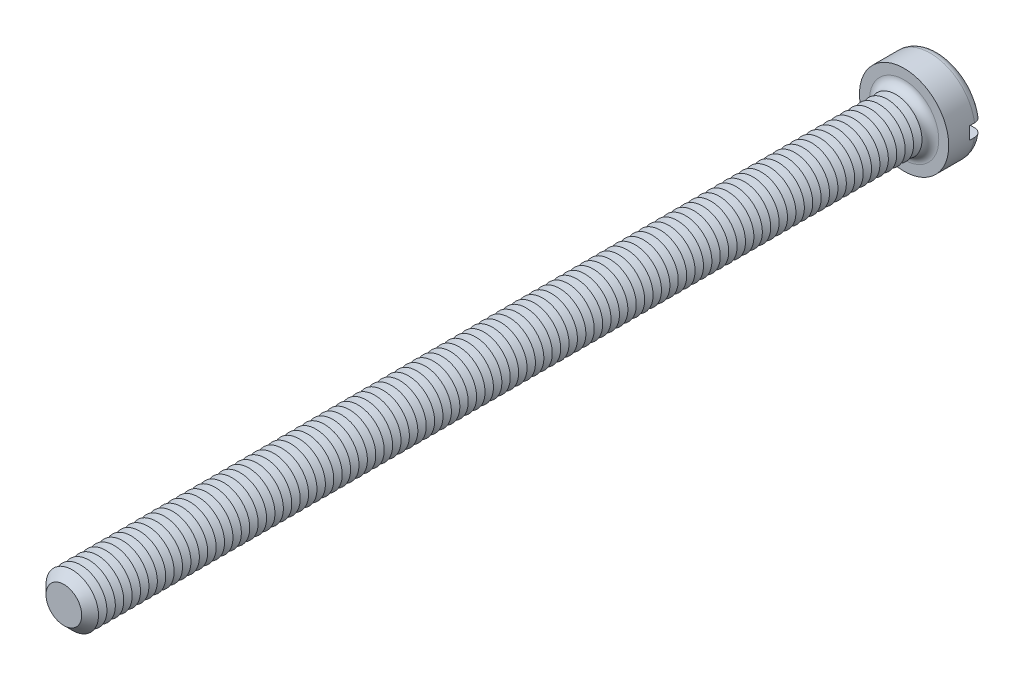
ISO-10303-21;
HEADER;
FILE_DESCRIPTION(('STEP AP214'),'2;1');
FILE_NAME('part.step','',(''),(''),'','','');
FILE_SCHEMA(('AUTOMOTIVE_DESIGN { 1 0 10303 214 1 1 1 1 }'));
ENDSEC;
DATA;
#1=APPLICATION_CONTEXT('core data for automotive mechanical design processes');
#2=APPLICATION_PROTOCOL_DEFINITION('international standard','automotive_design',2000,#1);
#3=PRODUCT_CONTEXT('',#1,'mechanical');
#4=PRODUCT('Part','Part','',(#3));
#5=PRODUCT_RELATED_PRODUCT_CATEGORY('part','',(#4));
#6=PRODUCT_DEFINITION_FORMATION('','',#4);
#7=PRODUCT_DEFINITION_CONTEXT('part definition',#1,'design');
#8=PRODUCT_DEFINITION('design','',#6,#7);
#9=PRODUCT_DEFINITION_SHAPE('','',#8);
#10=(LENGTH_UNIT() NAMED_UNIT(*) SI_UNIT(.MILLI.,.METRE.));
#11=(NAMED_UNIT(*) PLANE_ANGLE_UNIT() SI_UNIT($,.RADIAN.));
#12=(NAMED_UNIT(*) SI_UNIT($,.STERADIAN.) SOLID_ANGLE_UNIT());
#13=UNCERTAINTY_MEASURE_WITH_UNIT(LENGTH_MEASURE(1.E-05),#10,'distance_accuracy_value','');
#14=(GEOMETRIC_REPRESENTATION_CONTEXT(3) GLOBAL_UNCERTAINTY_ASSIGNED_CONTEXT((#13)) GLOBAL_UNIT_ASSIGNED_CONTEXT((#10,
#11,#12)) REPRESENTATION_CONTEXT('',''));
#15=CARTESIAN_POINT('',(0.,0.,0.));
#16=DIRECTION('',(0.,0.,1.));
#17=DIRECTION('',(1.,0.,0.));
#18=AXIS2_PLACEMENT_3D('',#15,#16,#17);
#19=CARTESIAN_POINT('',(0.,0.,-3.3));
#20=DIRECTION('',(0.,0.,1.));
#21=DIRECTION('',(1.,0.,0.));
#22=AXIS2_PLACEMENT_3D('',#19,#20,#21);
#23=PLANE('',#22);
#24=CARTESIAN_POINT('',(0.,0.,-3.3));
#25=DIRECTION('',(0.,0.,1.));
#26=DIRECTION('',(1.,0.,0.));
#27=AXIS2_PLACEMENT_3D('',#24,#25,#26);
#28=CIRCLE('',#27,3.45);
#29=CARTESIAN_POINT('',(-3.39742549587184,0.6,-3.3));
#30=VERTEX_POINT('',#29);
#31=CARTESIAN_POINT('',(3.39742549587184,0.6,-3.3));
#32=VERTEX_POINT('',#31);
#33=EDGE_CURVE('E116',#30,#32,#28,.F.);
#34=ORIENTED_EDGE('',*,*,#33,.T.);
#35=DIRECTION('',(1.,0.,0.));
#36=VECTOR('',#35,1.);
#37=CARTESIAN_POINT('',(-4.25,0.600000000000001,-3.3));
#38=LINE('',#37,#36);
#39=EDGE_CURVE('E111',#30,#32,#38,.T.);
#40=ORIENTED_EDGE('',*,*,#39,.F.);
#41=EDGE_LOOP('',(#34,#40));
#42=FACE_BOUND('',#41,.T.);
#43=ADVANCED_FACE('F39',(#42),#23,.F.);
#44=CARTESIAN_POINT('',(0.,0.,-2.5));
#45=DIRECTION('',(0.,0.,1.));
#46=DIRECTION('',(1.,0.,0.));
#47=AXIS2_PLACEMENT_3D('',#44,#45,#46);
#48=TOROIDAL_SURFACE('',#47,3.45,0.8);
#49=CARTESIAN_POINT('',(-4.06369072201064,0.600000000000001,-2.95537828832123));
#50=CARTESIAN_POINT('',(-4.03774340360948,0.600000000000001,-2.99245078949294));
#51=CARTESIAN_POINT('',(-4.00861849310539,0.600000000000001,-3.02734231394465));
#52=CARTESIAN_POINT('',(-3.94488199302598,0.600000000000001,-3.0917502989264));
#53=CARTESIAN_POINT('',(-3.91026320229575,0.600000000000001,-3.12125959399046));
#54=CARTESIAN_POINT('',(-3.83660561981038,0.600000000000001,-3.17403695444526));
#55=CARTESIAN_POINT('',(-3.79757117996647,0.6,-3.19731109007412));
#56=CARTESIAN_POINT('',(-3.71618817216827,0.6,-3.23703443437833));
#57=CARTESIAN_POINT('',(-3.67384041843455,0.6,-3.25348531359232));
#58=CARTESIAN_POINT('',(-3.58661930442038,0.6,-3.2792758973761));
#59=CARTESIAN_POINT('',(-3.54172669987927,0.6,-3.288550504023));
#60=CARTESIAN_POINT('',(-3.45102322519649,0.6,-3.29952632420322));
#61=CARTESIAN_POINT('',(-3.40521225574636,0.6,-3.30122671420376));
#62=CARTESIAN_POINT('',(-3.31340831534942,0.6,-3.29701196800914));
#63=CARTESIAN_POINT('',(-3.26741940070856,0.6,-3.29100823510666));
#64=CARTESIAN_POINT('',(-3.17708556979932,0.6,-3.27141469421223));
#65=CARTESIAN_POINT('',(-3.13274074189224,0.6,-3.25782447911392));
#66=CARTESIAN_POINT('',(-3.0466814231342,0.6,-3.22332549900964));
#67=CARTESIAN_POINT('',(-3.00498444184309,0.6,-3.20237301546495));
#68=CARTESIAN_POINT('',(-2.92572251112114,0.6,-3.15372961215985));
#69=CARTESIAN_POINT('',(-2.88815755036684,0.6,-3.12603871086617));
#70=CARTESIAN_POINT('',(-2.81847654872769,0.6,-3.06483322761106));
#71=CARTESIAN_POINT('',(-2.78633186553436,0.6,-3.03135128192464));
#72=CARTESIAN_POINT('',(-2.72824805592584,0.6,-2.95937651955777));
#73=CARTESIAN_POINT('',(-2.70230829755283,0.6,-2.92088421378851));
#74=CARTESIAN_POINT('',(-2.65791262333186,0.6,-2.84074227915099));
#75=CARTESIAN_POINT('',(-2.63932560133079,0.6,-2.79916531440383));
#76=CARTESIAN_POINT('',(-2.60958432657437,0.6,-2.7134333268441));
#77=CARTESIAN_POINT('',(-2.59842889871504,0.6,-2.66927871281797));
#78=CARTESIAN_POINT('',(-2.58411140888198,0.6,-2.58073966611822));
#79=CARTESIAN_POINT('',(-2.58077086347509,0.6,-2.5363840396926));
#80=CARTESIAN_POINT('',(-2.58167367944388,0.6,-2.44775208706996));
#81=CARTESIAN_POINT('',(-2.58591644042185,0.6,-2.40347575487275));
#82=CARTESIAN_POINT('',(-2.60175154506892,0.6,-2.31675105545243));
#83=CARTESIAN_POINT('',(-2.61326489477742,0.6,-2.27428821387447));
#84=CARTESIAN_POINT('',(-2.6431863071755,0.6,-2.19186794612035));
#85=CARTESIAN_POINT('',(-2.66159465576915,0.6,-2.15191062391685));
#86=CARTESIAN_POINT('',(-2.70494650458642,0.6,-2.07517696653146));
#87=CARTESIAN_POINT('',(-2.72995486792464,0.6,-2.03843731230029));
#88=CARTESIAN_POINT('',(-2.7856570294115,0.6,-1.96955746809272));
#89=CARTESIAN_POINT('',(-2.81635145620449,0.6,-1.93741778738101));
#90=CARTESIAN_POINT('',(-2.88329572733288,0.6,-1.87788048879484));
#91=CARTESIAN_POINT('',(-2.91965530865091,0.6,-1.85060625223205));
#92=CARTESIAN_POINT('',(-2.9963658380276,0.6,-1.80241044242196));
#93=CARTESIAN_POINT('',(-3.03671721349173,0.6,-1.78148955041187));
#94=CARTESIAN_POINT('',(-3.12111125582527,0.6,-1.74619829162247));
#95=CARTESIAN_POINT('',(-3.16521020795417,0.6,-1.73196239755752));
#96=CARTESIAN_POINT('',(-3.25516487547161,0.6,-1.71103773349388));
#97=CARTESIAN_POINT('',(-3.30102068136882,0.6,-1.70434935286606));
#98=CARTESIAN_POINT('',(-3.39352689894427,0.6,-1.69870104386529));
#99=CARTESIAN_POINT('',(-3.44018061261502,0.6,-1.69979487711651));
#100=CARTESIAN_POINT('',(-3.53263583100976,0.6,-1.70983959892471));
#101=CARTESIAN_POINT('',(-3.57843734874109,0.6,-1.71879036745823));
#102=CARTESIAN_POINT('',(-3.66763544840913,0.6,-1.74426972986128));
#103=CARTESIAN_POINT('',(-3.71104292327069,0.6,-1.76076015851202));
#104=CARTESIAN_POINT('',(-3.79442616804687,0.6,-1.80087686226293));
#105=CARTESIAN_POINT('',(-3.83440212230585,0.600000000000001,-1.82450275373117));
#106=CARTESIAN_POINT('',(-3.90929765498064,0.600000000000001,-1.87793548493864));
#107=CARTESIAN_POINT('',(-3.94426963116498,0.600000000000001,-1.90766887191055));
#108=CARTESIAN_POINT('',(-4.00864839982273,0.600000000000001,-1.9726503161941));
#109=CARTESIAN_POINT('',(-4.03805555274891,0.600000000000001,-2.00789801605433));
#110=CARTESIAN_POINT('',(-4.09009460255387,0.600000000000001,-2.08244463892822));
#111=CARTESIAN_POINT('',(-4.11280448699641,0.600000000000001,-2.12168912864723));
#112=CARTESIAN_POINT('',(-4.15124086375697,0.600000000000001,-2.2034588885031));
#113=CARTESIAN_POINT('',(-4.16696802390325,0.600000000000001,-2.24598384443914));
#114=CARTESIAN_POINT('',(-4.19085131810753,0.600000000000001,-2.33267862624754));
#115=CARTESIAN_POINT('',(-4.19907708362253,0.600000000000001,-2.37682928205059));
#116=CARTESIAN_POINT('',(-4.2079638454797,0.600000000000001,-2.46589754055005));
#117=CARTESIAN_POINT('',(-4.20862315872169,0.600000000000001,-2.51081531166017));
#118=CARTESIAN_POINT('',(-4.20236829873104,0.600000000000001,-2.59993343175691));
#119=CARTESIAN_POINT('',(-4.19548454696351,0.600000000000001,-2.64413593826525));
#120=CARTESIAN_POINT('',(-4.17439924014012,0.600000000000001,-2.73071930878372));
#121=CARTESIAN_POINT('',(-4.16020675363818,0.600000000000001,-2.77310235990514));
#122=CARTESIAN_POINT('',(-4.1318825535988,0.600000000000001,-2.83880495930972));
#123=CARTESIAN_POINT('',(-4.11991183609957,0.600000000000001,-2.86307959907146));
#124=CARTESIAN_POINT('',(-4.09356927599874,0.600000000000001,-2.91028856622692));
#125=CARTESIAN_POINT('',(-4.07919744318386,0.600000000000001,-2.9332228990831));
#126=CARTESIAN_POINT('',(-4.06369072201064,0.600000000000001,-2.95537828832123));
#127=B_SPLINE_CURVE_WITH_KNOTS('',3,(#49,#50,#51,#52,#53,#54,#55,#56,#57,#58,#59,#60,#61,#62,
#63,#64,#65,#66,#67,#68,#69,#70,#71,#72,#73,#74,#75,#76,#77,#78,#79,#80,#81,#82,#83,#84,#85,#86,
#87,#88,#89,#90,#91,#92,#93,#94,#95,#96,#97,#98,#99,#100,#101,#102,#103,#104,#105,#106,#107,
#108,#109,#110,#111,#112,#113,#114,#115,#116,#117,#118,#119,#120,#121,#122,#123,#124,#125,#126),
.UNSPECIFIED.,.T.,.F.,(4,2,2,2,2,2,2,2,2,2,2,2,2,2,2,2,2,2,2,2,2,2,2,2,2,2,2,2,2,2,2,2,2,2,2,2,
2,2,4),(0.,0.13565225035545,0.271483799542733,0.407182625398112,0.542848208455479,
0.679730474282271,0.816627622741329,0.955113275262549,1.09360635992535,1.23293614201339,
1.37226554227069,1.51083389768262,1.64938813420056,1.78534653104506,1.92128342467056,
2.0540840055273,2.18687407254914,2.31824564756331,2.44962267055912,2.58234229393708,
2.71507659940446,2.85080630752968,2.98655056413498,3.12491938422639,3.26329534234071,
3.40262816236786,3.54195885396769,3.68059194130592,3.81921757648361,3.95626453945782,
4.09330262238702,4.2286754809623,4.36403538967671,4.49812564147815,4.63224572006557,
4.76582687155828,4.89924267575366,4.98031194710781,5.0613808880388),.UNSPECIFIED.);
#128=CARTESIAN_POINT('',(-4.20743389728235,0.600000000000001,-2.50000000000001));
#129=VERTEX_POINT('',#128);
#130=EDGE_CURVE('E963',#129,#30,#127,.T.);
#131=ORIENTED_EDGE('',*,*,#130,.F.);
#132=CARTESIAN_POINT('',(0.,0.,-2.5));
#133=DIRECTION('',(0.,0.,1.));
#134=DIRECTION('',(1.,0.,0.));
#135=AXIS2_PLACEMENT_3D('',#132,#133,#134);
#136=CIRCLE('',#135,4.25);
#137=CARTESIAN_POINT('',(4.20743389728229,0.599999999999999,-2.5));
#138=VERTEX_POINT('',#137);
#139=EDGE_CURVE('E125',#138,#129,#136,.T.);
#140=ORIENTED_EDGE('',*,*,#139,.F.);
#141=CARTESIAN_POINT('',(2.63947327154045,0.6,-2.79608831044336));
#142=CARTESIAN_POINT('',(2.65655980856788,0.6,-2.83790320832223));
#143=CARTESIAN_POINT('',(2.67725642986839,0.6,-2.87828303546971));
#144=CARTESIAN_POINT('',(2.72519250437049,0.6,-2.95500233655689));
#145=CARTESIAN_POINT('',(2.75244152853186,0.6,-2.9913357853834));
#146=CARTESIAN_POINT('',(2.81257938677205,0.6,-3.05889430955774));
#147=CARTESIAN_POINT('',(2.84545995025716,0.6,-3.09012674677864));
#148=CARTESIAN_POINT('',(2.91591143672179,0.6,-3.14672620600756));
#149=CARTESIAN_POINT('',(2.95348119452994,0.6,-3.17209468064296));
#150=CARTESIAN_POINT('',(3.03291143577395,0.6,-3.21669611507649));
#151=CARTESIAN_POINT('',(3.07483186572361,0.6,-3.23582234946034));
#152=CARTESIAN_POINT('',(3.16126659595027,0.6,-3.26686062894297));
#153=CARTESIAN_POINT('',(3.2057811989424,0.6,-3.27877183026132));
#154=CARTESIAN_POINT('',(3.29669878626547,0.6,-3.29514603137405));
#155=CARTESIAN_POINT('',(3.34311773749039,0.6,-3.29952056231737));
#156=CARTESIAN_POINT('',(3.43603189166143,0.6,-3.30040472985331));
#157=CARTESIAN_POINT('',(3.48252709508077,0.6,-3.29691431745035));
#158=CARTESIAN_POINT('',(3.57420049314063,0.6,-3.28214240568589));
#159=CARTESIAN_POINT('',(3.61938038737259,0.6,-3.27087147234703));
#160=CARTESIAN_POINT('',(3.70717477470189,0.6,-3.24082890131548));
#161=CARTESIAN_POINT('',(3.74978938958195,0.6,-3.22205762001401));
#162=CARTESIAN_POINT('',(3.83078828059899,0.6,-3.17773607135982));
#163=CARTESIAN_POINT('',(3.86921015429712,0.599999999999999,-3.15225453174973));
#164=CARTESIAN_POINT('',(3.94116038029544,0.599999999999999,-3.09512672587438));
#165=CARTESIAN_POINT('',(3.9746890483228,0.599999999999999,-3.06348085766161));
#166=CARTESIAN_POINT('',(4.03545911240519,0.599999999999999,-2.99534640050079));
#167=CARTESIAN_POINT('',(4.06277344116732,0.599999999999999,-2.95892285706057));
#168=CARTESIAN_POINT('',(4.11082191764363,0.599999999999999,-2.88196698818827));
#169=CARTESIAN_POINT('',(4.13155647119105,0.599999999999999,-2.84143491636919));
#170=CARTESIAN_POINT('',(4.16563480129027,0.599999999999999,-2.75787550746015));
#171=CARTESIAN_POINT('',(4.1790544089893,0.599999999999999,-2.71487908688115));
#172=CARTESIAN_POINT('',(4.19843340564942,0.599999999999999,-2.62723691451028));
#173=CARTESIAN_POINT('',(4.20439310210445,0.599999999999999,-2.58259123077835));
#174=CARTESIAN_POINT('',(4.2086595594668,0.599999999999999,-2.49321831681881));
#175=CARTESIAN_POINT('',(4.20701422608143,0.599999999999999,-2.4484933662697));
#176=CARTESIAN_POINT('',(4.1962295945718,0.599999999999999,-2.35995704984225));
#177=CARTESIAN_POINT('',(4.18709040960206,0.599999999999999,-2.31614567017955));
#178=CARTESIAN_POINT('',(4.16160290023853,0.599999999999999,-2.23072100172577));
#179=CARTESIAN_POINT('',(4.14526169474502,0.599999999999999,-2.18910558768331));
#180=CARTESIAN_POINT('',(4.10585410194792,0.599999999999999,-2.10919238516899));
#181=CARTESIAN_POINT('',(4.08278762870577,0.599999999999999,-2.07089463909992));
#182=CARTESIAN_POINT('',(4.030487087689,0.599999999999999,-1.99851484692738));
#183=CARTESIAN_POINT('',(4.00122628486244,0.599999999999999,-1.9644521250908));
#184=CARTESIAN_POINT('',(3.93744772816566,0.599999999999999,-1.90166877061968));
#185=CARTESIAN_POINT('',(3.90292977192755,0.599999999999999,-1.87294834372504));
#186=CARTESIAN_POINT('',(3.82928727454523,0.599999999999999,-1.82137853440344));
#187=CARTESIAN_POINT('',(3.79012374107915,0.6,-1.79858484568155));
#188=CARTESIAN_POINT('',(3.70856025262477,0.6,-1.75980712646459));
#189=CARTESIAN_POINT('',(3.66616010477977,0.6,-1.74382350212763));
#190=CARTESIAN_POINT('',(3.57878495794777,0.6,-1.71891499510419));
#191=CARTESIAN_POINT('',(3.53378519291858,0.6,-1.71007699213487));
#192=CARTESIAN_POINT('',(3.44294322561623,0.6,-1.69998722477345));
#193=CARTESIAN_POINT('',(3.3971009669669,0.6,-1.69873596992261));
#194=CARTESIAN_POINT('',(3.30531297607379,0.6,-1.70385439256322));
#195=CARTESIAN_POINT('',(3.25937213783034,0.6,-1.71031204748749));
#196=CARTESIAN_POINT('',(3.1692099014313,0.6,-1.73080107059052));
#197=CARTESIAN_POINT('',(3.12498860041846,0.6,-1.74483286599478));
#198=CARTESIAN_POINT('',(3.03926209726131,0.6,-1.78018941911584));
#199=CARTESIAN_POINT('',(2.99777407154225,0.6,-1.80155586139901));
#200=CARTESIAN_POINT('',(2.91899881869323,0.6,-1.85098881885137));
#201=CARTESIAN_POINT('',(2.88171158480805,0.6,-1.8790553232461));
#202=CARTESIAN_POINT('',(2.81266124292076,0.6,-1.94094884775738));
#203=CARTESIAN_POINT('',(2.78086710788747,0.6,-1.97474122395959));
#204=CARTESIAN_POINT('',(2.72353615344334,0.6,-2.0472724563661));
#205=CARTESIAN_POINT('',(2.69799841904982,0.6,-2.08601058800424));
#206=CARTESIAN_POINT('',(2.65444718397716,0.6,-2.16655019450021));
#207=CARTESIAN_POINT('',(2.63629889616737,0.6,-2.20827875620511));
#208=CARTESIAN_POINT('',(2.60744942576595,0.6,-2.29424821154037));
#209=CARTESIAN_POINT('',(2.59674901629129,0.6,-2.33848936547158));
#210=CARTESIAN_POINT('',(2.5833312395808,0.6,-2.42714258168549));
#211=CARTESIAN_POINT('',(2.58043995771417,0.6,-2.47152848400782));
#212=CARTESIAN_POINT('',(2.58224493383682,0.6,-2.56010574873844));
#213=CARTESIAN_POINT('',(2.58693104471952,0.6,-2.60429729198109));
#214=CARTESIAN_POINT('',(2.60020046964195,0.6,-2.67311978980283));
#215=CARTESIAN_POINT('',(2.60635343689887,0.6,-2.69824441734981));
#216=CARTESIAN_POINT('',(2.62110140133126,0.6,-2.74776540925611));
#217=CARTESIAN_POINT('',(2.62969634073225,0.6,-2.77216179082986));
#218=CARTESIAN_POINT('',(2.63947327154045,0.6,-2.79608831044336));
#219=B_SPLINE_CURVE_WITH_KNOTS('',3,(#141,#142,#143,#144,#145,#146,#147,#148,#149,#150,#151,
#152,#153,#154,#155,#156,#157,#158,#159,#160,#161,#162,#163,#164,#165,#166,#167,#168,#169,#170,
#171,#172,#173,#174,#175,#176,#177,#178,#179,#180,#181,#182,#183,#184,#185,#186,#187,#188,#189,
#190,#191,#192,#193,#194,#195,#196,#197,#198,#199,#200,#201,#202,#203,#204,#205,#206,#207,#208,
#209,#210,#211,#212,#213,#214,#215,#216,#217,#218),.UNSPECIFIED.,.T.,.F.,(4,2,2,2,2,2,2,2,2,2,2,
2,2,2,2,2,2,2,2,2,2,2,2,2,2,2,2,2,2,2,2,2,2,2,2,2,2,2,4),(0.,0.135416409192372,
0.271031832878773,0.406449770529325,0.541834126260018,0.679424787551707,0.817031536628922,
0.956242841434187,1.09545501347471,1.23447850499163,1.37349539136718,1.51114036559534,
1.64877645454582,1.78470267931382,1.92062051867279,2.05510117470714,2.1895762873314,
2.32320547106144,2.45683263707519,2.59032801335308,2.72382509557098,2.85791055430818,
2.99200117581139,3.12730969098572,3.26262627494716,3.39956435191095,3.53651162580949,
3.67503685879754,3.81356990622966,3.95290367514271,4.09223721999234,4.23075602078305,
4.36925455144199,4.50509949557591,4.6409585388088,4.77376594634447,4.90639565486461,
4.98388287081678,5.06136825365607),.UNSPECIFIED.);
#220=EDGE_CURVE('E965',#32,#138,#219,.T.);
#221=ORIENTED_EDGE('',*,*,#220,.F.);
#222=ORIENTED_EDGE('',*,*,#33,.F.);
#223=EDGE_LOOP('',(#131,#140,#221,#222));
#224=FACE_BOUND('',#223,.T.);
#225=ADVANCED_FACE('F947',(#224),#48,.T.);
#226=CARTESIAN_POINT('',(0.,0.,-3.3));
#227=DIRECTION('',(0.,0.,1.));
#228=DIRECTION('',(1.,0.,0.));
#229=AXIS2_PLACEMENT_3D('',#226,#227,#228);
#230=CYLINDRICAL_SURFACE('',#229,4.25);
#231=DIRECTION('',(0.,0.,1.));
#232=VECTOR('',#231,1.);
#233=CARTESIAN_POINT('',(4.20743389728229,0.599999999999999,-3.3));
#234=LINE('',#233,#232);
#235=CARTESIAN_POINT('',(4.20743389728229,0.599999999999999,-2.));
#236=VERTEX_POINT('',#235);
#237=EDGE_CURVE('E981',#138,#236,#234,.T.);
#238=ORIENTED_EDGE('',*,*,#237,.F.);
#239=ORIENTED_EDGE('',*,*,#139,.T.);
#240=DIRECTION('',(0.,0.,1.));
#241=VECTOR('',#240,1.);
#242=CARTESIAN_POINT('',(-4.20743389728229,0.600000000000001,-3.3));
#243=LINE('',#242,#241);
#244=CARTESIAN_POINT('',(-4.20743389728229,0.600000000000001,-2.));
#245=VERTEX_POINT('',#244);
#246=EDGE_CURVE('E63',#245,#129,#243,.F.);
#247=ORIENTED_EDGE('',*,*,#246,.F.);
#248=CARTESIAN_POINT('',(0.,0.,-2.));
#249=DIRECTION('',(0.,0.,-1.));
#250=DIRECTION('',(-1.,0.,0.));
#251=AXIS2_PLACEMENT_3D('',#248,#249,#250);
#252=CIRCLE('',#251,4.25);
#253=CARTESIAN_POINT('',(-4.20743389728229,-0.599999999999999,-2.));
#254=VERTEX_POINT('',#253);
#255=EDGE_CURVE('E43',#245,#254,#252,.F.);
#256=ORIENTED_EDGE('',*,*,#255,.T.);
#257=DIRECTION('',(0.,0.,1.));
#258=VECTOR('',#257,1.);
#259=CARTESIAN_POINT('',(-4.20743389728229,-0.599999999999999,-3.3));
#260=LINE('',#259,#258);
#261=CARTESIAN_POINT('',(-4.20743389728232,-0.599999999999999,-2.5));
#262=VERTEX_POINT('',#261);
#263=EDGE_CURVE('E978',#262,#254,#260,.T.);
#264=ORIENTED_EDGE('',*,*,#263,.F.);
#265=CARTESIAN_POINT('',(4.20743389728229,-0.600000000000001,-2.5));
#266=VERTEX_POINT('',#265);
#267=EDGE_CURVE('E127',#262,#266,#136,.T.);
#268=ORIENTED_EDGE('',*,*,#267,.T.);
#269=DIRECTION('',(0.,0.,1.));
#270=VECTOR('',#269,1.);
#271=CARTESIAN_POINT('',(4.20743389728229,-0.600000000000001,-3.3));
#272=LINE('',#271,#270);
#273=CARTESIAN_POINT('',(4.20743389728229,-0.600000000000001,-2.));
#274=VERTEX_POINT('',#273);
#275=EDGE_CURVE('E55',#274,#266,#272,.F.);
#276=ORIENTED_EDGE('',*,*,#275,.F.);
#277=EDGE_CURVE('E11',#274,#236,#252,.F.);
#278=ORIENTED_EDGE('',*,*,#277,.T.);
#279=EDGE_LOOP('',(#238,#239,#247,#256,#264,#268,#276,#278));
#280=FACE_BOUND('',#279,.T.);
#281=CARTESIAN_POINT('',(0.,0.,0.));
#282=DIRECTION('',(0.,0.,1.));
#283=DIRECTION('',(1.,0.,0.));
#284=AXIS2_PLACEMENT_3D('',#281,#282,#283);
#285=CIRCLE('',#284,4.25);
#286=CARTESIAN_POINT('',(4.25,0.,0.));
#287=VERTEX_POINT('',#286);
#288=EDGE_CURVE('E984',#287,#287,#285,.T.);
#289=ORIENTED_EDGE('',*,*,#288,.F.);
#290=EDGE_LOOP('',(#289));
#291=FACE_BOUND('',#290,.T.);
#292=ADVANCED_FACE('F943',(#280,#291),#230,.T.);
#293=CARTESIAN_POINT('',(3.39742549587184,-0.6,-3.3));
#294=VERTEX_POINT('',#293);
#295=CARTESIAN_POINT('',(-3.39742549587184,-0.6,-3.3));
#296=VERTEX_POINT('',#295);
#297=EDGE_CURVE('E109',#294,#296,#28,.F.);
#298=ORIENTED_EDGE('',*,*,#297,.T.);
#299=DIRECTION('',(-1.,0.,0.));
#300=VECTOR('',#299,1.);
#301=CARTESIAN_POINT('',(-4.25,-0.599999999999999,-3.3));
#302=LINE('',#301,#300);
#303=EDGE_CURVE('E96',#294,#296,#302,.T.);
#304=ORIENTED_EDGE('',*,*,#303,.F.);
#305=EDGE_LOOP('',(#298,#304));
#306=FACE_BOUND('',#305,.T.);
#307=ADVANCED_FACE('F108',(#306),#23,.F.);
#308=CARTESIAN_POINT('',(0.,0.,0.));
#309=DIRECTION('',(0.,0.,1.));
#310=DIRECTION('',(1.,0.,0.));
#311=AXIS2_PLACEMENT_3D('',#308,#309,#310);
#312=PLANE('',#311);
#313=CARTESIAN_POINT('',(0.,0.,0.));
#314=DIRECTION('',(0.,0.,1.));
#315=DIRECTION('',(1.,0.,0.));
#316=AXIS2_PLACEMENT_3D('',#313,#314,#315);
#317=CIRCLE('',#316,3.3);
#318=CARTESIAN_POINT('',(3.3,0.,0.));
#319=VERTEX_POINT('',#318);
#320=EDGE_CURVE('E115',#319,#319,#317,.F.);
#321=ORIENTED_EDGE('',*,*,#320,.T.);
#322=EDGE_LOOP('',(#321));
#323=FACE_BOUND('',#322,.T.);
#324=ORIENTED_EDGE('',*,*,#288,.T.);
#325=EDGE_LOOP('',(#324));
#326=FACE_BOUND('',#325,.T.);
#327=ADVANCED_FACE('F942',(#323,#326),#312,.T.);
#328=CARTESIAN_POINT('',(-4.06369072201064,-0.599999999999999,-2.95537828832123));
#329=CARTESIAN_POINT('',(-4.08928577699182,-0.599999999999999,-2.91880204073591));
#330=CARTESIAN_POINT('',(-4.11182555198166,-0.599999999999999,-2.88005030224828));
#331=CARTESIAN_POINT('',(-4.15010404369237,-0.599999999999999,-2.79928452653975));
#332=CARTESIAN_POINT('',(-4.16583526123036,-0.599999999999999,-2.75726695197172));
#333=CARTESIAN_POINT('',(-4.19000286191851,-0.599999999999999,-2.67118996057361));
#334=CARTESIAN_POINT('',(-4.19844101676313,-0.599999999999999,-2.62713104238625));
#335=CARTESIAN_POINT('',(-4.20777174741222,-0.599999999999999,-2.53823222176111));
#336=CARTESIAN_POINT('',(-4.20866608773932,-0.599999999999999,-2.49339250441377));
#337=CARTESIAN_POINT('',(-4.20289683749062,-0.599999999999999,-2.40433856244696));
#338=CARTESIAN_POINT('',(-4.19625607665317,-0.599999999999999,-2.36012285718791));
#339=CARTESIAN_POINT('',(-4.17565084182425,-0.599999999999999,-2.27343166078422));
#340=CARTESIAN_POINT('',(-4.16168615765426,-0.599999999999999,-2.23095621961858));
#341=CARTESIAN_POINT('',(-4.12683188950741,-0.599999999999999,-2.14890863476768));
#342=CARTESIAN_POINT('',(-4.10593663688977,-0.599999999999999,-2.10933890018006));
#343=CARTESIAN_POINT('',(-4.05783763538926,-0.599999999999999,-2.03424145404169));
#344=CARTESIAN_POINT('',(-4.03063375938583,-0.599999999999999,-1.99871382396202));
#345=CARTESIAN_POINT('',(-3.97052236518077,-0.599999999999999,-1.93246905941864));
#346=CARTESIAN_POINT('',(-3.93758114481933,-0.599999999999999,-1.90178251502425));
#347=CARTESIAN_POINT('',(-3.86706007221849,-0.599999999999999,-1.84630837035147));
#348=CARTESIAN_POINT('',(-3.82948001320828,-0.6,-1.82152103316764));
#349=CARTESIAN_POINT('',(-3.75033766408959,-0.6,-1.77826995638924));
#350=CARTESIAN_POINT('',(-3.70873831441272,-0.6,-1.7598740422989));
#351=CARTESIAN_POINT('',(-3.62306661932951,-0.6,-1.73023196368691));
#352=CARTESIAN_POINT('',(-3.57899411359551,-0.6,-1.71898626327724));
#353=CARTESIAN_POINT('',(-3.48904845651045,-0.6,-1.70382025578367));
#354=CARTESIAN_POINT('',(-3.44315982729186,-0.6,-1.69999172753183));
#355=CARTESIAN_POINT('',(-3.35138360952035,-0.6,-1.7000083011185));
#356=CARTESIAN_POINT('',(-3.30549602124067,-0.6,-1.70385391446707));
#357=CARTESIAN_POINT('',(-3.21452492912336,-0.6,-1.71917227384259));
#358=CARTESIAN_POINT('',(-3.16945455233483,-0.6,-1.73072307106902));
#359=CARTESIAN_POINT('',(-3.08188104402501,-0.6,-1.76120640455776));
#360=CARTESIAN_POINT('',(-3.0393780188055,-0.6,-1.78013924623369));
#361=CARTESIAN_POINT('',(-2.95805296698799,-0.6,-1.82493384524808));
#362=CARTESIAN_POINT('',(-2.9192403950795,-0.6,-1.85081278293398));
#363=CARTESIAN_POINT('',(-2.84656695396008,-0.6,-1.90878317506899));
#364=CARTESIAN_POINT('',(-2.81270591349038,-0.6,-1.94087441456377));
#365=CARTESIAN_POINT('',(-2.75131050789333,-0.6,-2.01002500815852));
#366=CARTESIAN_POINT('',(-2.72371339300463,-0.6,-2.04702860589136));
#367=CARTESIAN_POINT('',(-2.67528742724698,-0.6,-2.12522869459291));
#368=CARTESIAN_POINT('',(-2.65445765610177,-0.6,-2.1664246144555));
#369=CARTESIAN_POINT('',(-2.62065354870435,-0.6,-2.25087266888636));
#370=CARTESIAN_POINT('',(-2.60751663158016,-0.6,-2.29405971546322));
#371=CARTESIAN_POINT('',(-2.58885106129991,-0.6,-2.38204659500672));
#372=CARTESIAN_POINT('',(-2.58332131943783,-0.6,-2.42684619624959));
#373=CARTESIAN_POINT('',(-2.58009777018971,-0.6,-2.51580379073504));
#374=CARTESIAN_POINT('',(-2.58224575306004,-0.6,-2.55995612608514));
#375=CARTESIAN_POINT('',(-2.59395205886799,-0.6,-2.64726495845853));
#376=CARTESIAN_POINT('',(-2.60351013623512,-0.6,-2.69042148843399));
#377=CARTESIAN_POINT('',(-2.62967159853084,-0.6,-2.77438771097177));
#378=CARTESIAN_POINT('',(-2.64625243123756,-0.6,-2.81520444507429));
#379=CARTESIAN_POINT('',(-2.68592348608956,-0.6,-2.89353901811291));
#380=CARTESIAN_POINT('',(-2.70901418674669,-0.6,-2.9310566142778));
#381=CARTESIAN_POINT('',(-2.7614318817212,-0.6,-3.00240040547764));
#382=CARTESIAN_POINT('',(-2.79085487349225,-0.6,-3.03615603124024));
#383=CARTESIAN_POINT('',(-2.85483456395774,-0.6,-3.09838834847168));
#384=CARTESIAN_POINT('',(-2.88939187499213,-0.6,-3.12686440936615));
#385=CARTESIAN_POINT('',(-2.96351967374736,-0.6,-3.17841283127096));
#386=CARTESIAN_POINT('',(-3.00318741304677,-0.6,-3.20134539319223));
#387=CARTESIAN_POINT('',(-3.08576649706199,-0.6,-3.24034364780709));
#388=CARTESIAN_POINT('',(-3.12867814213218,-0.6,-3.25640870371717));
#389=CARTESIAN_POINT('',(-3.21724048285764,-0.6,-3.28143816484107));
#390=CARTESIAN_POINT('',(-3.26292314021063,-0.6,-3.29028963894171));
#391=CARTESIAN_POINT('',(-3.35512527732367,-0.6,-3.30021681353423));
#392=CARTESIAN_POINT('',(-3.40164474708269,-0.6,-3.30129260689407));
#393=CARTESIAN_POINT('',(-3.49429978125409,-0.6,-3.29560589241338));
#394=CARTESIAN_POINT('',(-3.54043436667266,-0.6,-3.28882735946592));
#395=CARTESIAN_POINT('',(-3.63090382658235,-0.6,-3.26755492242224));
#396=CARTESIAN_POINT('',(-3.67523831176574,-0.6,-3.25305935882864));
#397=CARTESIAN_POINT('',(-3.76046509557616,-0.6,-3.21686867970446));
#398=CARTESIAN_POINT('',(-3.80138087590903,-0.599999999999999,-3.1952288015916));
#399=CARTESIAN_POINT('',(-3.8788986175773,-0.599999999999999,-3.14531817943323));
#400=CARTESIAN_POINT('',(-3.91550599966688,-0.599999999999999,-3.11705590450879));
#401=CARTESIAN_POINT('',(-3.97074313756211,-0.599999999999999,-3.06628809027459));
#402=CARTESIAN_POINT('',(-3.99100743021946,-0.599999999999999,-3.04553102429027));
#403=CARTESIAN_POINT('',(-4.02917385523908,-0.599999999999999,-3.00194762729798));
#404=CARTESIAN_POINT('',(-4.04707600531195,-0.599999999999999,-2.97912131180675));
#405=CARTESIAN_POINT('',(-4.06369072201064,-0.599999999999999,-2.95537828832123));
#406=B_SPLINE_CURVE_WITH_KNOTS('',3,(#328,#329,#330,#331,#332,#333,#334,#335,#336,#337,#338,
#339,#340,#341,#342,#343,#344,#345,#346,#347,#348,#349,#350,#351,#352,#353,#354,#355,#356,#357,
#358,#359,#360,#361,#362,#363,#364,#365,#366,#367,#368,#369,#370,#371,#372,#373,#374,#375,#376,
#377,#378,#379,#380,#381,#382,#383,#384,#385,#386,#387,#388,#389,#390,#391,#392,#393,#394,#395,
#396,#397,#398,#399,#400,#401,#402,#403,#404,#405),.UNSPECIFIED.,.T.,.F.,(4,2,2,2,2,2,2,2,2,2,2,
2,2,2,2,2,2,2,2,2,2,2,2,2,2,2,2,2,2,2,2,2,2,2,2,2,2,2,4),(0.,0.133821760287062,
0.267790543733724,0.401726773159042,0.535631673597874,0.669131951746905,0.802636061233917,
0.936249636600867,1.06986590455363,1.2042952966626,1.3387306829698,1.47455198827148,
1.61038210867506,1.74788249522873,1.88539204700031,2.02431612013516,2.16324594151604,
2.30252260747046,2.4417944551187,2.57960263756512,2.71739207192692,2.85215325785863,
2.98689515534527,3.11887666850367,3.25085380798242,3.38241030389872,3.51397647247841,
3.64769871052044,3.78143690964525,3.91826005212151,4.05509587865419,4.19403485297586,
4.33297216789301,4.47219345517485,4.61144469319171,4.74964356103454,4.887666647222,
4.97453605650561,5.06140481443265),.UNSPECIFIED.);
#407=EDGE_CURVE('E103',#296,#262,#406,.T.);
#408=ORIENTED_EDGE('',*,*,#407,.F.);
#409=ORIENTED_EDGE('',*,*,#297,.F.);
#410=CARTESIAN_POINT('',(2.63947327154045,-0.6,-2.79608831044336));
#411=CARTESIAN_POINT('',(2.62285766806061,-0.6,-2.75541510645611));
#412=CARTESIAN_POINT('',(2.60963282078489,-0.6,-2.71332585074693));
#413=CARTESIAN_POINT('',(2.59042394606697,-0.6,-2.62749460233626));
#414=CARTESIAN_POINT('',(2.58444686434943,-0.6,-2.58375106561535));
#415=CARTESIAN_POINT('',(2.57995287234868,-0.6,-2.49588524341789));
#416=CARTESIAN_POINT('',(2.58143477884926,-0.6,-2.45176301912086));
#417=CARTESIAN_POINT('',(2.59180622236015,-0.6,-2.36440906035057));
#418=CARTESIAN_POINT('',(2.60069434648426,-0.6,-2.32117715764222));
#419=CARTESIAN_POINT('',(2.62554964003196,-0.6,-2.23689909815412));
#420=CARTESIAN_POINT('',(2.6415022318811,-0.6,-2.19584863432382));
#421=CARTESIAN_POINT('',(2.67996913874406,-0.6,-2.11694797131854));
#422=CARTESIAN_POINT('',(2.70248409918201,-0.6,-2.07909808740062));
#423=CARTESIAN_POINT('',(2.75378972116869,-0.6,-2.00702296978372));
#424=CARTESIAN_POINT('',(2.7826732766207,-0.6,-1.97286389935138));
#425=CARTESIAN_POINT('',(2.84564717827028,-0.6,-1.90974167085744));
#426=CARTESIAN_POINT('',(2.87973812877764,-0.6,-1.88077911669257));
#427=CARTESIAN_POINT('',(2.95300941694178,-0.6,-1.82817307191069));
#428=CARTESIAN_POINT('',(2.99228920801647,-0.6,-1.8046680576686));
#429=CARTESIAN_POINT('',(3.07419050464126,-0.6,-1.76446470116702));
#430=CARTESIAN_POINT('',(3.11681231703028,-0.6,-1.74776698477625));
#431=CARTESIAN_POINT('',(3.20492149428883,-0.6,-1.72140945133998));
#432=CARTESIAN_POINT('',(3.25044365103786,-0.6,-1.71186578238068));
#433=CARTESIAN_POINT('',(3.34244451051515,-0.6,-1.70053183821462));
#434=CARTESIAN_POINT('',(3.38892324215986,-0.6,-1.69874179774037));
#435=CARTESIAN_POINT('',(3.48165030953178,-0.6,-1.70299737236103));
#436=CARTESIAN_POINT('',(3.52789766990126,-0.6,-1.70906439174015));
#437=CARTESIAN_POINT('',(3.61869999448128,-0.6,-1.72893768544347));
#438=CARTESIAN_POINT('',(3.6632550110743,-0.6,-1.742743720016));
#439=CARTESIAN_POINT('',(3.7490339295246,-0.6,-1.77760539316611));
#440=CARTESIAN_POINT('',(3.79028083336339,-0.600000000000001,-1.79860440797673));
#441=CARTESIAN_POINT('',(3.86860401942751,-0.600000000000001,-1.84731105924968));
#442=CARTESIAN_POINT('',(3.90568056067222,-0.600000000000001,-1.87501827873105));
#443=CARTESIAN_POINT('',(3.97412845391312,-0.600000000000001,-1.93599408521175));
#444=CARTESIAN_POINT('',(4.00556369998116,-0.600000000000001,-1.96919094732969));
#445=CARTESIAN_POINT('',(4.06233546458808,-0.600000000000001,-2.0404445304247));
#446=CARTESIAN_POINT('',(4.08767237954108,-0.600000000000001,-2.07850093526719));
#447=CARTESIAN_POINT('',(4.13122502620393,-0.600000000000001,-2.15791791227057));
#448=CARTESIAN_POINT('',(4.14951966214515,-0.600000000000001,-2.19923522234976));
#449=CARTESIAN_POINT('',(4.17884974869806,-0.600000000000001,-2.28437065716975));
#450=CARTESIAN_POINT('',(4.18988555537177,-0.600000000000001,-2.32818865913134));
#451=CARTESIAN_POINT('',(4.20430724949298,-0.600000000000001,-2.41670951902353));
#452=CARTESIAN_POINT('',(4.2077528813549,-0.600000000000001,-2.46140265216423));
#453=CARTESIAN_POINT('',(4.20706844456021,-0.600000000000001,-2.55073028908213));
#454=CARTESIAN_POINT('',(4.20293856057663,-0.600000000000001,-2.595364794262));
#455=CARTESIAN_POINT('',(4.18724926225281,-0.600000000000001,-2.68317733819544));
#456=CARTESIAN_POINT('',(4.17571081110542,-0.600000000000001,-2.72635912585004));
#457=CARTESIAN_POINT('',(4.14556645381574,-0.600000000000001,-2.81017999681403));
#458=CARTESIAN_POINT('',(4.12696052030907,-0.600000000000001,-2.85081907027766));
#459=CARTESIAN_POINT('',(4.08317014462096,-0.600000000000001,-2.92852328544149));
#460=CARTESIAN_POINT('',(4.0579684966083,-0.600000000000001,-2.96557872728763));
#461=CARTESIAN_POINT('',(4.00174565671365,-0.600000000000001,-3.034972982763));
#462=CARTESIAN_POINT('',(3.97072429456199,-0.600000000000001,-3.06731165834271));
#463=CARTESIAN_POINT('',(3.90349659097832,-0.600000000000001,-3.12662735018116));
#464=CARTESIAN_POINT('',(3.86725240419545,-0.600000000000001,-3.15356146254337));
#465=CARTESIAN_POINT('',(3.79079809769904,-0.600000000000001,-3.20104156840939));
#466=CARTESIAN_POINT('',(3.75058775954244,-0.6,-3.22158720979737));
#467=CARTESIAN_POINT('',(3.6668595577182,-0.6,-3.25595832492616));
#468=CARTESIAN_POINT('',(3.62330947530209,-0.6,-3.26970530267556));
#469=CARTESIAN_POINT('',(3.53453348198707,-0.6,-3.28979004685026));
#470=CARTESIAN_POINT('',(3.48930745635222,-0.6,-3.29612730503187));
#471=CARTESIAN_POINT('',(3.39787506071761,-0.6,-3.30128612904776));
#472=CARTESIAN_POINT('',(3.35166346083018,-0.6,-3.30001513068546));
#473=CARTESIAN_POINT('',(3.26009663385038,-0.6,-3.28980210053));
#474=CARTESIAN_POINT('',(3.21474142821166,-0.6,-3.28085987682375));
#475=CARTESIAN_POINT('',(3.12577990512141,-0.6,-3.2554540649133));
#476=CARTESIAN_POINT('',(3.08219120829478,-0.6,-3.23892872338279));
#477=CARTESIAN_POINT('',(2.99839730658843,-0.6,-3.1987810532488));
#478=CARTESIAN_POINT('',(2.95819301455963,-0.6,-3.17515681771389));
#479=CARTESIAN_POINT('',(2.88239372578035,-0.6,-3.12147666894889));
#480=CARTESIAN_POINT('',(2.84679445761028,-0.6,-3.09142678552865));
#481=CARTESIAN_POINT('',(2.78127483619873,-0.6,-3.02571584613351));
#482=CARTESIAN_POINT('',(2.75134725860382,-0.6,-2.99006203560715));
#483=CARTESIAN_POINT('',(2.70767232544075,-0.6,-2.92780516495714));
#484=CARTESIAN_POINT('',(2.69197340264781,-0.6,-2.90254809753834));
#485=CARTESIAN_POINT('',(2.66349078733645,-0.6,-2.8504392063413));
#486=CARTESIAN_POINT('',(2.65070705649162,-0.6,-2.82358740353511));
#487=CARTESIAN_POINT('',(2.63947327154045,-0.6,-2.79608831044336));
#488=B_SPLINE_CURVE_WITH_KNOTS('',3,(#410,#411,#412,#413,#414,#415,#416,#417,#418,#419,#420,
#421,#422,#423,#424,#425,#426,#427,#428,#429,#430,#431,#432,#433,#434,#435,#436,#437,#438,#439,
#440,#441,#442,#443,#444,#445,#446,#447,#448,#449,#450,#451,#452,#453,#454,#455,#456,#457,#458,
#459,#460,#461,#462,#463,#464,#465,#466,#467,#468,#469,#470,#471,#472,#473,#474,#475,#476,#477,
#478,#479,#480,#481,#482,#483,#484,#485,#486,#487),.UNSPECIFIED.,.T.,.F.,(4,2,2,2,2,2,2,2,2,2,2,
2,2,2,2,2,2,2,2,2,2,2,2,2,2,2,2,2,2,2,2,2,2,2,2,2,2,2,4),(0.,0.131701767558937,
0.263529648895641,0.395336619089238,0.527118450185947,0.658629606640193,0.790153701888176,
0.923740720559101,1.05734325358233,1.19403504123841,1.33073939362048,1.46961778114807,
1.60850037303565,1.74776210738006,1.88701952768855,2.02520497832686,2.16338184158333,
2.29987843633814,2.43636615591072,2.57127672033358,2.7061806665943,2.84001889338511,
2.97385385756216,3.1073117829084,3.24077022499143,3.37458034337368,3.50839437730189,
3.64323196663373,3.77807698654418,3.91444452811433,4.05082142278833,4.18886086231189,
4.32690375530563,4.46609131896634,4.60531630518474,4.74441121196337,4.88332773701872,
4.97237227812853,5.06141564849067),.UNSPECIFIED.);
#489=EDGE_CURVE('E92',#266,#294,#488,.T.);
#490=ORIENTED_EDGE('',*,*,#489,.F.);
#491=ORIENTED_EDGE('',*,*,#267,.F.);
#492=EDGE_LOOP('',(#408,#409,#490,#491));
#493=FACE_BOUND('',#492,.T.);
#494=ADVANCED_FACE('F113',(#493),#48,.T.);
#495=CARTESIAN_POINT('',(0.,0.,0.799999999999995));
#496=DIRECTION('',(0.,0.,1.));
#497=DIRECTION('',(1.,0.,0.));
#498=AXIS2_PLACEMENT_3D('',#495,#496,#497);
#499=TOROIDAL_SURFACE('',#498,3.3,0.8);
#500=ORIENTED_EDGE('',*,*,#320,.F.);
#501=EDGE_LOOP('',(#500));
#502=FACE_BOUND('',#501,.T.);
#503=CARTESIAN_POINT('',(0.,0.,0.799999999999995));
#504=DIRECTION('',(0.,0.,-1.));
#505=DIRECTION('',(-1.,0.,0.));
#506=AXIS2_PLACEMENT_3D('',#503,#504,#505);
#507=CIRCLE('',#506,2.5);
#508=CARTESIAN_POINT('',(-2.5,0.,0.799999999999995));
#509=VERTEX_POINT('',#508);
#510=EDGE_CURVE('E989',#509,#509,#507,.T.);
#511=ORIENTED_EDGE('',*,*,#510,.T.);
#512=EDGE_LOOP('',(#511));
#513=FACE_BOUND('',#512,.T.);
#514=ADVANCED_FACE('F935',(#502,#513),#499,.F.);
#515=CARTESIAN_POINT('',(0.,0.,1.2));
#516=DIRECTION('',(0.,0.,-1.));
#517=DIRECTION('',(-1.,0.,0.));
#518=AXIS2_PLACEMENT_3D('',#515,#516,#517);
#519=CONICAL_SURFACE('',#518,1.80717967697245,1.0471975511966);
#520=ORIENTED_EDGE('',*,*,#510,.F.);
#521=EDGE_LOOP('',(#520));
#522=FACE_BOUND('',#521,.T.);
#523=CARTESIAN_POINT('',(0.,0.,1.2));
#524=DIRECTION('',(0.,0.,-1.));
#525=DIRECTION('',(-1.,0.,0.));
#526=AXIS2_PLACEMENT_3D('',#523,#524,#525);
#527=CIRCLE('',#526,1.80717967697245);
#528=CARTESIAN_POINT('',(-1.80717967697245,0.,1.2));
#529=VERTEX_POINT('',#528);
#530=EDGE_CURVE('E995',#529,#529,#527,.T.);
#531=ORIENTED_EDGE('',*,*,#530,.T.);
#532=EDGE_LOOP('',(#531));
#533=FACE_BOUND('',#532,.T.);
#534=ADVANCED_FACE('F931',(#522,#533),#519,.T.);
#535=CARTESIAN_POINT('',(0.,0.,1.59999999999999));
#536=DIRECTION('',(0.,0.,1.));
#537=DIRECTION('',(1.,0.,0.));
#538=AXIS2_PLACEMENT_3D('',#535,#536,#537);
#539=CONICAL_SURFACE('',#538,2.5,1.0471975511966);
#540=ORIENTED_EDGE('',*,*,#530,.F.);
#541=EDGE_LOOP('',(#540));
#542=FACE_BOUND('',#541,.T.);
#543=CARTESIAN_POINT('',(0.,0.,1.59999999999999));
#544=DIRECTION('',(0.,0.,-1.));
#545=DIRECTION('',(-1.,0.,0.));
#546=AXIS2_PLACEMENT_3D('',#543,#544,#545);
#547=CIRCLE('',#546,2.5);
#548=CARTESIAN_POINT('',(-2.5,0.,1.59999999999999));
#549=VERTEX_POINT('',#548);
#550=EDGE_CURVE('E1001',#549,#549,#547,.T.);
#551=ORIENTED_EDGE('',*,*,#550,.T.);
#552=EDGE_LOOP('',(#551));
#553=FACE_BOUND('',#552,.T.);
#554=ADVANCED_FACE('F927',(#542,#553),#539,.T.);
#555=CARTESIAN_POINT('',(0.,0.,2.));
#556=DIRECTION('',(0.,0.,-1.));
#557=DIRECTION('',(-1.,0.,0.));
#558=AXIS2_PLACEMENT_3D('',#555,#556,#557);
#559=CONICAL_SURFACE('',#558,1.80717967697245,1.0471975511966);
#560=ORIENTED_EDGE('',*,*,#550,.F.);
#561=EDGE_LOOP('',(#560));
#562=FACE_BOUND('',#561,.T.);
#563=CARTESIAN_POINT('',(0.,0.,2.));
#564=DIRECTION('',(0.,0.,-1.));
#565=DIRECTION('',(-1.,0.,0.));
#566=AXIS2_PLACEMENT_3D('',#563,#564,#565);
#567=CIRCLE('',#566,1.80717967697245);
#568=CARTESIAN_POINT('',(-1.80717967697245,0.,2.));
#569=VERTEX_POINT('',#568);
#570=EDGE_CURVE('E1005',#569,#569,#567,.T.);
#571=ORIENTED_EDGE('',*,*,#570,.T.);
#572=EDGE_LOOP('',(#571));
#573=FACE_BOUND('',#572,.T.);
#574=ADVANCED_FACE('F923',(#562,#573),#559,.T.);
#575=CARTESIAN_POINT('',(0.,0.,2.4));
#576=DIRECTION('',(0.,0.,1.));
#577=DIRECTION('',(1.,0.,0.));
#578=AXIS2_PLACEMENT_3D('',#575,#576,#577);
#579=CONICAL_SURFACE('',#578,2.5,1.0471975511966);
#580=ORIENTED_EDGE('',*,*,#570,.F.);
#581=EDGE_LOOP('',(#580));
#582=FACE_BOUND('',#581,.T.);
#583=CARTESIAN_POINT('',(0.,0.,2.4));
#584=DIRECTION('',(0.,0.,-1.));
#585=DIRECTION('',(-1.,0.,0.));
#586=AXIS2_PLACEMENT_3D('',#583,#584,#585);
#587=CIRCLE('',#586,2.5);
#588=CARTESIAN_POINT('',(-2.5,0.,2.4));
#589=VERTEX_POINT('',#588);
#590=EDGE_CURVE('E1008',#589,#589,#587,.T.);
#591=ORIENTED_EDGE('',*,*,#590,.T.);
#592=EDGE_LOOP('',(#591));
#593=FACE_BOUND('',#592,.T.);
#594=ADVANCED_FACE('F919',(#582,#593),#579,.T.);
#595=CARTESIAN_POINT('',(0.,0.,2.8));
#596=DIRECTION('',(0.,0.,-1.));
#597=DIRECTION('',(-1.,0.,0.));
#598=AXIS2_PLACEMENT_3D('',#595,#596,#597);
#599=CONICAL_SURFACE('',#598,1.80717967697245,1.0471975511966);
#600=ORIENTED_EDGE('',*,*,#590,.F.);
#601=EDGE_LOOP('',(#600));
#602=FACE_BOUND('',#601,.T.);
#603=CARTESIAN_POINT('',(0.,0.,2.8));
#604=DIRECTION('',(0.,0.,-1.));
#605=DIRECTION('',(-1.,0.,0.));
#606=AXIS2_PLACEMENT_3D('',#603,#604,#605);
#607=CIRCLE('',#606,1.80717967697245);
#608=CARTESIAN_POINT('',(-1.80717967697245,0.,2.8));
#609=VERTEX_POINT('',#608);
#610=EDGE_CURVE('E1012',#609,#609,#607,.T.);
#611=ORIENTED_EDGE('',*,*,#610,.T.);
#612=EDGE_LOOP('',(#611));
#613=FACE_BOUND('',#612,.T.);
#614=ADVANCED_FACE('F915',(#602,#613),#599,.T.);
#615=CARTESIAN_POINT('',(0.,0.,3.2));
#616=DIRECTION('',(0.,0.,1.));
#617=DIRECTION('',(1.,0.,0.));
#618=AXIS2_PLACEMENT_3D('',#615,#616,#617);
#619=CONICAL_SURFACE('',#618,2.5,1.0471975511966);
#620=ORIENTED_EDGE('',*,*,#610,.F.);
#621=EDGE_LOOP('',(#620));
#622=FACE_BOUND('',#621,.T.);
#623=CARTESIAN_POINT('',(0.,0.,3.2));
#624=DIRECTION('',(0.,0.,-1.));
#625=DIRECTION('',(-1.,0.,0.));
#626=AXIS2_PLACEMENT_3D('',#623,#624,#625);
#627=CIRCLE('',#626,2.5);
#628=CARTESIAN_POINT('',(-2.5,0.,3.2));
#629=VERTEX_POINT('',#628);
#630=EDGE_CURVE('E1016',#629,#629,#627,.T.);
#631=ORIENTED_EDGE('',*,*,#630,.T.);
#632=EDGE_LOOP('',(#631));
#633=FACE_BOUND('',#632,.T.);
#634=ADVANCED_FACE('F911',(#622,#633),#619,.T.);
#635=CARTESIAN_POINT('',(0.,0.,3.6));
#636=DIRECTION('',(0.,0.,-1.));
#637=DIRECTION('',(-1.,0.,0.));
#638=AXIS2_PLACEMENT_3D('',#635,#636,#637);
#639=CONICAL_SURFACE('',#638,1.80717967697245,1.0471975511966);
#640=ORIENTED_EDGE('',*,*,#630,.F.);
#641=EDGE_LOOP('',(#640));
#642=FACE_BOUND('',#641,.T.);
#643=CARTESIAN_POINT('',(0.,0.,3.6));
#644=DIRECTION('',(0.,0.,-1.));
#645=DIRECTION('',(-1.,0.,0.));
#646=AXIS2_PLACEMENT_3D('',#643,#644,#645);
#647=CIRCLE('',#646,1.80717967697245);
#648=CARTESIAN_POINT('',(-1.80717967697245,0.,3.6));
#649=VERTEX_POINT('',#648);
#650=EDGE_CURVE('E1020',#649,#649,#647,.T.);
#651=ORIENTED_EDGE('',*,*,#650,.T.);
#652=EDGE_LOOP('',(#651));
#653=FACE_BOUND('',#652,.T.);
#654=ADVANCED_FACE('F907',(#642,#653),#639,.T.);
#655=CARTESIAN_POINT('',(0.,0.,3.99999999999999));
#656=DIRECTION('',(0.,0.,1.));
#657=DIRECTION('',(1.,0.,0.));
#658=AXIS2_PLACEMENT_3D('',#655,#656,#657);
#659=CONICAL_SURFACE('',#658,2.5,1.0471975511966);
#660=ORIENTED_EDGE('',*,*,#650,.F.);
#661=EDGE_LOOP('',(#660));
#662=FACE_BOUND('',#661,.T.);
#663=CARTESIAN_POINT('',(0.,0.,3.99999999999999));
#664=DIRECTION('',(0.,0.,-1.));
#665=DIRECTION('',(-1.,0.,0.));
#666=AXIS2_PLACEMENT_3D('',#663,#664,#665);
#667=CIRCLE('',#666,2.5);
#668=CARTESIAN_POINT('',(-2.5,0.,3.99999999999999));
#669=VERTEX_POINT('',#668);
#670=EDGE_CURVE('E1024',#669,#669,#667,.T.);
#671=ORIENTED_EDGE('',*,*,#670,.T.);
#672=EDGE_LOOP('',(#671));
#673=FACE_BOUND('',#672,.T.);
#674=ADVANCED_FACE('F903',(#662,#673),#659,.T.);
#675=CARTESIAN_POINT('',(0.,0.,4.4));
#676=DIRECTION('',(0.,0.,-1.));
#677=DIRECTION('',(-1.,0.,0.));
#678=AXIS2_PLACEMENT_3D('',#675,#676,#677);
#679=CONICAL_SURFACE('',#678,1.80717967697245,1.0471975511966);
#680=ORIENTED_EDGE('',*,*,#670,.F.);
#681=EDGE_LOOP('',(#680));
#682=FACE_BOUND('',#681,.T.);
#683=CARTESIAN_POINT('',(0.,0.,4.4));
#684=DIRECTION('',(0.,0.,-1.));
#685=DIRECTION('',(-1.,0.,0.));
#686=AXIS2_PLACEMENT_3D('',#683,#684,#685);
#687=CIRCLE('',#686,1.80717967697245);
#688=CARTESIAN_POINT('',(-1.80717967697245,0.,4.4));
#689=VERTEX_POINT('',#688);
#690=EDGE_CURVE('E1028',#689,#689,#687,.T.);
#691=ORIENTED_EDGE('',*,*,#690,.T.);
#692=EDGE_LOOP('',(#691));
#693=FACE_BOUND('',#692,.T.);
#694=ADVANCED_FACE('F899',(#682,#693),#679,.T.);
#695=CARTESIAN_POINT('',(0.,0.,4.8));
#696=DIRECTION('',(0.,0.,1.));
#697=DIRECTION('',(1.,0.,0.));
#698=AXIS2_PLACEMENT_3D('',#695,#696,#697);
#699=CONICAL_SURFACE('',#698,2.5,1.0471975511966);
#700=ORIENTED_EDGE('',*,*,#690,.F.);
#701=EDGE_LOOP('',(#700));
#702=FACE_BOUND('',#701,.T.);
#703=CARTESIAN_POINT('',(0.,0.,4.8));
#704=DIRECTION('',(0.,0.,-1.));
#705=DIRECTION('',(-1.,0.,0.));
#706=AXIS2_PLACEMENT_3D('',#703,#704,#705);
#707=CIRCLE('',#706,2.5);
#708=CARTESIAN_POINT('',(-2.5,0.,4.8));
#709=VERTEX_POINT('',#708);
#710=EDGE_CURVE('E1032',#709,#709,#707,.T.);
#711=ORIENTED_EDGE('',*,*,#710,.T.);
#712=EDGE_LOOP('',(#711));
#713=FACE_BOUND('',#712,.T.);
#714=ADVANCED_FACE('F895',(#702,#713),#699,.T.);
#715=CARTESIAN_POINT('',(0.,0.,5.2));
#716=DIRECTION('',(0.,0.,-1.));
#717=DIRECTION('',(-1.,0.,0.));
#718=AXIS2_PLACEMENT_3D('',#715,#716,#717);
#719=CONICAL_SURFACE('',#718,1.80717967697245,1.0471975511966);
#720=ORIENTED_EDGE('',*,*,#710,.F.);
#721=EDGE_LOOP('',(#720));
#722=FACE_BOUND('',#721,.T.);
#723=CARTESIAN_POINT('',(0.,0.,5.2));
#724=DIRECTION('',(0.,0.,-1.));
#725=DIRECTION('',(-1.,0.,0.));
#726=AXIS2_PLACEMENT_3D('',#723,#724,#725);
#727=CIRCLE('',#726,1.80717967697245);
#728=CARTESIAN_POINT('',(-1.80717967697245,0.,5.2));
#729=VERTEX_POINT('',#728);
#730=EDGE_CURVE('E1036',#729,#729,#727,.T.);
#731=ORIENTED_EDGE('',*,*,#730,.T.);
#732=EDGE_LOOP('',(#731));
#733=FACE_BOUND('',#732,.T.);
#734=ADVANCED_FACE('F891',(#722,#733),#719,.T.);
#735=CARTESIAN_POINT('',(0.,0.,5.6));
#736=DIRECTION('',(0.,0.,1.));
#737=DIRECTION('',(1.,0.,0.));
#738=AXIS2_PLACEMENT_3D('',#735,#736,#737);
#739=CONICAL_SURFACE('',#738,2.5,1.0471975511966);
#740=ORIENTED_EDGE('',*,*,#730,.F.);
#741=EDGE_LOOP('',(#740));
#742=FACE_BOUND('',#741,.T.);
#743=CARTESIAN_POINT('',(0.,0.,5.6));
#744=DIRECTION('',(0.,0.,-1.));
#745=DIRECTION('',(-1.,0.,0.));
#746=AXIS2_PLACEMENT_3D('',#743,#744,#745);
#747=CIRCLE('',#746,2.5);
#748=CARTESIAN_POINT('',(-2.5,0.,5.6));
#749=VERTEX_POINT('',#748);
#750=EDGE_CURVE('E1040',#749,#749,#747,.T.);
#751=ORIENTED_EDGE('',*,*,#750,.T.);
#752=EDGE_LOOP('',(#751));
#753=FACE_BOUND('',#752,.T.);
#754=ADVANCED_FACE('F887',(#742,#753),#739,.T.);
#755=CARTESIAN_POINT('',(0.,0.,6.));
#756=DIRECTION('',(0.,0.,-1.));
#757=DIRECTION('',(-1.,0.,0.));
#758=AXIS2_PLACEMENT_3D('',#755,#756,#757);
#759=CONICAL_SURFACE('',#758,1.80717967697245,1.0471975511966);
#760=ORIENTED_EDGE('',*,*,#750,.F.);
#761=EDGE_LOOP('',(#760));
#762=FACE_BOUND('',#761,.T.);
#763=CARTESIAN_POINT('',(0.,0.,6.));
#764=DIRECTION('',(0.,0.,-1.));
#765=DIRECTION('',(-1.,0.,0.));
#766=AXIS2_PLACEMENT_3D('',#763,#764,#765);
#767=CIRCLE('',#766,1.80717967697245);
#768=CARTESIAN_POINT('',(-1.80717967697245,0.,6.));
#769=VERTEX_POINT('',#768);
#770=EDGE_CURVE('E1043',#769,#769,#767,.T.);
#771=ORIENTED_EDGE('',*,*,#770,.T.);
#772=EDGE_LOOP('',(#771));
#773=FACE_BOUND('',#772,.T.);
#774=ADVANCED_FACE('F883',(#762,#773),#759,.T.);
#775=CARTESIAN_POINT('',(0.,0.,6.4));
#776=DIRECTION('',(0.,0.,1.));
#777=DIRECTION('',(1.,0.,0.));
#778=AXIS2_PLACEMENT_3D('',#775,#776,#777);
#779=CONICAL_SURFACE('',#778,2.5,1.0471975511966);
#780=ORIENTED_EDGE('',*,*,#770,.F.);
#781=EDGE_LOOP('',(#780));
#782=FACE_BOUND('',#781,.T.);
#783=CARTESIAN_POINT('',(0.,0.,6.4));
#784=DIRECTION('',(0.,0.,-1.));
#785=DIRECTION('',(-1.,0.,0.));
#786=AXIS2_PLACEMENT_3D('',#783,#784,#785);
#787=CIRCLE('',#786,2.5);
#788=CARTESIAN_POINT('',(-2.5,0.,6.4));
#789=VERTEX_POINT('',#788);
#790=EDGE_CURVE('E1047',#789,#789,#787,.T.);
#791=ORIENTED_EDGE('',*,*,#790,.T.);
#792=EDGE_LOOP('',(#791));
#793=FACE_BOUND('',#792,.T.);
#794=ADVANCED_FACE('F879',(#782,#793),#779,.T.);
#795=CARTESIAN_POINT('',(0.,0.,6.8));
#796=DIRECTION('',(0.,0.,-1.));
#797=DIRECTION('',(-1.,0.,0.));
#798=AXIS2_PLACEMENT_3D('',#795,#796,#797);
#799=CONICAL_SURFACE('',#798,1.80717967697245,1.0471975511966);
#800=ORIENTED_EDGE('',*,*,#790,.F.);
#801=EDGE_LOOP('',(#800));
#802=FACE_BOUND('',#801,.T.);
#803=CARTESIAN_POINT('',(0.,0.,6.8));
#804=DIRECTION('',(0.,0.,-1.));
#805=DIRECTION('',(-1.,0.,0.));
#806=AXIS2_PLACEMENT_3D('',#803,#804,#805);
#807=CIRCLE('',#806,1.80717967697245);
#808=CARTESIAN_POINT('',(-1.80717967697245,0.,6.8));
#809=VERTEX_POINT('',#808);
#810=EDGE_CURVE('E1051',#809,#809,#807,.T.);
#811=ORIENTED_EDGE('',*,*,#810,.T.);
#812=EDGE_LOOP('',(#811));
#813=FACE_BOUND('',#812,.T.);
#814=ADVANCED_FACE('F875',(#802,#813),#799,.T.);
#815=CARTESIAN_POINT('',(0.,0.,7.19999999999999));
#816=DIRECTION('',(0.,0.,1.));
#817=DIRECTION('',(1.,0.,0.));
#818=AXIS2_PLACEMENT_3D('',#815,#816,#817);
#819=CONICAL_SURFACE('',#818,2.5,1.0471975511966);
#820=ORIENTED_EDGE('',*,*,#810,.F.);
#821=EDGE_LOOP('',(#820));
#822=FACE_BOUND('',#821,.T.);
#823=CARTESIAN_POINT('',(0.,0.,7.2));
#824=DIRECTION('',(0.,0.,-1.));
#825=DIRECTION('',(-1.,0.,0.));
#826=AXIS2_PLACEMENT_3D('',#823,#824,#825);
#827=CIRCLE('',#826,2.5);
#828=CARTESIAN_POINT('',(-2.5,0.,7.2));
#829=VERTEX_POINT('',#828);
#830=EDGE_CURVE('E1055',#829,#829,#827,.T.);
#831=ORIENTED_EDGE('',*,*,#830,.T.);
#832=EDGE_LOOP('',(#831));
#833=FACE_BOUND('',#832,.T.);
#834=ADVANCED_FACE('F871',(#822,#833),#819,.T.);
#835=CARTESIAN_POINT('',(0.,0.,7.6));
#836=DIRECTION('',(0.,0.,-1.));
#837=DIRECTION('',(-1.,0.,0.));
#838=AXIS2_PLACEMENT_3D('',#835,#836,#837);
#839=CONICAL_SURFACE('',#838,1.80717967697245,1.0471975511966);
#840=ORIENTED_EDGE('',*,*,#830,.F.);
#841=EDGE_LOOP('',(#840));
#842=FACE_BOUND('',#841,.T.);
#843=CARTESIAN_POINT('',(0.,0.,7.6));
#844=DIRECTION('',(0.,0.,-1.));
#845=DIRECTION('',(-1.,0.,0.));
#846=AXIS2_PLACEMENT_3D('',#843,#844,#845);
#847=CIRCLE('',#846,1.80717967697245);
#848=CARTESIAN_POINT('',(-1.80717967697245,0.,7.6));
#849=VERTEX_POINT('',#848);
#850=EDGE_CURVE('E1059',#849,#849,#847,.T.);
#851=ORIENTED_EDGE('',*,*,#850,.T.);
#852=EDGE_LOOP('',(#851));
#853=FACE_BOUND('',#852,.T.);
#854=ADVANCED_FACE('F867',(#842,#853),#839,.T.);
#855=CARTESIAN_POINT('',(0.,0.,7.99999999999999));
#856=DIRECTION('',(0.,0.,1.));
#857=DIRECTION('',(1.,0.,0.));
#858=AXIS2_PLACEMENT_3D('',#855,#856,#857);
#859=CONICAL_SURFACE('',#858,2.5,1.0471975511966);
#860=ORIENTED_EDGE('',*,*,#850,.F.);
#861=EDGE_LOOP('',(#860));
#862=FACE_BOUND('',#861,.T.);
#863=CARTESIAN_POINT('',(0.,0.,8.));
#864=DIRECTION('',(0.,0.,-1.));
#865=DIRECTION('',(-1.,0.,0.));
#866=AXIS2_PLACEMENT_3D('',#863,#864,#865);
#867=CIRCLE('',#866,2.5);
#868=CARTESIAN_POINT('',(-2.5,0.,8.));
#869=VERTEX_POINT('',#868);
#870=EDGE_CURVE('E1063',#869,#869,#867,.T.);
#871=ORIENTED_EDGE('',*,*,#870,.T.);
#872=EDGE_LOOP('',(#871));
#873=FACE_BOUND('',#872,.T.);
#874=ADVANCED_FACE('F863',(#862,#873),#859,.T.);
#875=CARTESIAN_POINT('',(0.,0.,8.4));
#876=DIRECTION('',(0.,0.,-1.));
#877=DIRECTION('',(-1.,0.,0.));
#878=AXIS2_PLACEMENT_3D('',#875,#876,#877);
#879=CONICAL_SURFACE('',#878,1.80717967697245,1.0471975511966);
#880=ORIENTED_EDGE('',*,*,#870,.F.);
#881=EDGE_LOOP('',(#880));
#882=FACE_BOUND('',#881,.T.);
#883=CARTESIAN_POINT('',(0.,0.,8.4));
#884=DIRECTION('',(0.,0.,-1.));
#885=DIRECTION('',(-1.,0.,0.));
#886=AXIS2_PLACEMENT_3D('',#883,#884,#885);
#887=CIRCLE('',#886,1.80717967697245);
#888=CARTESIAN_POINT('',(-1.80717967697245,0.,8.4));
#889=VERTEX_POINT('',#888);
#890=EDGE_CURVE('E1067',#889,#889,#887,.T.);
#891=ORIENTED_EDGE('',*,*,#890,.T.);
#892=EDGE_LOOP('',(#891));
#893=FACE_BOUND('',#892,.T.);
#894=ADVANCED_FACE('F859',(#882,#893),#879,.T.);
#895=CARTESIAN_POINT('',(0.,0.,8.8));
#896=DIRECTION('',(0.,0.,1.));
#897=DIRECTION('',(1.,0.,0.));
#898=AXIS2_PLACEMENT_3D('',#895,#896,#897);
#899=CONICAL_SURFACE('',#898,2.5,1.0471975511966);
#900=ORIENTED_EDGE('',*,*,#890,.F.);
#901=EDGE_LOOP('',(#900));
#902=FACE_BOUND('',#901,.T.);
#903=CARTESIAN_POINT('',(0.,0.,8.8));
#904=DIRECTION('',(0.,0.,-1.));
#905=DIRECTION('',(-1.,0.,0.));
#906=AXIS2_PLACEMENT_3D('',#903,#904,#905);
#907=CIRCLE('',#906,2.5);
#908=CARTESIAN_POINT('',(-2.5,0.,8.8));
#909=VERTEX_POINT('',#908);
#910=EDGE_CURVE('E1071',#909,#909,#907,.T.);
#911=ORIENTED_EDGE('',*,*,#910,.T.);
#912=EDGE_LOOP('',(#911));
#913=FACE_BOUND('',#912,.T.);
#914=ADVANCED_FACE('F855',(#902,#913),#899,.T.);
#915=CARTESIAN_POINT('',(0.,0.,9.2));
#916=DIRECTION('',(0.,0.,-1.));
#917=DIRECTION('',(-1.,0.,0.));
#918=AXIS2_PLACEMENT_3D('',#915,#916,#917);
#919=CONICAL_SURFACE('',#918,1.80717967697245,1.0471975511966);
#920=ORIENTED_EDGE('',*,*,#910,.F.);
#921=EDGE_LOOP('',(#920));
#922=FACE_BOUND('',#921,.T.);
#923=CARTESIAN_POINT('',(0.,0.,9.2));
#924=DIRECTION('',(0.,0.,-1.));
#925=DIRECTION('',(-1.,0.,0.));
#926=AXIS2_PLACEMENT_3D('',#923,#924,#925);
#927=CIRCLE('',#926,1.80717967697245);
#928=CARTESIAN_POINT('',(-1.80717967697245,0.,9.2));
#929=VERTEX_POINT('',#928);
#930=EDGE_CURVE('E1074',#929,#929,#927,.T.);
#931=ORIENTED_EDGE('',*,*,#930,.T.);
#932=EDGE_LOOP('',(#931));
#933=FACE_BOUND('',#932,.T.);
#934=ADVANCED_FACE('F851',(#922,#933),#919,.T.);
#935=CARTESIAN_POINT('',(0.,0.,9.6));
#936=DIRECTION('',(0.,0.,1.));
#937=DIRECTION('',(1.,0.,0.));
#938=AXIS2_PLACEMENT_3D('',#935,#936,#937);
#939=CONICAL_SURFACE('',#938,2.5,1.0471975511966);
#940=ORIENTED_EDGE('',*,*,#930,.F.);
#941=EDGE_LOOP('',(#940));
#942=FACE_BOUND('',#941,.T.);
#943=CARTESIAN_POINT('',(0.,0.,9.6));
#944=DIRECTION('',(0.,0.,-1.));
#945=DIRECTION('',(-1.,0.,0.));
#946=AXIS2_PLACEMENT_3D('',#943,#944,#945);
#947=CIRCLE('',#946,2.5);
#948=CARTESIAN_POINT('',(-2.5,0.,9.6));
#949=VERTEX_POINT('',#948);
#950=EDGE_CURVE('E1078',#949,#949,#947,.T.);
#951=ORIENTED_EDGE('',*,*,#950,.T.);
#952=EDGE_LOOP('',(#951));
#953=FACE_BOUND('',#952,.T.);
#954=ADVANCED_FACE('F847',(#942,#953),#939,.T.);
#955=CARTESIAN_POINT('',(0.,0.,9.99999999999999));
#956=DIRECTION('',(0.,0.,-1.));
#957=DIRECTION('',(-1.,0.,0.));
#958=AXIS2_PLACEMENT_3D('',#955,#956,#957);
#959=CONICAL_SURFACE('',#958,1.80717967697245,1.0471975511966);
#960=ORIENTED_EDGE('',*,*,#950,.F.);
#961=EDGE_LOOP('',(#960));
#962=FACE_BOUND('',#961,.T.);
#963=CARTESIAN_POINT('',(0.,0.,9.99999999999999));
#964=DIRECTION('',(0.,0.,-1.));
#965=DIRECTION('',(-1.,0.,0.));
#966=AXIS2_PLACEMENT_3D('',#963,#964,#965);
#967=CIRCLE('',#966,1.80717967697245);
#968=CARTESIAN_POINT('',(-1.80717967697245,0.,9.99999999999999));
#969=VERTEX_POINT('',#968);
#970=EDGE_CURVE('E1082',#969,#969,#967,.T.);
#971=ORIENTED_EDGE('',*,*,#970,.T.);
#972=EDGE_LOOP('',(#971));
#973=FACE_BOUND('',#972,.T.);
#974=ADVANCED_FACE('F843',(#962,#973),#959,.T.);
#975=CARTESIAN_POINT('',(0.,0.,10.4));
#976=DIRECTION('',(0.,0.,1.));
#977=DIRECTION('',(1.,0.,0.));
#978=AXIS2_PLACEMENT_3D('',#975,#976,#977);
#979=CONICAL_SURFACE('',#978,2.5,1.0471975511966);
#980=ORIENTED_EDGE('',*,*,#970,.F.);
#981=EDGE_LOOP('',(#980));
#982=FACE_BOUND('',#981,.T.);
#983=CARTESIAN_POINT('',(0.,0.,10.4));
#984=DIRECTION('',(0.,0.,-1.));
#985=DIRECTION('',(-1.,0.,0.));
#986=AXIS2_PLACEMENT_3D('',#983,#984,#985);
#987=CIRCLE('',#986,2.5);
#988=CARTESIAN_POINT('',(-2.5,0.,10.4));
#989=VERTEX_POINT('',#988);
#990=EDGE_CURVE('E1086',#989,#989,#987,.T.);
#991=ORIENTED_EDGE('',*,*,#990,.T.);
#992=EDGE_LOOP('',(#991));
#993=FACE_BOUND('',#992,.T.);
#994=ADVANCED_FACE('F839',(#982,#993),#979,.T.);
#995=CARTESIAN_POINT('',(0.,0.,10.8));
#996=DIRECTION('',(0.,0.,-1.));
#997=DIRECTION('',(-1.,0.,0.));
#998=AXIS2_PLACEMENT_3D('',#995,#996,#997);
#999=CONICAL_SURFACE('',#998,1.80717967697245,1.0471975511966);
#1000=ORIENTED_EDGE('',*,*,#990,.F.);
#1001=EDGE_LOOP('',(#1000));
#1002=FACE_BOUND('',#1001,.T.);
#1003=CARTESIAN_POINT('',(0.,0.,10.8));
#1004=DIRECTION('',(0.,0.,-1.));
#1005=DIRECTION('',(-1.,0.,0.));
#1006=AXIS2_PLACEMENT_3D('',#1003,#1004,#1005);
#1007=CIRCLE('',#1006,1.80717967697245);
#1008=CARTESIAN_POINT('',(-1.80717967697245,0.,10.8));
#1009=VERTEX_POINT('',#1008);
#1010=EDGE_CURVE('E1090',#1009,#1009,#1007,.T.);
#1011=ORIENTED_EDGE('',*,*,#1010,.T.);
#1012=EDGE_LOOP('',(#1011));
#1013=FACE_BOUND('',#1012,.T.);
#1014=ADVANCED_FACE('F835',(#1002,#1013),#999,.T.);
#1015=CARTESIAN_POINT('',(0.,0.,11.2));
#1016=DIRECTION('',(0.,0.,1.));
#1017=DIRECTION('',(1.,0.,0.));
#1018=AXIS2_PLACEMENT_3D('',#1015,#1016,#1017);
#1019=CONICAL_SURFACE('',#1018,2.5,1.0471975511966);
#1020=ORIENTED_EDGE('',*,*,#1010,.F.);
#1021=EDGE_LOOP('',(#1020));
#1022=FACE_BOUND('',#1021,.T.);
#1023=CARTESIAN_POINT('',(0.,0.,11.2));
#1024=DIRECTION('',(0.,0.,-1.));
#1025=DIRECTION('',(-1.,0.,0.));
#1026=AXIS2_PLACEMENT_3D('',#1023,#1024,#1025);
#1027=CIRCLE('',#1026,2.5);
#1028=CARTESIAN_POINT('',(-2.5,0.,11.2));
#1029=VERTEX_POINT('',#1028);
#1030=EDGE_CURVE('E1094',#1029,#1029,#1027,.T.);
#1031=ORIENTED_EDGE('',*,*,#1030,.T.);
#1032=EDGE_LOOP('',(#1031));
#1033=FACE_BOUND('',#1032,.T.);
#1034=ADVANCED_FACE('F831',(#1022,#1033),#1019,.T.);
#1035=CARTESIAN_POINT('',(0.,0.,11.6));
#1036=DIRECTION('',(0.,0.,-1.));
#1037=DIRECTION('',(-1.,0.,0.));
#1038=AXIS2_PLACEMENT_3D('',#1035,#1036,#1037);
#1039=CONICAL_SURFACE('',#1038,1.80717967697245,1.0471975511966);
#1040=ORIENTED_EDGE('',*,*,#1030,.F.);
#1041=EDGE_LOOP('',(#1040));
#1042=FACE_BOUND('',#1041,.T.);
#1043=CARTESIAN_POINT('',(0.,0.,11.6));
#1044=DIRECTION('',(0.,0.,-1.));
#1045=DIRECTION('',(-1.,0.,0.));
#1046=AXIS2_PLACEMENT_3D('',#1043,#1044,#1045);
#1047=CIRCLE('',#1046,1.80717967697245);
#1048=CARTESIAN_POINT('',(-1.80717967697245,0.,11.6));
#1049=VERTEX_POINT('',#1048);
#1050=EDGE_CURVE('E1098',#1049,#1049,#1047,.T.);
#1051=ORIENTED_EDGE('',*,*,#1050,.T.);
#1052=EDGE_LOOP('',(#1051));
#1053=FACE_BOUND('',#1052,.T.);
#1054=ADVANCED_FACE('F827',(#1042,#1053),#1039,.T.);
#1055=CARTESIAN_POINT('',(0.,0.,12.));
#1056=DIRECTION('',(0.,0.,1.));
#1057=DIRECTION('',(1.,0.,0.));
#1058=AXIS2_PLACEMENT_3D('',#1055,#1056,#1057);
#1059=CONICAL_SURFACE('',#1058,2.5,1.0471975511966);
#1060=ORIENTED_EDGE('',*,*,#1050,.F.);
#1061=EDGE_LOOP('',(#1060));
#1062=FACE_BOUND('',#1061,.T.);
#1063=CARTESIAN_POINT('',(0.,0.,12.));
#1064=DIRECTION('',(0.,0.,-1.));
#1065=DIRECTION('',(-1.,0.,0.));
#1066=AXIS2_PLACEMENT_3D('',#1063,#1064,#1065);
#1067=CIRCLE('',#1066,2.5);
#1068=CARTESIAN_POINT('',(-2.5,0.,12.));
#1069=VERTEX_POINT('',#1068);
#1070=EDGE_CURVE('E1102',#1069,#1069,#1067,.T.);
#1071=ORIENTED_EDGE('',*,*,#1070,.T.);
#1072=EDGE_LOOP('',(#1071));
#1073=FACE_BOUND('',#1072,.T.);
#1074=ADVANCED_FACE('F823',(#1062,#1073),#1059,.T.);
#1075=CARTESIAN_POINT('',(0.,0.,12.4));
#1076=DIRECTION('',(0.,0.,-1.));
#1077=DIRECTION('',(-1.,0.,0.));
#1078=AXIS2_PLACEMENT_3D('',#1075,#1076,#1077);
#1079=CONICAL_SURFACE('',#1078,1.80717967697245,1.0471975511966);
#1080=ORIENTED_EDGE('',*,*,#1070,.F.);
#1081=EDGE_LOOP('',(#1080));
#1082=FACE_BOUND('',#1081,.T.);
#1083=CARTESIAN_POINT('',(0.,0.,12.4));
#1084=DIRECTION('',(0.,0.,-1.));
#1085=DIRECTION('',(-1.,0.,0.));
#1086=AXIS2_PLACEMENT_3D('',#1083,#1084,#1085);
#1087=CIRCLE('',#1086,1.80717967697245);
#1088=CARTESIAN_POINT('',(-1.80717967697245,0.,12.4));
#1089=VERTEX_POINT('',#1088);
#1090=EDGE_CURVE('E1106',#1089,#1089,#1087,.T.);
#1091=ORIENTED_EDGE('',*,*,#1090,.T.);
#1092=EDGE_LOOP('',(#1091));
#1093=FACE_BOUND('',#1092,.T.);
#1094=ADVANCED_FACE('F819',(#1082,#1093),#1079,.T.);
#1095=CARTESIAN_POINT('',(0.,0.,12.8));
#1096=DIRECTION('',(0.,0.,1.));
#1097=DIRECTION('',(1.,0.,0.));
#1098=AXIS2_PLACEMENT_3D('',#1095,#1096,#1097);
#1099=CONICAL_SURFACE('',#1098,2.5,1.0471975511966);
#1100=ORIENTED_EDGE('',*,*,#1090,.F.);
#1101=EDGE_LOOP('',(#1100));
#1102=FACE_BOUND('',#1101,.T.);
#1103=CARTESIAN_POINT('',(0.,0.,12.8));
#1104=DIRECTION('',(0.,0.,-1.));
#1105=DIRECTION('',(-1.,0.,0.));
#1106=AXIS2_PLACEMENT_3D('',#1103,#1104,#1105);
#1107=CIRCLE('',#1106,2.5);
#1108=CARTESIAN_POINT('',(-2.5,0.,12.8));
#1109=VERTEX_POINT('',#1108);
#1110=EDGE_CURVE('E1110',#1109,#1109,#1107,.T.);
#1111=ORIENTED_EDGE('',*,*,#1110,.T.);
#1112=EDGE_LOOP('',(#1111));
#1113=FACE_BOUND('',#1112,.T.);
#1114=ADVANCED_FACE('F815',(#1102,#1113),#1099,.T.);
#1115=CARTESIAN_POINT('',(0.,0.,13.2));
#1116=DIRECTION('',(0.,0.,-1.));
#1117=DIRECTION('',(-1.,0.,0.));
#1118=AXIS2_PLACEMENT_3D('',#1115,#1116,#1117);
#1119=CONICAL_SURFACE('',#1118,1.80717967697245,1.0471975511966);
#1120=ORIENTED_EDGE('',*,*,#1110,.F.);
#1121=EDGE_LOOP('',(#1120));
#1122=FACE_BOUND('',#1121,.T.);
#1123=CARTESIAN_POINT('',(0.,0.,13.2));
#1124=DIRECTION('',(0.,0.,-1.));
#1125=DIRECTION('',(-1.,0.,0.));
#1126=AXIS2_PLACEMENT_3D('',#1123,#1124,#1125);
#1127=CIRCLE('',#1126,1.80717967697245);
#1128=CARTESIAN_POINT('',(-1.80717967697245,0.,13.2));
#1129=VERTEX_POINT('',#1128);
#1130=EDGE_CURVE('E1114',#1129,#1129,#1127,.T.);
#1131=ORIENTED_EDGE('',*,*,#1130,.T.);
#1132=EDGE_LOOP('',(#1131));
#1133=FACE_BOUND('',#1132,.T.);
#1134=ADVANCED_FACE('F811',(#1122,#1133),#1119,.T.);
#1135=CARTESIAN_POINT('',(0.,0.,13.6));
#1136=DIRECTION('',(0.,0.,1.));
#1137=DIRECTION('',(1.,0.,0.));
#1138=AXIS2_PLACEMENT_3D('',#1135,#1136,#1137);
#1139=CONICAL_SURFACE('',#1138,2.5,1.0471975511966);
#1140=ORIENTED_EDGE('',*,*,#1130,.F.);
#1141=EDGE_LOOP('',(#1140));
#1142=FACE_BOUND('',#1141,.T.);
#1143=CARTESIAN_POINT('',(0.,0.,13.6));
#1144=DIRECTION('',(0.,0.,-1.));
#1145=DIRECTION('',(-1.,0.,0.));
#1146=AXIS2_PLACEMENT_3D('',#1143,#1144,#1145);
#1147=CIRCLE('',#1146,2.5);
#1148=CARTESIAN_POINT('',(-2.5,0.,13.6));
#1149=VERTEX_POINT('',#1148);
#1150=EDGE_CURVE('E1118',#1149,#1149,#1147,.T.);
#1151=ORIENTED_EDGE('',*,*,#1150,.T.);
#1152=EDGE_LOOP('',(#1151));
#1153=FACE_BOUND('',#1152,.T.);
#1154=ADVANCED_FACE('F807',(#1142,#1153),#1139,.T.);
#1155=CARTESIAN_POINT('',(0.,0.,14.));
#1156=DIRECTION('',(0.,0.,-1.));
#1157=DIRECTION('',(-1.,0.,0.));
#1158=AXIS2_PLACEMENT_3D('',#1155,#1156,#1157);
#1159=CONICAL_SURFACE('',#1158,1.80717967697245,1.0471975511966);
#1160=ORIENTED_EDGE('',*,*,#1150,.F.);
#1161=EDGE_LOOP('',(#1160));
#1162=FACE_BOUND('',#1161,.T.);
#1163=CARTESIAN_POINT('',(0.,0.,14.));
#1164=DIRECTION('',(0.,0.,-1.));
#1165=DIRECTION('',(-1.,0.,0.));
#1166=AXIS2_PLACEMENT_3D('',#1163,#1164,#1165);
#1167=CIRCLE('',#1166,1.80717967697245);
#1168=CARTESIAN_POINT('',(-1.80717967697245,0.,14.));
#1169=VERTEX_POINT('',#1168);
#1170=EDGE_CURVE('E1122',#1169,#1169,#1167,.T.);
#1171=ORIENTED_EDGE('',*,*,#1170,.T.);
#1172=EDGE_LOOP('',(#1171));
#1173=FACE_BOUND('',#1172,.T.);
#1174=ADVANCED_FACE('F803',(#1162,#1173),#1159,.T.);
#1175=CARTESIAN_POINT('',(0.,0.,14.4));
#1176=DIRECTION('',(0.,0.,1.));
#1177=DIRECTION('',(1.,0.,0.));
#1178=AXIS2_PLACEMENT_3D('',#1175,#1176,#1177);
#1179=CONICAL_SURFACE('',#1178,2.5,1.0471975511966);
#1180=ORIENTED_EDGE('',*,*,#1170,.F.);
#1181=EDGE_LOOP('',(#1180));
#1182=FACE_BOUND('',#1181,.T.);
#1183=CARTESIAN_POINT('',(0.,0.,14.4));
#1184=DIRECTION('',(0.,0.,-1.));
#1185=DIRECTION('',(-1.,0.,0.));
#1186=AXIS2_PLACEMENT_3D('',#1183,#1184,#1185);
#1187=CIRCLE('',#1186,2.5);
#1188=CARTESIAN_POINT('',(-2.5,0.,14.4));
#1189=VERTEX_POINT('',#1188);
#1190=EDGE_CURVE('E1126',#1189,#1189,#1187,.T.);
#1191=ORIENTED_EDGE('',*,*,#1190,.T.);
#1192=EDGE_LOOP('',(#1191));
#1193=FACE_BOUND('',#1192,.T.);
#1194=ADVANCED_FACE('F799',(#1182,#1193),#1179,.T.);
#1195=CARTESIAN_POINT('',(0.,0.,14.8));
#1196=DIRECTION('',(0.,0.,-1.));
#1197=DIRECTION('',(-1.,0.,0.));
#1198=AXIS2_PLACEMENT_3D('',#1195,#1196,#1197);
#1199=CONICAL_SURFACE('',#1198,1.80717967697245,1.0471975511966);
#1200=ORIENTED_EDGE('',*,*,#1190,.F.);
#1201=EDGE_LOOP('',(#1200));
#1202=FACE_BOUND('',#1201,.T.);
#1203=CARTESIAN_POINT('',(0.,0.,14.8));
#1204=DIRECTION('',(0.,0.,-1.));
#1205=DIRECTION('',(-1.,0.,0.));
#1206=AXIS2_PLACEMENT_3D('',#1203,#1204,#1205);
#1207=CIRCLE('',#1206,1.80717967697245);
#1208=CARTESIAN_POINT('',(-1.80717967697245,0.,14.8));
#1209=VERTEX_POINT('',#1208);
#1210=EDGE_CURVE('E1130',#1209,#1209,#1207,.T.);
#1211=ORIENTED_EDGE('',*,*,#1210,.T.);
#1212=EDGE_LOOP('',(#1211));
#1213=FACE_BOUND('',#1212,.T.);
#1214=ADVANCED_FACE('F795',(#1202,#1213),#1199,.T.);
#1215=CARTESIAN_POINT('',(0.,0.,15.2));
#1216=DIRECTION('',(0.,0.,1.));
#1217=DIRECTION('',(1.,0.,0.));
#1218=AXIS2_PLACEMENT_3D('',#1215,#1216,#1217);
#1219=CONICAL_SURFACE('',#1218,2.5,1.0471975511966);
#1220=ORIENTED_EDGE('',*,*,#1210,.F.);
#1221=EDGE_LOOP('',(#1220));
#1222=FACE_BOUND('',#1221,.T.);
#1223=CARTESIAN_POINT('',(0.,0.,15.2));
#1224=DIRECTION('',(0.,0.,-1.));
#1225=DIRECTION('',(-1.,0.,0.));
#1226=AXIS2_PLACEMENT_3D('',#1223,#1224,#1225);
#1227=CIRCLE('',#1226,2.5);
#1228=CARTESIAN_POINT('',(-2.5,0.,15.2));
#1229=VERTEX_POINT('',#1228);
#1230=EDGE_CURVE('E1134',#1229,#1229,#1227,.T.);
#1231=ORIENTED_EDGE('',*,*,#1230,.T.);
#1232=EDGE_LOOP('',(#1231));
#1233=FACE_BOUND('',#1232,.T.);
#1234=ADVANCED_FACE('F791',(#1222,#1233),#1219,.T.);
#1235=CARTESIAN_POINT('',(0.,0.,15.6));
#1236=DIRECTION('',(0.,0.,-1.));
#1237=DIRECTION('',(-1.,0.,0.));
#1238=AXIS2_PLACEMENT_3D('',#1235,#1236,#1237);
#1239=CONICAL_SURFACE('',#1238,1.80717967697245,1.0471975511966);
#1240=ORIENTED_EDGE('',*,*,#1230,.F.);
#1241=EDGE_LOOP('',(#1240));
#1242=FACE_BOUND('',#1241,.T.);
#1243=CARTESIAN_POINT('',(0.,0.,15.6));
#1244=DIRECTION('',(0.,0.,-1.));
#1245=DIRECTION('',(-1.,0.,0.));
#1246=AXIS2_PLACEMENT_3D('',#1243,#1244,#1245);
#1247=CIRCLE('',#1246,1.80717967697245);
#1248=CARTESIAN_POINT('',(-1.80717967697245,0.,15.6));
#1249=VERTEX_POINT('',#1248);
#1250=EDGE_CURVE('E1138',#1249,#1249,#1247,.T.);
#1251=ORIENTED_EDGE('',*,*,#1250,.T.);
#1252=EDGE_LOOP('',(#1251));
#1253=FACE_BOUND('',#1252,.T.);
#1254=ADVANCED_FACE('F787',(#1242,#1253),#1239,.T.);
#1255=CARTESIAN_POINT('',(0.,0.,16.));
#1256=DIRECTION('',(0.,0.,1.));
#1257=DIRECTION('',(1.,0.,0.));
#1258=AXIS2_PLACEMENT_3D('',#1255,#1256,#1257);
#1259=CONICAL_SURFACE('',#1258,2.5,1.0471975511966);
#1260=ORIENTED_EDGE('',*,*,#1250,.F.);
#1261=EDGE_LOOP('',(#1260));
#1262=FACE_BOUND('',#1261,.T.);
#1263=CARTESIAN_POINT('',(0.,0.,16.));
#1264=DIRECTION('',(0.,0.,-1.));
#1265=DIRECTION('',(-1.,0.,0.));
#1266=AXIS2_PLACEMENT_3D('',#1263,#1264,#1265);
#1267=CIRCLE('',#1266,2.5);
#1268=CARTESIAN_POINT('',(-2.5,0.,16.));
#1269=VERTEX_POINT('',#1268);
#1270=EDGE_CURVE('E1142',#1269,#1269,#1267,.T.);
#1271=ORIENTED_EDGE('',*,*,#1270,.T.);
#1272=EDGE_LOOP('',(#1271));
#1273=FACE_BOUND('',#1272,.T.);
#1274=ADVANCED_FACE('F783',(#1262,#1273),#1259,.T.);
#1275=CARTESIAN_POINT('',(0.,0.,16.4));
#1276=DIRECTION('',(0.,0.,-1.));
#1277=DIRECTION('',(-1.,0.,0.));
#1278=AXIS2_PLACEMENT_3D('',#1275,#1276,#1277);
#1279=CONICAL_SURFACE('',#1278,1.80717967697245,1.0471975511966);
#1280=ORIENTED_EDGE('',*,*,#1270,.F.);
#1281=EDGE_LOOP('',(#1280));
#1282=FACE_BOUND('',#1281,.T.);
#1283=CARTESIAN_POINT('',(0.,0.,16.4));
#1284=DIRECTION('',(0.,0.,-1.));
#1285=DIRECTION('',(-1.,0.,0.));
#1286=AXIS2_PLACEMENT_3D('',#1283,#1284,#1285);
#1287=CIRCLE('',#1286,1.80717967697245);
#1288=CARTESIAN_POINT('',(-1.80717967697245,0.,16.4));
#1289=VERTEX_POINT('',#1288);
#1290=EDGE_CURVE('E1146',#1289,#1289,#1287,.T.);
#1291=ORIENTED_EDGE('',*,*,#1290,.T.);
#1292=EDGE_LOOP('',(#1291));
#1293=FACE_BOUND('',#1292,.T.);
#1294=ADVANCED_FACE('F779',(#1282,#1293),#1279,.T.);
#1295=CARTESIAN_POINT('',(0.,0.,16.8));
#1296=DIRECTION('',(0.,0.,1.));
#1297=DIRECTION('',(1.,0.,0.));
#1298=AXIS2_PLACEMENT_3D('',#1295,#1296,#1297);
#1299=CONICAL_SURFACE('',#1298,2.5,1.0471975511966);
#1300=ORIENTED_EDGE('',*,*,#1290,.F.);
#1301=EDGE_LOOP('',(#1300));
#1302=FACE_BOUND('',#1301,.T.);
#1303=CARTESIAN_POINT('',(0.,0.,16.8));
#1304=DIRECTION('',(0.,0.,-1.));
#1305=DIRECTION('',(-1.,0.,0.));
#1306=AXIS2_PLACEMENT_3D('',#1303,#1304,#1305);
#1307=CIRCLE('',#1306,2.5);
#1308=CARTESIAN_POINT('',(-2.5,0.,16.8));
#1309=VERTEX_POINT('',#1308);
#1310=EDGE_CURVE('E1150',#1309,#1309,#1307,.T.);
#1311=ORIENTED_EDGE('',*,*,#1310,.T.);
#1312=EDGE_LOOP('',(#1311));
#1313=FACE_BOUND('',#1312,.T.);
#1314=ADVANCED_FACE('F775',(#1302,#1313),#1299,.T.);
#1315=CARTESIAN_POINT('',(0.,0.,17.2));
#1316=DIRECTION('',(0.,0.,-1.));
#1317=DIRECTION('',(-1.,0.,0.));
#1318=AXIS2_PLACEMENT_3D('',#1315,#1316,#1317);
#1319=CONICAL_SURFACE('',#1318,1.80717967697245,1.0471975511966);
#1320=ORIENTED_EDGE('',*,*,#1310,.F.);
#1321=EDGE_LOOP('',(#1320));
#1322=FACE_BOUND('',#1321,.T.);
#1323=CARTESIAN_POINT('',(0.,0.,17.2));
#1324=DIRECTION('',(0.,0.,-1.));
#1325=DIRECTION('',(-1.,0.,0.));
#1326=AXIS2_PLACEMENT_3D('',#1323,#1324,#1325);
#1327=CIRCLE('',#1326,1.80717967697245);
#1328=CARTESIAN_POINT('',(-1.80717967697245,0.,17.2));
#1329=VERTEX_POINT('',#1328);
#1330=EDGE_CURVE('E1154',#1329,#1329,#1327,.T.);
#1331=ORIENTED_EDGE('',*,*,#1330,.T.);
#1332=EDGE_LOOP('',(#1331));
#1333=FACE_BOUND('',#1332,.T.);
#1334=ADVANCED_FACE('F771',(#1322,#1333),#1319,.T.);
#1335=CARTESIAN_POINT('',(0.,0.,17.6));
#1336=DIRECTION('',(0.,0.,1.));
#1337=DIRECTION('',(1.,0.,0.));
#1338=AXIS2_PLACEMENT_3D('',#1335,#1336,#1337);
#1339=CONICAL_SURFACE('',#1338,2.5,1.0471975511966);
#1340=ORIENTED_EDGE('',*,*,#1330,.F.);
#1341=EDGE_LOOP('',(#1340));
#1342=FACE_BOUND('',#1341,.T.);
#1343=CARTESIAN_POINT('',(0.,0.,17.6));
#1344=DIRECTION('',(0.,0.,-1.));
#1345=DIRECTION('',(-1.,0.,0.));
#1346=AXIS2_PLACEMENT_3D('',#1343,#1344,#1345);
#1347=CIRCLE('',#1346,2.5);
#1348=CARTESIAN_POINT('',(-2.5,0.,17.6));
#1349=VERTEX_POINT('',#1348);
#1350=EDGE_CURVE('E1158',#1349,#1349,#1347,.T.);
#1351=ORIENTED_EDGE('',*,*,#1350,.T.);
#1352=EDGE_LOOP('',(#1351));
#1353=FACE_BOUND('',#1352,.T.);
#1354=ADVANCED_FACE('F767',(#1342,#1353),#1339,.T.);
#1355=CARTESIAN_POINT('',(0.,0.,18.));
#1356=DIRECTION('',(0.,0.,-1.));
#1357=DIRECTION('',(-1.,0.,0.));
#1358=AXIS2_PLACEMENT_3D('',#1355,#1356,#1357);
#1359=CONICAL_SURFACE('',#1358,1.80717967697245,1.0471975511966);
#1360=ORIENTED_EDGE('',*,*,#1350,.F.);
#1361=EDGE_LOOP('',(#1360));
#1362=FACE_BOUND('',#1361,.T.);
#1363=CARTESIAN_POINT('',(0.,0.,18.));
#1364=DIRECTION('',(0.,0.,-1.));
#1365=DIRECTION('',(-1.,0.,0.));
#1366=AXIS2_PLACEMENT_3D('',#1363,#1364,#1365);
#1367=CIRCLE('',#1366,1.80717967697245);
#1368=CARTESIAN_POINT('',(-1.80717967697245,0.,18.));
#1369=VERTEX_POINT('',#1368);
#1370=EDGE_CURVE('E1162',#1369,#1369,#1367,.T.);
#1371=ORIENTED_EDGE('',*,*,#1370,.T.);
#1372=EDGE_LOOP('',(#1371));
#1373=FACE_BOUND('',#1372,.T.);
#1374=ADVANCED_FACE('F763',(#1362,#1373),#1359,.T.);
#1375=CARTESIAN_POINT('',(0.,0.,18.4));
#1376=DIRECTION('',(0.,0.,1.));
#1377=DIRECTION('',(1.,0.,0.));
#1378=AXIS2_PLACEMENT_3D('',#1375,#1376,#1377);
#1379=CONICAL_SURFACE('',#1378,2.5,1.0471975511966);
#1380=ORIENTED_EDGE('',*,*,#1370,.F.);
#1381=EDGE_LOOP('',(#1380));
#1382=FACE_BOUND('',#1381,.T.);
#1383=CARTESIAN_POINT('',(0.,0.,18.4));
#1384=DIRECTION('',(0.,0.,-1.));
#1385=DIRECTION('',(-1.,0.,0.));
#1386=AXIS2_PLACEMENT_3D('',#1383,#1384,#1385);
#1387=CIRCLE('',#1386,2.5);
#1388=CARTESIAN_POINT('',(-2.5,0.,18.4));
#1389=VERTEX_POINT('',#1388);
#1390=EDGE_CURVE('E1166',#1389,#1389,#1387,.T.);
#1391=ORIENTED_EDGE('',*,*,#1390,.T.);
#1392=EDGE_LOOP('',(#1391));
#1393=FACE_BOUND('',#1392,.T.);
#1394=ADVANCED_FACE('F759',(#1382,#1393),#1379,.T.);
#1395=CARTESIAN_POINT('',(0.,0.,18.8));
#1396=DIRECTION('',(0.,0.,-1.));
#1397=DIRECTION('',(-1.,0.,0.));
#1398=AXIS2_PLACEMENT_3D('',#1395,#1396,#1397);
#1399=CONICAL_SURFACE('',#1398,1.80717967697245,1.0471975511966);
#1400=ORIENTED_EDGE('',*,*,#1390,.F.);
#1401=EDGE_LOOP('',(#1400));
#1402=FACE_BOUND('',#1401,.T.);
#1403=CARTESIAN_POINT('',(0.,0.,18.8));
#1404=DIRECTION('',(0.,0.,-1.));
#1405=DIRECTION('',(-1.,0.,0.));
#1406=AXIS2_PLACEMENT_3D('',#1403,#1404,#1405);
#1407=CIRCLE('',#1406,1.80717967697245);
#1408=CARTESIAN_POINT('',(-1.80717967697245,0.,18.8));
#1409=VERTEX_POINT('',#1408);
#1410=EDGE_CURVE('E1170',#1409,#1409,#1407,.T.);
#1411=ORIENTED_EDGE('',*,*,#1410,.T.);
#1412=EDGE_LOOP('',(#1411));
#1413=FACE_BOUND('',#1412,.T.);
#1414=ADVANCED_FACE('F755',(#1402,#1413),#1399,.T.);
#1415=CARTESIAN_POINT('',(0.,0.,19.2));
#1416=DIRECTION('',(0.,0.,1.));
#1417=DIRECTION('',(1.,0.,0.));
#1418=AXIS2_PLACEMENT_3D('',#1415,#1416,#1417);
#1419=CONICAL_SURFACE('',#1418,2.5,1.0471975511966);
#1420=ORIENTED_EDGE('',*,*,#1410,.F.);
#1421=EDGE_LOOP('',(#1420));
#1422=FACE_BOUND('',#1421,.T.);
#1423=CARTESIAN_POINT('',(0.,0.,19.2));
#1424=DIRECTION('',(0.,0.,-1.));
#1425=DIRECTION('',(-1.,0.,0.));
#1426=AXIS2_PLACEMENT_3D('',#1423,#1424,#1425);
#1427=CIRCLE('',#1426,2.5);
#1428=CARTESIAN_POINT('',(-2.5,0.,19.2));
#1429=VERTEX_POINT('',#1428);
#1430=EDGE_CURVE('E1174',#1429,#1429,#1427,.T.);
#1431=ORIENTED_EDGE('',*,*,#1430,.T.);
#1432=EDGE_LOOP('',(#1431));
#1433=FACE_BOUND('',#1432,.T.);
#1434=ADVANCED_FACE('F751',(#1422,#1433),#1419,.T.);
#1435=CARTESIAN_POINT('',(0.,0.,19.6));
#1436=DIRECTION('',(0.,0.,-1.));
#1437=DIRECTION('',(-1.,0.,0.));
#1438=AXIS2_PLACEMENT_3D('',#1435,#1436,#1437);
#1439=CONICAL_SURFACE('',#1438,1.80717967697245,1.0471975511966);
#1440=ORIENTED_EDGE('',*,*,#1430,.F.);
#1441=EDGE_LOOP('',(#1440));
#1442=FACE_BOUND('',#1441,.T.);
#1443=CARTESIAN_POINT('',(0.,0.,19.6));
#1444=DIRECTION('',(0.,0.,-1.));
#1445=DIRECTION('',(-1.,0.,0.));
#1446=AXIS2_PLACEMENT_3D('',#1443,#1444,#1445);
#1447=CIRCLE('',#1446,1.80717967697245);
#1448=CARTESIAN_POINT('',(-1.80717967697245,0.,19.6));
#1449=VERTEX_POINT('',#1448);
#1450=EDGE_CURVE('E1178',#1449,#1449,#1447,.T.);
#1451=ORIENTED_EDGE('',*,*,#1450,.T.);
#1452=EDGE_LOOP('',(#1451));
#1453=FACE_BOUND('',#1452,.T.);
#1454=ADVANCED_FACE('F747',(#1442,#1453),#1439,.T.);
#1455=CARTESIAN_POINT('',(0.,0.,20.));
#1456=DIRECTION('',(0.,0.,1.));
#1457=DIRECTION('',(1.,0.,0.));
#1458=AXIS2_PLACEMENT_3D('',#1455,#1456,#1457);
#1459=CONICAL_SURFACE('',#1458,2.5,1.0471975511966);
#1460=ORIENTED_EDGE('',*,*,#1450,.F.);
#1461=EDGE_LOOP('',(#1460));
#1462=FACE_BOUND('',#1461,.T.);
#1463=CARTESIAN_POINT('',(0.,0.,20.));
#1464=DIRECTION('',(0.,0.,-1.));
#1465=DIRECTION('',(-1.,0.,0.));
#1466=AXIS2_PLACEMENT_3D('',#1463,#1464,#1465);
#1467=CIRCLE('',#1466,2.5);
#1468=CARTESIAN_POINT('',(-2.5,0.,20.));
#1469=VERTEX_POINT('',#1468);
#1470=EDGE_CURVE('E1182',#1469,#1469,#1467,.T.);
#1471=ORIENTED_EDGE('',*,*,#1470,.T.);
#1472=EDGE_LOOP('',(#1471));
#1473=FACE_BOUND('',#1472,.T.);
#1474=ADVANCED_FACE('F743',(#1462,#1473),#1459,.T.);
#1475=CARTESIAN_POINT('',(0.,0.,20.4));
#1476=DIRECTION('',(0.,0.,-1.));
#1477=DIRECTION('',(-1.,0.,0.));
#1478=AXIS2_PLACEMENT_3D('',#1475,#1476,#1477);
#1479=CONICAL_SURFACE('',#1478,1.80717967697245,1.0471975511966);
#1480=ORIENTED_EDGE('',*,*,#1470,.F.);
#1481=EDGE_LOOP('',(#1480));
#1482=FACE_BOUND('',#1481,.T.);
#1483=CARTESIAN_POINT('',(0.,0.,20.4));
#1484=DIRECTION('',(0.,0.,-1.));
#1485=DIRECTION('',(-1.,0.,0.));
#1486=AXIS2_PLACEMENT_3D('',#1483,#1484,#1485);
#1487=CIRCLE('',#1486,1.80717967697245);
#1488=CARTESIAN_POINT('',(-1.80717967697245,0.,20.4));
#1489=VERTEX_POINT('',#1488);
#1490=EDGE_CURVE('E1186',#1489,#1489,#1487,.T.);
#1491=ORIENTED_EDGE('',*,*,#1490,.T.);
#1492=EDGE_LOOP('',(#1491));
#1493=FACE_BOUND('',#1492,.T.);
#1494=ADVANCED_FACE('F739',(#1482,#1493),#1479,.T.);
#1495=CARTESIAN_POINT('',(0.,0.,20.8));
#1496=DIRECTION('',(0.,0.,1.));
#1497=DIRECTION('',(1.,0.,0.));
#1498=AXIS2_PLACEMENT_3D('',#1495,#1496,#1497);
#1499=CONICAL_SURFACE('',#1498,2.5,1.0471975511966);
#1500=ORIENTED_EDGE('',*,*,#1490,.F.);
#1501=EDGE_LOOP('',(#1500));
#1502=FACE_BOUND('',#1501,.T.);
#1503=CARTESIAN_POINT('',(0.,0.,20.8));
#1504=DIRECTION('',(0.,0.,-1.));
#1505=DIRECTION('',(-1.,0.,0.));
#1506=AXIS2_PLACEMENT_3D('',#1503,#1504,#1505);
#1507=CIRCLE('',#1506,2.5);
#1508=CARTESIAN_POINT('',(-2.5,0.,20.8));
#1509=VERTEX_POINT('',#1508);
#1510=EDGE_CURVE('E1190',#1509,#1509,#1507,.T.);
#1511=ORIENTED_EDGE('',*,*,#1510,.T.);
#1512=EDGE_LOOP('',(#1511));
#1513=FACE_BOUND('',#1512,.T.);
#1514=ADVANCED_FACE('F735',(#1502,#1513),#1499,.T.);
#1515=CARTESIAN_POINT('',(0.,0.,21.2));
#1516=DIRECTION('',(0.,0.,-1.));
#1517=DIRECTION('',(-1.,0.,0.));
#1518=AXIS2_PLACEMENT_3D('',#1515,#1516,#1517);
#1519=CONICAL_SURFACE('',#1518,1.80717967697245,1.0471975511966);
#1520=ORIENTED_EDGE('',*,*,#1510,.F.);
#1521=EDGE_LOOP('',(#1520));
#1522=FACE_BOUND('',#1521,.T.);
#1523=CARTESIAN_POINT('',(0.,0.,21.2));
#1524=DIRECTION('',(0.,0.,-1.));
#1525=DIRECTION('',(-1.,0.,0.));
#1526=AXIS2_PLACEMENT_3D('',#1523,#1524,#1525);
#1527=CIRCLE('',#1526,1.80717967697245);
#1528=CARTESIAN_POINT('',(-1.80717967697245,0.,21.2));
#1529=VERTEX_POINT('',#1528);
#1530=EDGE_CURVE('E1194',#1529,#1529,#1527,.T.);
#1531=ORIENTED_EDGE('',*,*,#1530,.T.);
#1532=EDGE_LOOP('',(#1531));
#1533=FACE_BOUND('',#1532,.T.);
#1534=ADVANCED_FACE('F731',(#1522,#1533),#1519,.T.);
#1535=CARTESIAN_POINT('',(0.,0.,21.6));
#1536=DIRECTION('',(0.,0.,1.));
#1537=DIRECTION('',(1.,0.,0.));
#1538=AXIS2_PLACEMENT_3D('',#1535,#1536,#1537);
#1539=CONICAL_SURFACE('',#1538,2.5,1.0471975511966);
#1540=ORIENTED_EDGE('',*,*,#1530,.F.);
#1541=EDGE_LOOP('',(#1540));
#1542=FACE_BOUND('',#1541,.T.);
#1543=CARTESIAN_POINT('',(0.,0.,21.6));
#1544=DIRECTION('',(0.,0.,-1.));
#1545=DIRECTION('',(-1.,0.,0.));
#1546=AXIS2_PLACEMENT_3D('',#1543,#1544,#1545);
#1547=CIRCLE('',#1546,2.5);
#1548=CARTESIAN_POINT('',(-2.5,0.,21.6));
#1549=VERTEX_POINT('',#1548);
#1550=EDGE_CURVE('E1198',#1549,#1549,#1547,.T.);
#1551=ORIENTED_EDGE('',*,*,#1550,.T.);
#1552=EDGE_LOOP('',(#1551));
#1553=FACE_BOUND('',#1552,.T.);
#1554=ADVANCED_FACE('F727',(#1542,#1553),#1539,.T.);
#1555=CARTESIAN_POINT('',(0.,0.,22.));
#1556=DIRECTION('',(0.,0.,-1.));
#1557=DIRECTION('',(-1.,0.,0.));
#1558=AXIS2_PLACEMENT_3D('',#1555,#1556,#1557);
#1559=CONICAL_SURFACE('',#1558,1.80717967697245,1.0471975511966);
#1560=ORIENTED_EDGE('',*,*,#1550,.F.);
#1561=EDGE_LOOP('',(#1560));
#1562=FACE_BOUND('',#1561,.T.);
#1563=CARTESIAN_POINT('',(0.,0.,22.));
#1564=DIRECTION('',(0.,0.,-1.));
#1565=DIRECTION('',(-1.,0.,0.));
#1566=AXIS2_PLACEMENT_3D('',#1563,#1564,#1565);
#1567=CIRCLE('',#1566,1.80717967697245);
#1568=CARTESIAN_POINT('',(-1.80717967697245,0.,22.));
#1569=VERTEX_POINT('',#1568);
#1570=EDGE_CURVE('E1202',#1569,#1569,#1567,.T.);
#1571=ORIENTED_EDGE('',*,*,#1570,.T.);
#1572=EDGE_LOOP('',(#1571));
#1573=FACE_BOUND('',#1572,.T.);
#1574=ADVANCED_FACE('F723',(#1562,#1573),#1559,.T.);
#1575=CARTESIAN_POINT('',(0.,0.,22.4));
#1576=DIRECTION('',(0.,0.,1.));
#1577=DIRECTION('',(1.,0.,0.));
#1578=AXIS2_PLACEMENT_3D('',#1575,#1576,#1577);
#1579=CONICAL_SURFACE('',#1578,2.5,1.0471975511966);
#1580=ORIENTED_EDGE('',*,*,#1570,.F.);
#1581=EDGE_LOOP('',(#1580));
#1582=FACE_BOUND('',#1581,.T.);
#1583=CARTESIAN_POINT('',(0.,0.,22.4));
#1584=DIRECTION('',(0.,0.,-1.));
#1585=DIRECTION('',(-1.,0.,0.));
#1586=AXIS2_PLACEMENT_3D('',#1583,#1584,#1585);
#1587=CIRCLE('',#1586,2.5);
#1588=CARTESIAN_POINT('',(-2.5,0.,22.4));
#1589=VERTEX_POINT('',#1588);
#1590=EDGE_CURVE('E1206',#1589,#1589,#1587,.T.);
#1591=ORIENTED_EDGE('',*,*,#1590,.T.);
#1592=EDGE_LOOP('',(#1591));
#1593=FACE_BOUND('',#1592,.T.);
#1594=ADVANCED_FACE('F719',(#1582,#1593),#1579,.T.);
#1595=CARTESIAN_POINT('',(0.,0.,22.8));
#1596=DIRECTION('',(0.,0.,-1.));
#1597=DIRECTION('',(-1.,0.,0.));
#1598=AXIS2_PLACEMENT_3D('',#1595,#1596,#1597);
#1599=CONICAL_SURFACE('',#1598,1.80717967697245,1.0471975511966);
#1600=ORIENTED_EDGE('',*,*,#1590,.F.);
#1601=EDGE_LOOP('',(#1600));
#1602=FACE_BOUND('',#1601,.T.);
#1603=CARTESIAN_POINT('',(0.,0.,22.8));
#1604=DIRECTION('',(0.,0.,-1.));
#1605=DIRECTION('',(-1.,0.,0.));
#1606=AXIS2_PLACEMENT_3D('',#1603,#1604,#1605);
#1607=CIRCLE('',#1606,1.80717967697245);
#1608=CARTESIAN_POINT('',(-1.80717967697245,0.,22.8));
#1609=VERTEX_POINT('',#1608);
#1610=EDGE_CURVE('E1210',#1609,#1609,#1607,.T.);
#1611=ORIENTED_EDGE('',*,*,#1610,.T.);
#1612=EDGE_LOOP('',(#1611));
#1613=FACE_BOUND('',#1612,.T.);
#1614=ADVANCED_FACE('F715',(#1602,#1613),#1599,.T.);
#1615=CARTESIAN_POINT('',(0.,0.,23.2));
#1616=DIRECTION('',(0.,0.,1.));
#1617=DIRECTION('',(1.,0.,0.));
#1618=AXIS2_PLACEMENT_3D('',#1615,#1616,#1617);
#1619=CONICAL_SURFACE('',#1618,2.5,1.0471975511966);
#1620=ORIENTED_EDGE('',*,*,#1610,.F.);
#1621=EDGE_LOOP('',(#1620));
#1622=FACE_BOUND('',#1621,.T.);
#1623=CARTESIAN_POINT('',(0.,0.,23.2));
#1624=DIRECTION('',(0.,0.,-1.));
#1625=DIRECTION('',(-1.,0.,0.));
#1626=AXIS2_PLACEMENT_3D('',#1623,#1624,#1625);
#1627=CIRCLE('',#1626,2.5);
#1628=CARTESIAN_POINT('',(-2.5,0.,23.2));
#1629=VERTEX_POINT('',#1628);
#1630=EDGE_CURVE('E1214',#1629,#1629,#1627,.T.);
#1631=ORIENTED_EDGE('',*,*,#1630,.T.);
#1632=EDGE_LOOP('',(#1631));
#1633=FACE_BOUND('',#1632,.T.);
#1634=ADVANCED_FACE('F711',(#1622,#1633),#1619,.T.);
#1635=CARTESIAN_POINT('',(0.,0.,23.6));
#1636=DIRECTION('',(0.,0.,-1.));
#1637=DIRECTION('',(-1.,0.,0.));
#1638=AXIS2_PLACEMENT_3D('',#1635,#1636,#1637);
#1639=CONICAL_SURFACE('',#1638,1.80717967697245,1.0471975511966);
#1640=ORIENTED_EDGE('',*,*,#1630,.F.);
#1641=EDGE_LOOP('',(#1640));
#1642=FACE_BOUND('',#1641,.T.);
#1643=CARTESIAN_POINT('',(0.,0.,23.6));
#1644=DIRECTION('',(0.,0.,-1.));
#1645=DIRECTION('',(-1.,0.,0.));
#1646=AXIS2_PLACEMENT_3D('',#1643,#1644,#1645);
#1647=CIRCLE('',#1646,1.80717967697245);
#1648=CARTESIAN_POINT('',(-1.80717967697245,0.,23.6));
#1649=VERTEX_POINT('',#1648);
#1650=EDGE_CURVE('E1218',#1649,#1649,#1647,.T.);
#1651=ORIENTED_EDGE('',*,*,#1650,.T.);
#1652=EDGE_LOOP('',(#1651));
#1653=FACE_BOUND('',#1652,.T.);
#1654=ADVANCED_FACE('F707',(#1642,#1653),#1639,.T.);
#1655=CARTESIAN_POINT('',(0.,0.,24.));
#1656=DIRECTION('',(0.,0.,1.));
#1657=DIRECTION('',(1.,0.,0.));
#1658=AXIS2_PLACEMENT_3D('',#1655,#1656,#1657);
#1659=CONICAL_SURFACE('',#1658,2.5,1.0471975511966);
#1660=ORIENTED_EDGE('',*,*,#1650,.F.);
#1661=EDGE_LOOP('',(#1660));
#1662=FACE_BOUND('',#1661,.T.);
#1663=CARTESIAN_POINT('',(0.,0.,24.));
#1664=DIRECTION('',(0.,0.,-1.));
#1665=DIRECTION('',(-1.,0.,0.));
#1666=AXIS2_PLACEMENT_3D('',#1663,#1664,#1665);
#1667=CIRCLE('',#1666,2.5);
#1668=CARTESIAN_POINT('',(-2.5,0.,24.));
#1669=VERTEX_POINT('',#1668);
#1670=EDGE_CURVE('E1222',#1669,#1669,#1667,.T.);
#1671=ORIENTED_EDGE('',*,*,#1670,.T.);
#1672=EDGE_LOOP('',(#1671));
#1673=FACE_BOUND('',#1672,.T.);
#1674=ADVANCED_FACE('F703',(#1662,#1673),#1659,.T.);
#1675=CARTESIAN_POINT('',(0.,0.,24.4));
#1676=DIRECTION('',(0.,0.,-1.));
#1677=DIRECTION('',(-1.,0.,0.));
#1678=AXIS2_PLACEMENT_3D('',#1675,#1676,#1677);
#1679=CONICAL_SURFACE('',#1678,1.80717967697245,1.0471975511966);
#1680=ORIENTED_EDGE('',*,*,#1670,.F.);
#1681=EDGE_LOOP('',(#1680));
#1682=FACE_BOUND('',#1681,.T.);
#1683=CARTESIAN_POINT('',(0.,0.,24.4));
#1684=DIRECTION('',(0.,0.,-1.));
#1685=DIRECTION('',(-1.,0.,0.));
#1686=AXIS2_PLACEMENT_3D('',#1683,#1684,#1685);
#1687=CIRCLE('',#1686,1.80717967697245);
#1688=CARTESIAN_POINT('',(-1.80717967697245,0.,24.4));
#1689=VERTEX_POINT('',#1688);
#1690=EDGE_CURVE('E1226',#1689,#1689,#1687,.T.);
#1691=ORIENTED_EDGE('',*,*,#1690,.T.);
#1692=EDGE_LOOP('',(#1691));
#1693=FACE_BOUND('',#1692,.T.);
#1694=ADVANCED_FACE('F699',(#1682,#1693),#1679,.T.);
#1695=CARTESIAN_POINT('',(0.,0.,24.8));
#1696=DIRECTION('',(0.,0.,1.));
#1697=DIRECTION('',(1.,0.,0.));
#1698=AXIS2_PLACEMENT_3D('',#1695,#1696,#1697);
#1699=CONICAL_SURFACE('',#1698,2.5,1.0471975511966);
#1700=ORIENTED_EDGE('',*,*,#1690,.F.);
#1701=EDGE_LOOP('',(#1700));
#1702=FACE_BOUND('',#1701,.T.);
#1703=CARTESIAN_POINT('',(0.,0.,24.8));
#1704=DIRECTION('',(0.,0.,-1.));
#1705=DIRECTION('',(-1.,0.,0.));
#1706=AXIS2_PLACEMENT_3D('',#1703,#1704,#1705);
#1707=CIRCLE('',#1706,2.5);
#1708=CARTESIAN_POINT('',(-2.5,0.,24.8));
#1709=VERTEX_POINT('',#1708);
#1710=EDGE_CURVE('E1230',#1709,#1709,#1707,.T.);
#1711=ORIENTED_EDGE('',*,*,#1710,.T.);
#1712=EDGE_LOOP('',(#1711));
#1713=FACE_BOUND('',#1712,.T.);
#1714=ADVANCED_FACE('F695',(#1702,#1713),#1699,.T.);
#1715=CARTESIAN_POINT('',(0.,0.,25.2));
#1716=DIRECTION('',(0.,0.,-1.));
#1717=DIRECTION('',(-1.,0.,0.));
#1718=AXIS2_PLACEMENT_3D('',#1715,#1716,#1717);
#1719=CONICAL_SURFACE('',#1718,1.80717967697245,1.0471975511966);
#1720=ORIENTED_EDGE('',*,*,#1710,.F.);
#1721=EDGE_LOOP('',(#1720));
#1722=FACE_BOUND('',#1721,.T.);
#1723=CARTESIAN_POINT('',(0.,0.,25.2));
#1724=DIRECTION('',(0.,0.,-1.));
#1725=DIRECTION('',(-1.,0.,0.));
#1726=AXIS2_PLACEMENT_3D('',#1723,#1724,#1725);
#1727=CIRCLE('',#1726,1.80717967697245);
#1728=CARTESIAN_POINT('',(-1.80717967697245,0.,25.2));
#1729=VERTEX_POINT('',#1728);
#1730=EDGE_CURVE('E1234',#1729,#1729,#1727,.T.);
#1731=ORIENTED_EDGE('',*,*,#1730,.T.);
#1732=EDGE_LOOP('',(#1731));
#1733=FACE_BOUND('',#1732,.T.);
#1734=ADVANCED_FACE('F691',(#1722,#1733),#1719,.T.);
#1735=CARTESIAN_POINT('',(0.,0.,25.6));
#1736=DIRECTION('',(0.,0.,1.));
#1737=DIRECTION('',(1.,0.,0.));
#1738=AXIS2_PLACEMENT_3D('',#1735,#1736,#1737);
#1739=CONICAL_SURFACE('',#1738,2.5,1.0471975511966);
#1740=ORIENTED_EDGE('',*,*,#1730,.F.);
#1741=EDGE_LOOP('',(#1740));
#1742=FACE_BOUND('',#1741,.T.);
#1743=CARTESIAN_POINT('',(0.,0.,25.6));
#1744=DIRECTION('',(0.,0.,-1.));
#1745=DIRECTION('',(-1.,0.,0.));
#1746=AXIS2_PLACEMENT_3D('',#1743,#1744,#1745);
#1747=CIRCLE('',#1746,2.5);
#1748=CARTESIAN_POINT('',(-2.5,0.,25.6));
#1749=VERTEX_POINT('',#1748);
#1750=EDGE_CURVE('E1238',#1749,#1749,#1747,.T.);
#1751=ORIENTED_EDGE('',*,*,#1750,.T.);
#1752=EDGE_LOOP('',(#1751));
#1753=FACE_BOUND('',#1752,.T.);
#1754=ADVANCED_FACE('F687',(#1742,#1753),#1739,.T.);
#1755=CARTESIAN_POINT('',(0.,0.,26.));
#1756=DIRECTION('',(0.,0.,-1.));
#1757=DIRECTION('',(-1.,0.,0.));
#1758=AXIS2_PLACEMENT_3D('',#1755,#1756,#1757);
#1759=CONICAL_SURFACE('',#1758,1.80717967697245,1.0471975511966);
#1760=ORIENTED_EDGE('',*,*,#1750,.F.);
#1761=EDGE_LOOP('',(#1760));
#1762=FACE_BOUND('',#1761,.T.);
#1763=CARTESIAN_POINT('',(0.,0.,26.));
#1764=DIRECTION('',(0.,0.,-1.));
#1765=DIRECTION('',(-1.,0.,0.));
#1766=AXIS2_PLACEMENT_3D('',#1763,#1764,#1765);
#1767=CIRCLE('',#1766,1.80717967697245);
#1768=CARTESIAN_POINT('',(-1.80717967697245,0.,26.));
#1769=VERTEX_POINT('',#1768);
#1770=EDGE_CURVE('E1242',#1769,#1769,#1767,.T.);
#1771=ORIENTED_EDGE('',*,*,#1770,.T.);
#1772=EDGE_LOOP('',(#1771));
#1773=FACE_BOUND('',#1772,.T.);
#1774=ADVANCED_FACE('F683',(#1762,#1773),#1759,.T.);
#1775=CARTESIAN_POINT('',(0.,0.,26.4));
#1776=DIRECTION('',(0.,0.,1.));
#1777=DIRECTION('',(1.,0.,0.));
#1778=AXIS2_PLACEMENT_3D('',#1775,#1776,#1777);
#1779=CONICAL_SURFACE('',#1778,2.5,1.0471975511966);
#1780=ORIENTED_EDGE('',*,*,#1770,.F.);
#1781=EDGE_LOOP('',(#1780));
#1782=FACE_BOUND('',#1781,.T.);
#1783=CARTESIAN_POINT('',(0.,0.,26.4));
#1784=DIRECTION('',(0.,0.,-1.));
#1785=DIRECTION('',(-1.,0.,0.));
#1786=AXIS2_PLACEMENT_3D('',#1783,#1784,#1785);
#1787=CIRCLE('',#1786,2.5);
#1788=CARTESIAN_POINT('',(-2.5,0.,26.4));
#1789=VERTEX_POINT('',#1788);
#1790=EDGE_CURVE('E1246',#1789,#1789,#1787,.T.);
#1791=ORIENTED_EDGE('',*,*,#1790,.T.);
#1792=EDGE_LOOP('',(#1791));
#1793=FACE_BOUND('',#1792,.T.);
#1794=ADVANCED_FACE('F679',(#1782,#1793),#1779,.T.);
#1795=CARTESIAN_POINT('',(0.,0.,26.8));
#1796=DIRECTION('',(0.,0.,-1.));
#1797=DIRECTION('',(-1.,0.,0.));
#1798=AXIS2_PLACEMENT_3D('',#1795,#1796,#1797);
#1799=CONICAL_SURFACE('',#1798,1.80717967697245,1.0471975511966);
#1800=ORIENTED_EDGE('',*,*,#1790,.F.);
#1801=EDGE_LOOP('',(#1800));
#1802=FACE_BOUND('',#1801,.T.);
#1803=CARTESIAN_POINT('',(0.,0.,26.8));
#1804=DIRECTION('',(0.,0.,-1.));
#1805=DIRECTION('',(-1.,0.,0.));
#1806=AXIS2_PLACEMENT_3D('',#1803,#1804,#1805);
#1807=CIRCLE('',#1806,1.80717967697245);
#1808=CARTESIAN_POINT('',(-1.80717967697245,0.,26.8));
#1809=VERTEX_POINT('',#1808);
#1810=EDGE_CURVE('E1250',#1809,#1809,#1807,.T.);
#1811=ORIENTED_EDGE('',*,*,#1810,.T.);
#1812=EDGE_LOOP('',(#1811));
#1813=FACE_BOUND('',#1812,.T.);
#1814=ADVANCED_FACE('F675',(#1802,#1813),#1799,.T.);
#1815=CARTESIAN_POINT('',(0.,0.,27.2));
#1816=DIRECTION('',(0.,0.,1.));
#1817=DIRECTION('',(1.,0.,0.));
#1818=AXIS2_PLACEMENT_3D('',#1815,#1816,#1817);
#1819=CONICAL_SURFACE('',#1818,2.5,1.0471975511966);
#1820=ORIENTED_EDGE('',*,*,#1810,.F.);
#1821=EDGE_LOOP('',(#1820));
#1822=FACE_BOUND('',#1821,.T.);
#1823=CARTESIAN_POINT('',(0.,0.,27.2));
#1824=DIRECTION('',(0.,0.,-1.));
#1825=DIRECTION('',(-1.,0.,0.));
#1826=AXIS2_PLACEMENT_3D('',#1823,#1824,#1825);
#1827=CIRCLE('',#1826,2.5);
#1828=CARTESIAN_POINT('',(-2.5,0.,27.2));
#1829=VERTEX_POINT('',#1828);
#1830=EDGE_CURVE('E1254',#1829,#1829,#1827,.T.);
#1831=ORIENTED_EDGE('',*,*,#1830,.T.);
#1832=EDGE_LOOP('',(#1831));
#1833=FACE_BOUND('',#1832,.T.);
#1834=ADVANCED_FACE('F671',(#1822,#1833),#1819,.T.);
#1835=CARTESIAN_POINT('',(0.,0.,27.6));
#1836=DIRECTION('',(0.,0.,-1.));
#1837=DIRECTION('',(-1.,0.,0.));
#1838=AXIS2_PLACEMENT_3D('',#1835,#1836,#1837);
#1839=CONICAL_SURFACE('',#1838,1.80717967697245,1.0471975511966);
#1840=ORIENTED_EDGE('',*,*,#1830,.F.);
#1841=EDGE_LOOP('',(#1840));
#1842=FACE_BOUND('',#1841,.T.);
#1843=CARTESIAN_POINT('',(0.,0.,27.6));
#1844=DIRECTION('',(0.,0.,-1.));
#1845=DIRECTION('',(-1.,0.,0.));
#1846=AXIS2_PLACEMENT_3D('',#1843,#1844,#1845);
#1847=CIRCLE('',#1846,1.80717967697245);
#1848=CARTESIAN_POINT('',(-1.80717967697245,0.,27.6));
#1849=VERTEX_POINT('',#1848);
#1850=EDGE_CURVE('E1258',#1849,#1849,#1847,.T.);
#1851=ORIENTED_EDGE('',*,*,#1850,.T.);
#1852=EDGE_LOOP('',(#1851));
#1853=FACE_BOUND('',#1852,.T.);
#1854=ADVANCED_FACE('F667',(#1842,#1853),#1839,.T.);
#1855=CARTESIAN_POINT('',(0.,0.,28.));
#1856=DIRECTION('',(0.,0.,1.));
#1857=DIRECTION('',(1.,0.,0.));
#1858=AXIS2_PLACEMENT_3D('',#1855,#1856,#1857);
#1859=CONICAL_SURFACE('',#1858,2.5,1.0471975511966);
#1860=ORIENTED_EDGE('',*,*,#1850,.F.);
#1861=EDGE_LOOP('',(#1860));
#1862=FACE_BOUND('',#1861,.T.);
#1863=CARTESIAN_POINT('',(0.,0.,28.));
#1864=DIRECTION('',(0.,0.,-1.));
#1865=DIRECTION('',(-1.,0.,0.));
#1866=AXIS2_PLACEMENT_3D('',#1863,#1864,#1865);
#1867=CIRCLE('',#1866,2.5);
#1868=CARTESIAN_POINT('',(-2.5,0.,28.));
#1869=VERTEX_POINT('',#1868);
#1870=EDGE_CURVE('E1262',#1869,#1869,#1867,.T.);
#1871=ORIENTED_EDGE('',*,*,#1870,.T.);
#1872=EDGE_LOOP('',(#1871));
#1873=FACE_BOUND('',#1872,.T.);
#1874=ADVANCED_FACE('F663',(#1862,#1873),#1859,.T.);
#1875=CARTESIAN_POINT('',(0.,0.,28.4));
#1876=DIRECTION('',(0.,0.,-1.));
#1877=DIRECTION('',(-1.,0.,0.));
#1878=AXIS2_PLACEMENT_3D('',#1875,#1876,#1877);
#1879=CONICAL_SURFACE('',#1878,1.80717967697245,1.0471975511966);
#1880=ORIENTED_EDGE('',*,*,#1870,.F.);
#1881=EDGE_LOOP('',(#1880));
#1882=FACE_BOUND('',#1881,.T.);
#1883=CARTESIAN_POINT('',(0.,0.,28.4));
#1884=DIRECTION('',(0.,0.,-1.));
#1885=DIRECTION('',(-1.,0.,0.));
#1886=AXIS2_PLACEMENT_3D('',#1883,#1884,#1885);
#1887=CIRCLE('',#1886,1.80717967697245);
#1888=CARTESIAN_POINT('',(-1.80717967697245,0.,28.4));
#1889=VERTEX_POINT('',#1888);
#1890=EDGE_CURVE('E1266',#1889,#1889,#1887,.T.);
#1891=ORIENTED_EDGE('',*,*,#1890,.T.);
#1892=EDGE_LOOP('',(#1891));
#1893=FACE_BOUND('',#1892,.T.);
#1894=ADVANCED_FACE('F659',(#1882,#1893),#1879,.T.);
#1895=CARTESIAN_POINT('',(0.,0.,28.8));
#1896=DIRECTION('',(0.,0.,1.));
#1897=DIRECTION('',(1.,0.,0.));
#1898=AXIS2_PLACEMENT_3D('',#1895,#1896,#1897);
#1899=CONICAL_SURFACE('',#1898,2.5,1.0471975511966);
#1900=ORIENTED_EDGE('',*,*,#1890,.F.);
#1901=EDGE_LOOP('',(#1900));
#1902=FACE_BOUND('',#1901,.T.);
#1903=CARTESIAN_POINT('',(0.,0.,28.8));
#1904=DIRECTION('',(0.,0.,-1.));
#1905=DIRECTION('',(-1.,0.,0.));
#1906=AXIS2_PLACEMENT_3D('',#1903,#1904,#1905);
#1907=CIRCLE('',#1906,2.5);
#1908=CARTESIAN_POINT('',(-2.5,0.,28.8));
#1909=VERTEX_POINT('',#1908);
#1910=EDGE_CURVE('E1270',#1909,#1909,#1907,.T.);
#1911=ORIENTED_EDGE('',*,*,#1910,.T.);
#1912=EDGE_LOOP('',(#1911));
#1913=FACE_BOUND('',#1912,.T.);
#1914=ADVANCED_FACE('F655',(#1902,#1913),#1899,.T.);
#1915=CARTESIAN_POINT('',(0.,0.,29.2));
#1916=DIRECTION('',(0.,0.,-1.));
#1917=DIRECTION('',(-1.,0.,0.));
#1918=AXIS2_PLACEMENT_3D('',#1915,#1916,#1917);
#1919=CONICAL_SURFACE('',#1918,1.80717967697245,1.0471975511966);
#1920=ORIENTED_EDGE('',*,*,#1910,.F.);
#1921=EDGE_LOOP('',(#1920));
#1922=FACE_BOUND('',#1921,.T.);
#1923=CARTESIAN_POINT('',(0.,0.,29.2));
#1924=DIRECTION('',(0.,0.,-1.));
#1925=DIRECTION('',(-1.,0.,0.));
#1926=AXIS2_PLACEMENT_3D('',#1923,#1924,#1925);
#1927=CIRCLE('',#1926,1.80717967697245);
#1928=CARTESIAN_POINT('',(-1.80717967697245,0.,29.2));
#1929=VERTEX_POINT('',#1928);
#1930=EDGE_CURVE('E1274',#1929,#1929,#1927,.T.);
#1931=ORIENTED_EDGE('',*,*,#1930,.T.);
#1932=EDGE_LOOP('',(#1931));
#1933=FACE_BOUND('',#1932,.T.);
#1934=ADVANCED_FACE('F651',(#1922,#1933),#1919,.T.);
#1935=CARTESIAN_POINT('',(0.,0.,29.6));
#1936=DIRECTION('',(0.,0.,1.));
#1937=DIRECTION('',(1.,0.,0.));
#1938=AXIS2_PLACEMENT_3D('',#1935,#1936,#1937);
#1939=CONICAL_SURFACE('',#1938,2.5,1.0471975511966);
#1940=ORIENTED_EDGE('',*,*,#1930,.F.);
#1941=EDGE_LOOP('',(#1940));
#1942=FACE_BOUND('',#1941,.T.);
#1943=CARTESIAN_POINT('',(0.,0.,29.6));
#1944=DIRECTION('',(0.,0.,-1.));
#1945=DIRECTION('',(-1.,0.,0.));
#1946=AXIS2_PLACEMENT_3D('',#1943,#1944,#1945);
#1947=CIRCLE('',#1946,2.5);
#1948=CARTESIAN_POINT('',(-2.5,0.,29.6));
#1949=VERTEX_POINT('',#1948);
#1950=EDGE_CURVE('E1278',#1949,#1949,#1947,.T.);
#1951=ORIENTED_EDGE('',*,*,#1950,.T.);
#1952=EDGE_LOOP('',(#1951));
#1953=FACE_BOUND('',#1952,.T.);
#1954=ADVANCED_FACE('F647',(#1942,#1953),#1939,.T.);
#1955=CARTESIAN_POINT('',(0.,0.,30.));
#1956=DIRECTION('',(0.,0.,-1.));
#1957=DIRECTION('',(-1.,0.,0.));
#1958=AXIS2_PLACEMENT_3D('',#1955,#1956,#1957);
#1959=CONICAL_SURFACE('',#1958,1.80717967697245,1.0471975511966);
#1960=ORIENTED_EDGE('',*,*,#1950,.F.);
#1961=EDGE_LOOP('',(#1960));
#1962=FACE_BOUND('',#1961,.T.);
#1963=CARTESIAN_POINT('',(0.,0.,30.));
#1964=DIRECTION('',(0.,0.,-1.));
#1965=DIRECTION('',(-1.,0.,0.));
#1966=AXIS2_PLACEMENT_3D('',#1963,#1964,#1965);
#1967=CIRCLE('',#1966,1.80717967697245);
#1968=CARTESIAN_POINT('',(-1.80717967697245,0.,30.));
#1969=VERTEX_POINT('',#1968);
#1970=EDGE_CURVE('E1282',#1969,#1969,#1967,.T.);
#1971=ORIENTED_EDGE('',*,*,#1970,.T.);
#1972=EDGE_LOOP('',(#1971));
#1973=FACE_BOUND('',#1972,.T.);
#1974=ADVANCED_FACE('F643',(#1962,#1973),#1959,.T.);
#1975=CARTESIAN_POINT('',(0.,0.,30.4));
#1976=DIRECTION('',(0.,0.,1.));
#1977=DIRECTION('',(1.,0.,0.));
#1978=AXIS2_PLACEMENT_3D('',#1975,#1976,#1977);
#1979=CONICAL_SURFACE('',#1978,2.5,1.0471975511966);
#1980=ORIENTED_EDGE('',*,*,#1970,.F.);
#1981=EDGE_LOOP('',(#1980));
#1982=FACE_BOUND('',#1981,.T.);
#1983=CARTESIAN_POINT('',(0.,0.,30.4));
#1984=DIRECTION('',(0.,0.,-1.));
#1985=DIRECTION('',(-1.,0.,0.));
#1986=AXIS2_PLACEMENT_3D('',#1983,#1984,#1985);
#1987=CIRCLE('',#1986,2.5);
#1988=CARTESIAN_POINT('',(-2.5,0.,30.4));
#1989=VERTEX_POINT('',#1988);
#1990=EDGE_CURVE('E1286',#1989,#1989,#1987,.T.);
#1991=ORIENTED_EDGE('',*,*,#1990,.T.);
#1992=EDGE_LOOP('',(#1991));
#1993=FACE_BOUND('',#1992,.T.);
#1994=ADVANCED_FACE('F639',(#1982,#1993),#1979,.T.);
#1995=CARTESIAN_POINT('',(0.,0.,30.8));
#1996=DIRECTION('',(0.,0.,-1.));
#1997=DIRECTION('',(-1.,0.,0.));
#1998=AXIS2_PLACEMENT_3D('',#1995,#1996,#1997);
#1999=CONICAL_SURFACE('',#1998,1.80717967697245,1.0471975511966);
#2000=ORIENTED_EDGE('',*,*,#1990,.F.);
#2001=EDGE_LOOP('',(#2000));
#2002=FACE_BOUND('',#2001,.T.);
#2003=CARTESIAN_POINT('',(0.,0.,30.8));
#2004=DIRECTION('',(0.,0.,-1.));
#2005=DIRECTION('',(-1.,0.,0.));
#2006=AXIS2_PLACEMENT_3D('',#2003,#2004,#2005);
#2007=CIRCLE('',#2006,1.80717967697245);
#2008=CARTESIAN_POINT('',(-1.80717967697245,0.,30.8));
#2009=VERTEX_POINT('',#2008);
#2010=EDGE_CURVE('E1290',#2009,#2009,#2007,.T.);
#2011=ORIENTED_EDGE('',*,*,#2010,.T.);
#2012=EDGE_LOOP('',(#2011));
#2013=FACE_BOUND('',#2012,.T.);
#2014=ADVANCED_FACE('F635',(#2002,#2013),#1999,.T.);
#2015=CARTESIAN_POINT('',(0.,0.,31.2));
#2016=DIRECTION('',(0.,0.,1.));
#2017=DIRECTION('',(1.,0.,0.));
#2018=AXIS2_PLACEMENT_3D('',#2015,#2016,#2017);
#2019=CONICAL_SURFACE('',#2018,2.5,1.0471975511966);
#2020=ORIENTED_EDGE('',*,*,#2010,.F.);
#2021=EDGE_LOOP('',(#2020));
#2022=FACE_BOUND('',#2021,.T.);
#2023=CARTESIAN_POINT('',(0.,0.,31.2));
#2024=DIRECTION('',(0.,0.,-1.));
#2025=DIRECTION('',(-1.,0.,0.));
#2026=AXIS2_PLACEMENT_3D('',#2023,#2024,#2025);
#2027=CIRCLE('',#2026,2.5);
#2028=CARTESIAN_POINT('',(-2.5,0.,31.2));
#2029=VERTEX_POINT('',#2028);
#2030=EDGE_CURVE('E1294',#2029,#2029,#2027,.T.);
#2031=ORIENTED_EDGE('',*,*,#2030,.T.);
#2032=EDGE_LOOP('',(#2031));
#2033=FACE_BOUND('',#2032,.T.);
#2034=ADVANCED_FACE('F631',(#2022,#2033),#2019,.T.);
#2035=CARTESIAN_POINT('',(0.,0.,31.6));
#2036=DIRECTION('',(0.,0.,-1.));
#2037=DIRECTION('',(-1.,0.,0.));
#2038=AXIS2_PLACEMENT_3D('',#2035,#2036,#2037);
#2039=CONICAL_SURFACE('',#2038,1.80717967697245,1.0471975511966);
#2040=ORIENTED_EDGE('',*,*,#2030,.F.);
#2041=EDGE_LOOP('',(#2040));
#2042=FACE_BOUND('',#2041,.T.);
#2043=CARTESIAN_POINT('',(0.,0.,31.6));
#2044=DIRECTION('',(0.,0.,-1.));
#2045=DIRECTION('',(-1.,0.,0.));
#2046=AXIS2_PLACEMENT_3D('',#2043,#2044,#2045);
#2047=CIRCLE('',#2046,1.80717967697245);
#2048=CARTESIAN_POINT('',(-1.80717967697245,0.,31.6));
#2049=VERTEX_POINT('',#2048);
#2050=EDGE_CURVE('E1298',#2049,#2049,#2047,.T.);
#2051=ORIENTED_EDGE('',*,*,#2050,.T.);
#2052=EDGE_LOOP('',(#2051));
#2053=FACE_BOUND('',#2052,.T.);
#2054=ADVANCED_FACE('F627',(#2042,#2053),#2039,.T.);
#2055=CARTESIAN_POINT('',(0.,0.,32.));
#2056=DIRECTION('',(0.,0.,1.));
#2057=DIRECTION('',(1.,0.,0.));
#2058=AXIS2_PLACEMENT_3D('',#2055,#2056,#2057);
#2059=CONICAL_SURFACE('',#2058,2.5,1.0471975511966);
#2060=ORIENTED_EDGE('',*,*,#2050,.F.);
#2061=EDGE_LOOP('',(#2060));
#2062=FACE_BOUND('',#2061,.T.);
#2063=CARTESIAN_POINT('',(0.,0.,32.));
#2064=DIRECTION('',(0.,0.,-1.));
#2065=DIRECTION('',(-1.,0.,0.));
#2066=AXIS2_PLACEMENT_3D('',#2063,#2064,#2065);
#2067=CIRCLE('',#2066,2.5);
#2068=CARTESIAN_POINT('',(-2.5,0.,32.));
#2069=VERTEX_POINT('',#2068);
#2070=EDGE_CURVE('E1302',#2069,#2069,#2067,.T.);
#2071=ORIENTED_EDGE('',*,*,#2070,.T.);
#2072=EDGE_LOOP('',(#2071));
#2073=FACE_BOUND('',#2072,.T.);
#2074=ADVANCED_FACE('F623',(#2062,#2073),#2059,.T.);
#2075=CARTESIAN_POINT('',(0.,0.,32.4));
#2076=DIRECTION('',(0.,0.,-1.));
#2077=DIRECTION('',(-1.,0.,0.));
#2078=AXIS2_PLACEMENT_3D('',#2075,#2076,#2077);
#2079=CONICAL_SURFACE('',#2078,1.80717967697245,1.0471975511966);
#2080=ORIENTED_EDGE('',*,*,#2070,.F.);
#2081=EDGE_LOOP('',(#2080));
#2082=FACE_BOUND('',#2081,.T.);
#2083=CARTESIAN_POINT('',(0.,0.,32.4));
#2084=DIRECTION('',(0.,0.,-1.));
#2085=DIRECTION('',(-1.,0.,0.));
#2086=AXIS2_PLACEMENT_3D('',#2083,#2084,#2085);
#2087=CIRCLE('',#2086,1.80717967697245);
#2088=CARTESIAN_POINT('',(-1.80717967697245,0.,32.4));
#2089=VERTEX_POINT('',#2088);
#2090=EDGE_CURVE('E1306',#2089,#2089,#2087,.T.);
#2091=ORIENTED_EDGE('',*,*,#2090,.T.);
#2092=EDGE_LOOP('',(#2091));
#2093=FACE_BOUND('',#2092,.T.);
#2094=ADVANCED_FACE('F619',(#2082,#2093),#2079,.T.);
#2095=CARTESIAN_POINT('',(0.,0.,32.8));
#2096=DIRECTION('',(0.,0.,1.));
#2097=DIRECTION('',(1.,0.,0.));
#2098=AXIS2_PLACEMENT_3D('',#2095,#2096,#2097);
#2099=CONICAL_SURFACE('',#2098,2.5,1.0471975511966);
#2100=ORIENTED_EDGE('',*,*,#2090,.F.);
#2101=EDGE_LOOP('',(#2100));
#2102=FACE_BOUND('',#2101,.T.);
#2103=CARTESIAN_POINT('',(0.,0.,32.8));
#2104=DIRECTION('',(0.,0.,-1.));
#2105=DIRECTION('',(-1.,0.,0.));
#2106=AXIS2_PLACEMENT_3D('',#2103,#2104,#2105);
#2107=CIRCLE('',#2106,2.5);
#2108=CARTESIAN_POINT('',(-2.5,0.,32.8));
#2109=VERTEX_POINT('',#2108);
#2110=EDGE_CURVE('E1310',#2109,#2109,#2107,.T.);
#2111=ORIENTED_EDGE('',*,*,#2110,.T.);
#2112=EDGE_LOOP('',(#2111));
#2113=FACE_BOUND('',#2112,.T.);
#2114=ADVANCED_FACE('F615',(#2102,#2113),#2099,.T.);
#2115=CARTESIAN_POINT('',(0.,0.,33.2));
#2116=DIRECTION('',(0.,0.,-1.));
#2117=DIRECTION('',(-1.,0.,0.));
#2118=AXIS2_PLACEMENT_3D('',#2115,#2116,#2117);
#2119=CONICAL_SURFACE('',#2118,1.80717967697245,1.0471975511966);
#2120=ORIENTED_EDGE('',*,*,#2110,.F.);
#2121=EDGE_LOOP('',(#2120));
#2122=FACE_BOUND('',#2121,.T.);
#2123=CARTESIAN_POINT('',(0.,0.,33.2));
#2124=DIRECTION('',(0.,0.,-1.));
#2125=DIRECTION('',(-1.,0.,0.));
#2126=AXIS2_PLACEMENT_3D('',#2123,#2124,#2125);
#2127=CIRCLE('',#2126,1.80717967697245);
#2128=CARTESIAN_POINT('',(-1.80717967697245,0.,33.2));
#2129=VERTEX_POINT('',#2128);
#2130=EDGE_CURVE('E1314',#2129,#2129,#2127,.T.);
#2131=ORIENTED_EDGE('',*,*,#2130,.T.);
#2132=EDGE_LOOP('',(#2131));
#2133=FACE_BOUND('',#2132,.T.);
#2134=ADVANCED_FACE('F611',(#2122,#2133),#2119,.T.);
#2135=CARTESIAN_POINT('',(0.,0.,33.6));
#2136=DIRECTION('',(0.,0.,1.));
#2137=DIRECTION('',(1.,0.,0.));
#2138=AXIS2_PLACEMENT_3D('',#2135,#2136,#2137);
#2139=CONICAL_SURFACE('',#2138,2.5,1.0471975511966);
#2140=ORIENTED_EDGE('',*,*,#2130,.F.);
#2141=EDGE_LOOP('',(#2140));
#2142=FACE_BOUND('',#2141,.T.);
#2143=CARTESIAN_POINT('',(0.,0.,33.6));
#2144=DIRECTION('',(0.,0.,-1.));
#2145=DIRECTION('',(-1.,0.,0.));
#2146=AXIS2_PLACEMENT_3D('',#2143,#2144,#2145);
#2147=CIRCLE('',#2146,2.5);
#2148=CARTESIAN_POINT('',(-2.5,0.,33.6));
#2149=VERTEX_POINT('',#2148);
#2150=EDGE_CURVE('E1318',#2149,#2149,#2147,.T.);
#2151=ORIENTED_EDGE('',*,*,#2150,.T.);
#2152=EDGE_LOOP('',(#2151));
#2153=FACE_BOUND('',#2152,.T.);
#2154=ADVANCED_FACE('F607',(#2142,#2153),#2139,.T.);
#2155=CARTESIAN_POINT('',(0.,0.,34.));
#2156=DIRECTION('',(0.,0.,-1.));
#2157=DIRECTION('',(-1.,0.,0.));
#2158=AXIS2_PLACEMENT_3D('',#2155,#2156,#2157);
#2159=CONICAL_SURFACE('',#2158,1.80717967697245,1.0471975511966);
#2160=ORIENTED_EDGE('',*,*,#2150,.F.);
#2161=EDGE_LOOP('',(#2160));
#2162=FACE_BOUND('',#2161,.T.);
#2163=CARTESIAN_POINT('',(0.,0.,34.));
#2164=DIRECTION('',(0.,0.,-1.));
#2165=DIRECTION('',(-1.,0.,0.));
#2166=AXIS2_PLACEMENT_3D('',#2163,#2164,#2165);
#2167=CIRCLE('',#2166,1.80717967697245);
#2168=CARTESIAN_POINT('',(-1.80717967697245,0.,34.));
#2169=VERTEX_POINT('',#2168);
#2170=EDGE_CURVE('E1322',#2169,#2169,#2167,.T.);
#2171=ORIENTED_EDGE('',*,*,#2170,.T.);
#2172=EDGE_LOOP('',(#2171));
#2173=FACE_BOUND('',#2172,.T.);
#2174=ADVANCED_FACE('F603',(#2162,#2173),#2159,.T.);
#2175=CARTESIAN_POINT('',(0.,0.,34.4));
#2176=DIRECTION('',(0.,0.,1.));
#2177=DIRECTION('',(1.,0.,0.));
#2178=AXIS2_PLACEMENT_3D('',#2175,#2176,#2177);
#2179=CONICAL_SURFACE('',#2178,2.5,1.0471975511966);
#2180=ORIENTED_EDGE('',*,*,#2170,.F.);
#2181=EDGE_LOOP('',(#2180));
#2182=FACE_BOUND('',#2181,.T.);
#2183=CARTESIAN_POINT('',(0.,0.,34.4));
#2184=DIRECTION('',(0.,0.,-1.));
#2185=DIRECTION('',(-1.,0.,0.));
#2186=AXIS2_PLACEMENT_3D('',#2183,#2184,#2185);
#2187=CIRCLE('',#2186,2.5);
#2188=CARTESIAN_POINT('',(-2.5,0.,34.4));
#2189=VERTEX_POINT('',#2188);
#2190=EDGE_CURVE('E1326',#2189,#2189,#2187,.T.);
#2191=ORIENTED_EDGE('',*,*,#2190,.T.);
#2192=EDGE_LOOP('',(#2191));
#2193=FACE_BOUND('',#2192,.T.);
#2194=ADVANCED_FACE('F599',(#2182,#2193),#2179,.T.);
#2195=CARTESIAN_POINT('',(0.,0.,34.8));
#2196=DIRECTION('',(0.,0.,-1.));
#2197=DIRECTION('',(-1.,0.,0.));
#2198=AXIS2_PLACEMENT_3D('',#2195,#2196,#2197);
#2199=CONICAL_SURFACE('',#2198,1.80717967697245,1.0471975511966);
#2200=ORIENTED_EDGE('',*,*,#2190,.F.);
#2201=EDGE_LOOP('',(#2200));
#2202=FACE_BOUND('',#2201,.T.);
#2203=CARTESIAN_POINT('',(0.,0.,34.8));
#2204=DIRECTION('',(0.,0.,-1.));
#2205=DIRECTION('',(-1.,0.,0.));
#2206=AXIS2_PLACEMENT_3D('',#2203,#2204,#2205);
#2207=CIRCLE('',#2206,1.80717967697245);
#2208=CARTESIAN_POINT('',(-1.80717967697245,0.,34.8));
#2209=VERTEX_POINT('',#2208);
#2210=EDGE_CURVE('E1330',#2209,#2209,#2207,.T.);
#2211=ORIENTED_EDGE('',*,*,#2210,.T.);
#2212=EDGE_LOOP('',(#2211));
#2213=FACE_BOUND('',#2212,.T.);
#2214=ADVANCED_FACE('F595',(#2202,#2213),#2199,.T.);
#2215=CARTESIAN_POINT('',(0.,0.,35.2));
#2216=DIRECTION('',(0.,0.,1.));
#2217=DIRECTION('',(1.,0.,0.));
#2218=AXIS2_PLACEMENT_3D('',#2215,#2216,#2217);
#2219=CONICAL_SURFACE('',#2218,2.5,1.0471975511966);
#2220=ORIENTED_EDGE('',*,*,#2210,.F.);
#2221=EDGE_LOOP('',(#2220));
#2222=FACE_BOUND('',#2221,.T.);
#2223=CARTESIAN_POINT('',(0.,0.,35.2));
#2224=DIRECTION('',(0.,0.,-1.));
#2225=DIRECTION('',(-1.,0.,0.));
#2226=AXIS2_PLACEMENT_3D('',#2223,#2224,#2225);
#2227=CIRCLE('',#2226,2.5);
#2228=CARTESIAN_POINT('',(-2.5,0.,35.2));
#2229=VERTEX_POINT('',#2228);
#2230=EDGE_CURVE('E1334',#2229,#2229,#2227,.T.);
#2231=ORIENTED_EDGE('',*,*,#2230,.T.);
#2232=EDGE_LOOP('',(#2231));
#2233=FACE_BOUND('',#2232,.T.);
#2234=ADVANCED_FACE('F591',(#2222,#2233),#2219,.T.);
#2235=CARTESIAN_POINT('',(0.,0.,35.6));
#2236=DIRECTION('',(0.,0.,-1.));
#2237=DIRECTION('',(-1.,0.,0.));
#2238=AXIS2_PLACEMENT_3D('',#2235,#2236,#2237);
#2239=CONICAL_SURFACE('',#2238,1.80717967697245,1.0471975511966);
#2240=ORIENTED_EDGE('',*,*,#2230,.F.);
#2241=EDGE_LOOP('',(#2240));
#2242=FACE_BOUND('',#2241,.T.);
#2243=CARTESIAN_POINT('',(0.,0.,35.6));
#2244=DIRECTION('',(0.,0.,-1.));
#2245=DIRECTION('',(-1.,0.,0.));
#2246=AXIS2_PLACEMENT_3D('',#2243,#2244,#2245);
#2247=CIRCLE('',#2246,1.80717967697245);
#2248=CARTESIAN_POINT('',(-1.80717967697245,0.,35.6));
#2249=VERTEX_POINT('',#2248);
#2250=EDGE_CURVE('E1338',#2249,#2249,#2247,.T.);
#2251=ORIENTED_EDGE('',*,*,#2250,.T.);
#2252=EDGE_LOOP('',(#2251));
#2253=FACE_BOUND('',#2252,.T.);
#2254=ADVANCED_FACE('F587',(#2242,#2253),#2239,.T.);
#2255=CARTESIAN_POINT('',(0.,0.,36.));
#2256=DIRECTION('',(0.,0.,1.));
#2257=DIRECTION('',(1.,0.,0.));
#2258=AXIS2_PLACEMENT_3D('',#2255,#2256,#2257);
#2259=CONICAL_SURFACE('',#2258,2.5,1.0471975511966);
#2260=ORIENTED_EDGE('',*,*,#2250,.F.);
#2261=EDGE_LOOP('',(#2260));
#2262=FACE_BOUND('',#2261,.T.);
#2263=CARTESIAN_POINT('',(0.,0.,36.));
#2264=DIRECTION('',(0.,0.,-1.));
#2265=DIRECTION('',(-1.,0.,0.));
#2266=AXIS2_PLACEMENT_3D('',#2263,#2264,#2265);
#2267=CIRCLE('',#2266,2.5);
#2268=CARTESIAN_POINT('',(-2.5,0.,36.));
#2269=VERTEX_POINT('',#2268);
#2270=EDGE_CURVE('E1342',#2269,#2269,#2267,.T.);
#2271=ORIENTED_EDGE('',*,*,#2270,.T.);
#2272=EDGE_LOOP('',(#2271));
#2273=FACE_BOUND('',#2272,.T.);
#2274=ADVANCED_FACE('F583',(#2262,#2273),#2259,.T.);
#2275=CARTESIAN_POINT('',(0.,0.,36.4));
#2276=DIRECTION('',(0.,0.,-1.));
#2277=DIRECTION('',(-1.,0.,0.));
#2278=AXIS2_PLACEMENT_3D('',#2275,#2276,#2277);
#2279=CONICAL_SURFACE('',#2278,1.80717967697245,1.0471975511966);
#2280=ORIENTED_EDGE('',*,*,#2270,.F.);
#2281=EDGE_LOOP('',(#2280));
#2282=FACE_BOUND('',#2281,.T.);
#2283=CARTESIAN_POINT('',(0.,0.,36.4));
#2284=DIRECTION('',(0.,0.,-1.));
#2285=DIRECTION('',(-1.,0.,0.));
#2286=AXIS2_PLACEMENT_3D('',#2283,#2284,#2285);
#2287=CIRCLE('',#2286,1.80717967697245);
#2288=CARTESIAN_POINT('',(-1.80717967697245,0.,36.4));
#2289=VERTEX_POINT('',#2288);
#2290=EDGE_CURVE('E1346',#2289,#2289,#2287,.T.);
#2291=ORIENTED_EDGE('',*,*,#2290,.T.);
#2292=EDGE_LOOP('',(#2291));
#2293=FACE_BOUND('',#2292,.T.);
#2294=ADVANCED_FACE('F579',(#2282,#2293),#2279,.T.);
#2295=CARTESIAN_POINT('',(0.,0.,36.8));
#2296=DIRECTION('',(0.,0.,1.));
#2297=DIRECTION('',(1.,0.,0.));
#2298=AXIS2_PLACEMENT_3D('',#2295,#2296,#2297);
#2299=CONICAL_SURFACE('',#2298,2.5,1.0471975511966);
#2300=ORIENTED_EDGE('',*,*,#2290,.F.);
#2301=EDGE_LOOP('',(#2300));
#2302=FACE_BOUND('',#2301,.T.);
#2303=CARTESIAN_POINT('',(0.,0.,36.8));
#2304=DIRECTION('',(0.,0.,-1.));
#2305=DIRECTION('',(-1.,0.,0.));
#2306=AXIS2_PLACEMENT_3D('',#2303,#2304,#2305);
#2307=CIRCLE('',#2306,2.5);
#2308=CARTESIAN_POINT('',(-2.5,0.,36.8));
#2309=VERTEX_POINT('',#2308);
#2310=EDGE_CURVE('E1350',#2309,#2309,#2307,.T.);
#2311=ORIENTED_EDGE('',*,*,#2310,.T.);
#2312=EDGE_LOOP('',(#2311));
#2313=FACE_BOUND('',#2312,.T.);
#2314=ADVANCED_FACE('F575',(#2302,#2313),#2299,.T.);
#2315=CARTESIAN_POINT('',(0.,0.,37.2));
#2316=DIRECTION('',(0.,0.,-1.));
#2317=DIRECTION('',(-1.,0.,0.));
#2318=AXIS2_PLACEMENT_3D('',#2315,#2316,#2317);
#2319=CONICAL_SURFACE('',#2318,1.80717967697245,1.0471975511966);
#2320=ORIENTED_EDGE('',*,*,#2310,.F.);
#2321=EDGE_LOOP('',(#2320));
#2322=FACE_BOUND('',#2321,.T.);
#2323=CARTESIAN_POINT('',(0.,0.,37.2));
#2324=DIRECTION('',(0.,0.,-1.));
#2325=DIRECTION('',(-1.,0.,0.));
#2326=AXIS2_PLACEMENT_3D('',#2323,#2324,#2325);
#2327=CIRCLE('',#2326,1.80717967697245);
#2328=CARTESIAN_POINT('',(-1.80717967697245,0.,37.2));
#2329=VERTEX_POINT('',#2328);
#2330=EDGE_CURVE('E1354',#2329,#2329,#2327,.T.);
#2331=ORIENTED_EDGE('',*,*,#2330,.T.);
#2332=EDGE_LOOP('',(#2331));
#2333=FACE_BOUND('',#2332,.T.);
#2334=ADVANCED_FACE('F571',(#2322,#2333),#2319,.T.);
#2335=CARTESIAN_POINT('',(0.,0.,37.6));
#2336=DIRECTION('',(0.,0.,1.));
#2337=DIRECTION('',(1.,0.,0.));
#2338=AXIS2_PLACEMENT_3D('',#2335,#2336,#2337);
#2339=CONICAL_SURFACE('',#2338,2.5,1.0471975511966);
#2340=ORIENTED_EDGE('',*,*,#2330,.F.);
#2341=EDGE_LOOP('',(#2340));
#2342=FACE_BOUND('',#2341,.T.);
#2343=CARTESIAN_POINT('',(0.,0.,37.6));
#2344=DIRECTION('',(0.,0.,-1.));
#2345=DIRECTION('',(-1.,0.,0.));
#2346=AXIS2_PLACEMENT_3D('',#2343,#2344,#2345);
#2347=CIRCLE('',#2346,2.5);
#2348=CARTESIAN_POINT('',(-2.5,0.,37.6));
#2349=VERTEX_POINT('',#2348);
#2350=EDGE_CURVE('E1358',#2349,#2349,#2347,.T.);
#2351=ORIENTED_EDGE('',*,*,#2350,.T.);
#2352=EDGE_LOOP('',(#2351));
#2353=FACE_BOUND('',#2352,.T.);
#2354=ADVANCED_FACE('F567',(#2342,#2353),#2339,.T.);
#2355=CARTESIAN_POINT('',(0.,0.,38.));
#2356=DIRECTION('',(0.,0.,-1.));
#2357=DIRECTION('',(-1.,0.,0.));
#2358=AXIS2_PLACEMENT_3D('',#2355,#2356,#2357);
#2359=CONICAL_SURFACE('',#2358,1.80717967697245,1.0471975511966);
#2360=ORIENTED_EDGE('',*,*,#2350,.F.);
#2361=EDGE_LOOP('',(#2360));
#2362=FACE_BOUND('',#2361,.T.);
#2363=CARTESIAN_POINT('',(0.,0.,38.));
#2364=DIRECTION('',(0.,0.,-1.));
#2365=DIRECTION('',(-1.,0.,0.));
#2366=AXIS2_PLACEMENT_3D('',#2363,#2364,#2365);
#2367=CIRCLE('',#2366,1.80717967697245);
#2368=CARTESIAN_POINT('',(-1.80717967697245,0.,38.));
#2369=VERTEX_POINT('',#2368);
#2370=EDGE_CURVE('E1362',#2369,#2369,#2367,.T.);
#2371=ORIENTED_EDGE('',*,*,#2370,.T.);
#2372=EDGE_LOOP('',(#2371));
#2373=FACE_BOUND('',#2372,.T.);
#2374=ADVANCED_FACE('F563',(#2362,#2373),#2359,.T.);
#2375=CARTESIAN_POINT('',(0.,0.,38.4));
#2376=DIRECTION('',(0.,0.,1.));
#2377=DIRECTION('',(1.,0.,0.));
#2378=AXIS2_PLACEMENT_3D('',#2375,#2376,#2377);
#2379=CONICAL_SURFACE('',#2378,2.5,1.0471975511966);
#2380=ORIENTED_EDGE('',*,*,#2370,.F.);
#2381=EDGE_LOOP('',(#2380));
#2382=FACE_BOUND('',#2381,.T.);
#2383=CARTESIAN_POINT('',(0.,0.,38.4));
#2384=DIRECTION('',(0.,0.,-1.));
#2385=DIRECTION('',(-1.,0.,0.));
#2386=AXIS2_PLACEMENT_3D('',#2383,#2384,#2385);
#2387=CIRCLE('',#2386,2.5);
#2388=CARTESIAN_POINT('',(-2.5,0.,38.4));
#2389=VERTEX_POINT('',#2388);
#2390=EDGE_CURVE('E1366',#2389,#2389,#2387,.T.);
#2391=ORIENTED_EDGE('',*,*,#2390,.T.);
#2392=EDGE_LOOP('',(#2391));
#2393=FACE_BOUND('',#2392,.T.);
#2394=ADVANCED_FACE('F559',(#2382,#2393),#2379,.T.);
#2395=CARTESIAN_POINT('',(0.,0.,38.8));
#2396=DIRECTION('',(0.,0.,-1.));
#2397=DIRECTION('',(-1.,0.,0.));
#2398=AXIS2_PLACEMENT_3D('',#2395,#2396,#2397);
#2399=CONICAL_SURFACE('',#2398,1.80717967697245,1.0471975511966);
#2400=ORIENTED_EDGE('',*,*,#2390,.F.);
#2401=EDGE_LOOP('',(#2400));
#2402=FACE_BOUND('',#2401,.T.);
#2403=CARTESIAN_POINT('',(0.,0.,38.8));
#2404=DIRECTION('',(0.,0.,-1.));
#2405=DIRECTION('',(-1.,0.,0.));
#2406=AXIS2_PLACEMENT_3D('',#2403,#2404,#2405);
#2407=CIRCLE('',#2406,1.80717967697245);
#2408=CARTESIAN_POINT('',(-1.80717967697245,0.,38.8));
#2409=VERTEX_POINT('',#2408);
#2410=EDGE_CURVE('E1370',#2409,#2409,#2407,.T.);
#2411=ORIENTED_EDGE('',*,*,#2410,.T.);
#2412=EDGE_LOOP('',(#2411));
#2413=FACE_BOUND('',#2412,.T.);
#2414=ADVANCED_FACE('F555',(#2402,#2413),#2399,.T.);
#2415=CARTESIAN_POINT('',(0.,0.,39.2));
#2416=DIRECTION('',(0.,0.,1.));
#2417=DIRECTION('',(1.,0.,0.));
#2418=AXIS2_PLACEMENT_3D('',#2415,#2416,#2417);
#2419=CONICAL_SURFACE('',#2418,2.5,1.0471975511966);
#2420=ORIENTED_EDGE('',*,*,#2410,.F.);
#2421=EDGE_LOOP('',(#2420));
#2422=FACE_BOUND('',#2421,.T.);
#2423=CARTESIAN_POINT('',(0.,0.,39.2));
#2424=DIRECTION('',(0.,0.,-1.));
#2425=DIRECTION('',(-1.,0.,0.));
#2426=AXIS2_PLACEMENT_3D('',#2423,#2424,#2425);
#2427=CIRCLE('',#2426,2.5);
#2428=CARTESIAN_POINT('',(-2.5,0.,39.2));
#2429=VERTEX_POINT('',#2428);
#2430=EDGE_CURVE('E1374',#2429,#2429,#2427,.T.);
#2431=ORIENTED_EDGE('',*,*,#2430,.T.);
#2432=EDGE_LOOP('',(#2431));
#2433=FACE_BOUND('',#2432,.T.);
#2434=ADVANCED_FACE('F551',(#2422,#2433),#2419,.T.);
#2435=CARTESIAN_POINT('',(0.,0.,39.6));
#2436=DIRECTION('',(0.,0.,-1.));
#2437=DIRECTION('',(-1.,0.,0.));
#2438=AXIS2_PLACEMENT_3D('',#2435,#2436,#2437);
#2439=CONICAL_SURFACE('',#2438,1.80717967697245,1.0471975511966);
#2440=ORIENTED_EDGE('',*,*,#2430,.F.);
#2441=EDGE_LOOP('',(#2440));
#2442=FACE_BOUND('',#2441,.T.);
#2443=CARTESIAN_POINT('',(0.,0.,39.6));
#2444=DIRECTION('',(0.,0.,-1.));
#2445=DIRECTION('',(-1.,0.,0.));
#2446=AXIS2_PLACEMENT_3D('',#2443,#2444,#2445);
#2447=CIRCLE('',#2446,1.80717967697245);
#2448=CARTESIAN_POINT('',(-1.80717967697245,0.,39.6));
#2449=VERTEX_POINT('',#2448);
#2450=EDGE_CURVE('E1378',#2449,#2449,#2447,.T.);
#2451=ORIENTED_EDGE('',*,*,#2450,.T.);
#2452=EDGE_LOOP('',(#2451));
#2453=FACE_BOUND('',#2452,.T.);
#2454=ADVANCED_FACE('F547',(#2442,#2453),#2439,.T.);
#2455=CARTESIAN_POINT('',(0.,0.,40.));
#2456=DIRECTION('',(0.,0.,1.));
#2457=DIRECTION('',(1.,0.,0.));
#2458=AXIS2_PLACEMENT_3D('',#2455,#2456,#2457);
#2459=CONICAL_SURFACE('',#2458,2.5,1.0471975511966);
#2460=ORIENTED_EDGE('',*,*,#2450,.F.);
#2461=EDGE_LOOP('',(#2460));
#2462=FACE_BOUND('',#2461,.T.);
#2463=CARTESIAN_POINT('',(0.,0.,40.));
#2464=DIRECTION('',(0.,0.,-1.));
#2465=DIRECTION('',(-1.,0.,0.));
#2466=AXIS2_PLACEMENT_3D('',#2463,#2464,#2465);
#2467=CIRCLE('',#2466,2.5);
#2468=CARTESIAN_POINT('',(-2.5,0.,40.));
#2469=VERTEX_POINT('',#2468);
#2470=EDGE_CURVE('E1382',#2469,#2469,#2467,.T.);
#2471=ORIENTED_EDGE('',*,*,#2470,.T.);
#2472=EDGE_LOOP('',(#2471));
#2473=FACE_BOUND('',#2472,.T.);
#2474=ADVANCED_FACE('F543',(#2462,#2473),#2459,.T.);
#2475=CARTESIAN_POINT('',(0.,0.,40.4));
#2476=DIRECTION('',(0.,0.,-1.));
#2477=DIRECTION('',(-1.,0.,0.));
#2478=AXIS2_PLACEMENT_3D('',#2475,#2476,#2477);
#2479=CONICAL_SURFACE('',#2478,1.80717967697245,1.0471975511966);
#2480=ORIENTED_EDGE('',*,*,#2470,.F.);
#2481=EDGE_LOOP('',(#2480));
#2482=FACE_BOUND('',#2481,.T.);
#2483=CARTESIAN_POINT('',(0.,0.,40.4));
#2484=DIRECTION('',(0.,0.,-1.));
#2485=DIRECTION('',(-1.,0.,0.));
#2486=AXIS2_PLACEMENT_3D('',#2483,#2484,#2485);
#2487=CIRCLE('',#2486,1.80717967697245);
#2488=CARTESIAN_POINT('',(-1.80717967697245,0.,40.4));
#2489=VERTEX_POINT('',#2488);
#2490=EDGE_CURVE('E1386',#2489,#2489,#2487,.T.);
#2491=ORIENTED_EDGE('',*,*,#2490,.T.);
#2492=EDGE_LOOP('',(#2491));
#2493=FACE_BOUND('',#2492,.T.);
#2494=ADVANCED_FACE('F539',(#2482,#2493),#2479,.T.);
#2495=CARTESIAN_POINT('',(0.,0.,40.8));
#2496=DIRECTION('',(0.,0.,1.));
#2497=DIRECTION('',(1.,0.,0.));
#2498=AXIS2_PLACEMENT_3D('',#2495,#2496,#2497);
#2499=CONICAL_SURFACE('',#2498,2.5,1.0471975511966);
#2500=ORIENTED_EDGE('',*,*,#2490,.F.);
#2501=EDGE_LOOP('',(#2500));
#2502=FACE_BOUND('',#2501,.T.);
#2503=CARTESIAN_POINT('',(0.,0.,40.8));
#2504=DIRECTION('',(0.,0.,-1.));
#2505=DIRECTION('',(-1.,0.,0.));
#2506=AXIS2_PLACEMENT_3D('',#2503,#2504,#2505);
#2507=CIRCLE('',#2506,2.5);
#2508=CARTESIAN_POINT('',(-2.5,0.,40.8));
#2509=VERTEX_POINT('',#2508);
#2510=EDGE_CURVE('E1390',#2509,#2509,#2507,.T.);
#2511=ORIENTED_EDGE('',*,*,#2510,.T.);
#2512=EDGE_LOOP('',(#2511));
#2513=FACE_BOUND('',#2512,.T.);
#2514=ADVANCED_FACE('F535',(#2502,#2513),#2499,.T.);
#2515=CARTESIAN_POINT('',(0.,0.,41.2));
#2516=DIRECTION('',(0.,0.,-1.));
#2517=DIRECTION('',(-1.,0.,0.));
#2518=AXIS2_PLACEMENT_3D('',#2515,#2516,#2517);
#2519=CONICAL_SURFACE('',#2518,1.80717967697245,1.0471975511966);
#2520=ORIENTED_EDGE('',*,*,#2510,.F.);
#2521=EDGE_LOOP('',(#2520));
#2522=FACE_BOUND('',#2521,.T.);
#2523=CARTESIAN_POINT('',(0.,0.,41.2));
#2524=DIRECTION('',(0.,0.,-1.));
#2525=DIRECTION('',(-1.,0.,0.));
#2526=AXIS2_PLACEMENT_3D('',#2523,#2524,#2525);
#2527=CIRCLE('',#2526,1.80717967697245);
#2528=CARTESIAN_POINT('',(-1.80717967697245,0.,41.2));
#2529=VERTEX_POINT('',#2528);
#2530=EDGE_CURVE('E1394',#2529,#2529,#2527,.T.);
#2531=ORIENTED_EDGE('',*,*,#2530,.T.);
#2532=EDGE_LOOP('',(#2531));
#2533=FACE_BOUND('',#2532,.T.);
#2534=ADVANCED_FACE('F531',(#2522,#2533),#2519,.T.);
#2535=CARTESIAN_POINT('',(0.,0.,41.6));
#2536=DIRECTION('',(0.,0.,1.));
#2537=DIRECTION('',(1.,0.,0.));
#2538=AXIS2_PLACEMENT_3D('',#2535,#2536,#2537);
#2539=CONICAL_SURFACE('',#2538,2.5,1.0471975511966);
#2540=ORIENTED_EDGE('',*,*,#2530,.F.);
#2541=EDGE_LOOP('',(#2540));
#2542=FACE_BOUND('',#2541,.T.);
#2543=CARTESIAN_POINT('',(0.,0.,41.6));
#2544=DIRECTION('',(0.,0.,-1.));
#2545=DIRECTION('',(-1.,0.,0.));
#2546=AXIS2_PLACEMENT_3D('',#2543,#2544,#2545);
#2547=CIRCLE('',#2546,2.5);
#2548=CARTESIAN_POINT('',(-2.5,0.,41.6));
#2549=VERTEX_POINT('',#2548);
#2550=EDGE_CURVE('E1398',#2549,#2549,#2547,.T.);
#2551=ORIENTED_EDGE('',*,*,#2550,.T.);
#2552=EDGE_LOOP('',(#2551));
#2553=FACE_BOUND('',#2552,.T.);
#2554=ADVANCED_FACE('F527',(#2542,#2553),#2539,.T.);
#2555=CARTESIAN_POINT('',(0.,0.,42.));
#2556=DIRECTION('',(0.,0.,-1.));
#2557=DIRECTION('',(-1.,0.,0.));
#2558=AXIS2_PLACEMENT_3D('',#2555,#2556,#2557);
#2559=CONICAL_SURFACE('',#2558,1.80717967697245,1.0471975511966);
#2560=ORIENTED_EDGE('',*,*,#2550,.F.);
#2561=EDGE_LOOP('',(#2560));
#2562=FACE_BOUND('',#2561,.T.);
#2563=CARTESIAN_POINT('',(0.,0.,42.));
#2564=DIRECTION('',(0.,0.,-1.));
#2565=DIRECTION('',(-1.,0.,0.));
#2566=AXIS2_PLACEMENT_3D('',#2563,#2564,#2565);
#2567=CIRCLE('',#2566,1.80717967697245);
#2568=CARTESIAN_POINT('',(-1.80717967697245,0.,42.));
#2569=VERTEX_POINT('',#2568);
#2570=EDGE_CURVE('E1402',#2569,#2569,#2567,.T.);
#2571=ORIENTED_EDGE('',*,*,#2570,.T.);
#2572=EDGE_LOOP('',(#2571));
#2573=FACE_BOUND('',#2572,.T.);
#2574=ADVANCED_FACE('F523',(#2562,#2573),#2559,.T.);
#2575=CARTESIAN_POINT('',(0.,0.,42.4));
#2576=DIRECTION('',(0.,0.,1.));
#2577=DIRECTION('',(1.,0.,0.));
#2578=AXIS2_PLACEMENT_3D('',#2575,#2576,#2577);
#2579=CONICAL_SURFACE('',#2578,2.5,1.0471975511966);
#2580=ORIENTED_EDGE('',*,*,#2570,.F.);
#2581=EDGE_LOOP('',(#2580));
#2582=FACE_BOUND('',#2581,.T.);
#2583=CARTESIAN_POINT('',(0.,0.,42.4));
#2584=DIRECTION('',(0.,0.,-1.));
#2585=DIRECTION('',(-1.,0.,0.));
#2586=AXIS2_PLACEMENT_3D('',#2583,#2584,#2585);
#2587=CIRCLE('',#2586,2.5);
#2588=CARTESIAN_POINT('',(-2.5,0.,42.4));
#2589=VERTEX_POINT('',#2588);
#2590=EDGE_CURVE('E1406',#2589,#2589,#2587,.T.);
#2591=ORIENTED_EDGE('',*,*,#2590,.T.);
#2592=EDGE_LOOP('',(#2591));
#2593=FACE_BOUND('',#2592,.T.);
#2594=ADVANCED_FACE('F519',(#2582,#2593),#2579,.T.);
#2595=CARTESIAN_POINT('',(0.,0.,42.8));
#2596=DIRECTION('',(0.,0.,-1.));
#2597=DIRECTION('',(-1.,0.,0.));
#2598=AXIS2_PLACEMENT_3D('',#2595,#2596,#2597);
#2599=CONICAL_SURFACE('',#2598,1.80717967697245,1.0471975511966);
#2600=ORIENTED_EDGE('',*,*,#2590,.F.);
#2601=EDGE_LOOP('',(#2600));
#2602=FACE_BOUND('',#2601,.T.);
#2603=CARTESIAN_POINT('',(0.,0.,42.8));
#2604=DIRECTION('',(0.,0.,-1.));
#2605=DIRECTION('',(-1.,0.,0.));
#2606=AXIS2_PLACEMENT_3D('',#2603,#2604,#2605);
#2607=CIRCLE('',#2606,1.80717967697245);
#2608=CARTESIAN_POINT('',(-1.80717967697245,0.,42.8));
#2609=VERTEX_POINT('',#2608);
#2610=EDGE_CURVE('E1410',#2609,#2609,#2607,.T.);
#2611=ORIENTED_EDGE('',*,*,#2610,.T.);
#2612=EDGE_LOOP('',(#2611));
#2613=FACE_BOUND('',#2612,.T.);
#2614=ADVANCED_FACE('F515',(#2602,#2613),#2599,.T.);
#2615=CARTESIAN_POINT('',(0.,0.,43.2));
#2616=DIRECTION('',(0.,0.,1.));
#2617=DIRECTION('',(1.,0.,0.));
#2618=AXIS2_PLACEMENT_3D('',#2615,#2616,#2617);
#2619=CONICAL_SURFACE('',#2618,2.5,1.0471975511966);
#2620=ORIENTED_EDGE('',*,*,#2610,.F.);
#2621=EDGE_LOOP('',(#2620));
#2622=FACE_BOUND('',#2621,.T.);
#2623=CARTESIAN_POINT('',(0.,0.,43.2));
#2624=DIRECTION('',(0.,0.,-1.));
#2625=DIRECTION('',(-1.,0.,0.));
#2626=AXIS2_PLACEMENT_3D('',#2623,#2624,#2625);
#2627=CIRCLE('',#2626,2.5);
#2628=CARTESIAN_POINT('',(-2.5,0.,43.2));
#2629=VERTEX_POINT('',#2628);
#2630=EDGE_CURVE('E1414',#2629,#2629,#2627,.T.);
#2631=ORIENTED_EDGE('',*,*,#2630,.T.);
#2632=EDGE_LOOP('',(#2631));
#2633=FACE_BOUND('',#2632,.T.);
#2634=ADVANCED_FACE('F511',(#2622,#2633),#2619,.T.);
#2635=CARTESIAN_POINT('',(0.,0.,43.6));
#2636=DIRECTION('',(0.,0.,-1.));
#2637=DIRECTION('',(-1.,0.,0.));
#2638=AXIS2_PLACEMENT_3D('',#2635,#2636,#2637);
#2639=CONICAL_SURFACE('',#2638,1.80717967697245,1.0471975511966);
#2640=ORIENTED_EDGE('',*,*,#2630,.F.);
#2641=EDGE_LOOP('',(#2640));
#2642=FACE_BOUND('',#2641,.T.);
#2643=CARTESIAN_POINT('',(0.,0.,43.6));
#2644=DIRECTION('',(0.,0.,-1.));
#2645=DIRECTION('',(-1.,0.,0.));
#2646=AXIS2_PLACEMENT_3D('',#2643,#2644,#2645);
#2647=CIRCLE('',#2646,1.80717967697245);
#2648=CARTESIAN_POINT('',(-1.80717967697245,0.,43.6));
#2649=VERTEX_POINT('',#2648);
#2650=EDGE_CURVE('E1418',#2649,#2649,#2647,.T.);
#2651=ORIENTED_EDGE('',*,*,#2650,.T.);
#2652=EDGE_LOOP('',(#2651));
#2653=FACE_BOUND('',#2652,.T.);
#2654=ADVANCED_FACE('F507',(#2642,#2653),#2639,.T.);
#2655=CARTESIAN_POINT('',(0.,0.,44.));
#2656=DIRECTION('',(0.,0.,1.));
#2657=DIRECTION('',(1.,0.,0.));
#2658=AXIS2_PLACEMENT_3D('',#2655,#2656,#2657);
#2659=CONICAL_SURFACE('',#2658,2.5,1.0471975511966);
#2660=ORIENTED_EDGE('',*,*,#2650,.F.);
#2661=EDGE_LOOP('',(#2660));
#2662=FACE_BOUND('',#2661,.T.);
#2663=CARTESIAN_POINT('',(0.,0.,44.));
#2664=DIRECTION('',(0.,0.,-1.));
#2665=DIRECTION('',(-1.,0.,0.));
#2666=AXIS2_PLACEMENT_3D('',#2663,#2664,#2665);
#2667=CIRCLE('',#2666,2.5);
#2668=CARTESIAN_POINT('',(-2.5,0.,44.));
#2669=VERTEX_POINT('',#2668);
#2670=EDGE_CURVE('E1422',#2669,#2669,#2667,.T.);
#2671=ORIENTED_EDGE('',*,*,#2670,.T.);
#2672=EDGE_LOOP('',(#2671));
#2673=FACE_BOUND('',#2672,.T.);
#2674=ADVANCED_FACE('F503',(#2662,#2673),#2659,.T.);
#2675=CARTESIAN_POINT('',(0.,0.,44.4));
#2676=DIRECTION('',(0.,0.,-1.));
#2677=DIRECTION('',(-1.,0.,0.));
#2678=AXIS2_PLACEMENT_3D('',#2675,#2676,#2677);
#2679=CONICAL_SURFACE('',#2678,1.80717967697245,1.0471975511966);
#2680=ORIENTED_EDGE('',*,*,#2670,.F.);
#2681=EDGE_LOOP('',(#2680));
#2682=FACE_BOUND('',#2681,.T.);
#2683=CARTESIAN_POINT('',(0.,0.,44.4));
#2684=DIRECTION('',(0.,0.,-1.));
#2685=DIRECTION('',(-1.,0.,0.));
#2686=AXIS2_PLACEMENT_3D('',#2683,#2684,#2685);
#2687=CIRCLE('',#2686,1.80717967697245);
#2688=CARTESIAN_POINT('',(-1.80717967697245,0.,44.4));
#2689=VERTEX_POINT('',#2688);
#2690=EDGE_CURVE('E1426',#2689,#2689,#2687,.T.);
#2691=ORIENTED_EDGE('',*,*,#2690,.T.);
#2692=EDGE_LOOP('',(#2691));
#2693=FACE_BOUND('',#2692,.T.);
#2694=ADVANCED_FACE('F499',(#2682,#2693),#2679,.T.);
#2695=CARTESIAN_POINT('',(0.,0.,44.8));
#2696=DIRECTION('',(0.,0.,1.));
#2697=DIRECTION('',(1.,0.,0.));
#2698=AXIS2_PLACEMENT_3D('',#2695,#2696,#2697);
#2699=CONICAL_SURFACE('',#2698,2.5,1.0471975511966);
#2700=ORIENTED_EDGE('',*,*,#2690,.F.);
#2701=EDGE_LOOP('',(#2700));
#2702=FACE_BOUND('',#2701,.T.);
#2703=CARTESIAN_POINT('',(0.,0.,44.8));
#2704=DIRECTION('',(0.,0.,-1.));
#2705=DIRECTION('',(-1.,0.,0.));
#2706=AXIS2_PLACEMENT_3D('',#2703,#2704,#2705);
#2707=CIRCLE('',#2706,2.5);
#2708=CARTESIAN_POINT('',(-2.5,0.,44.8));
#2709=VERTEX_POINT('',#2708);
#2710=EDGE_CURVE('E1430',#2709,#2709,#2707,.T.);
#2711=ORIENTED_EDGE('',*,*,#2710,.T.);
#2712=EDGE_LOOP('',(#2711));
#2713=FACE_BOUND('',#2712,.T.);
#2714=ADVANCED_FACE('F495',(#2702,#2713),#2699,.T.);
#2715=CARTESIAN_POINT('',(0.,0.,45.2));
#2716=DIRECTION('',(0.,0.,-1.));
#2717=DIRECTION('',(-1.,0.,0.));
#2718=AXIS2_PLACEMENT_3D('',#2715,#2716,#2717);
#2719=CONICAL_SURFACE('',#2718,1.80717967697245,1.0471975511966);
#2720=ORIENTED_EDGE('',*,*,#2710,.F.);
#2721=EDGE_LOOP('',(#2720));
#2722=FACE_BOUND('',#2721,.T.);
#2723=CARTESIAN_POINT('',(0.,0.,45.2));
#2724=DIRECTION('',(0.,0.,-1.));
#2725=DIRECTION('',(-1.,0.,0.));
#2726=AXIS2_PLACEMENT_3D('',#2723,#2724,#2725);
#2727=CIRCLE('',#2726,1.80717967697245);
#2728=CARTESIAN_POINT('',(-1.80717967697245,0.,45.2));
#2729=VERTEX_POINT('',#2728);
#2730=EDGE_CURVE('E1434',#2729,#2729,#2727,.T.);
#2731=ORIENTED_EDGE('',*,*,#2730,.T.);
#2732=EDGE_LOOP('',(#2731));
#2733=FACE_BOUND('',#2732,.T.);
#2734=ADVANCED_FACE('F491',(#2722,#2733),#2719,.T.);
#2735=CARTESIAN_POINT('',(0.,0.,45.6));
#2736=DIRECTION('',(0.,0.,1.));
#2737=DIRECTION('',(1.,0.,0.));
#2738=AXIS2_PLACEMENT_3D('',#2735,#2736,#2737);
#2739=CONICAL_SURFACE('',#2738,2.5,1.0471975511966);
#2740=ORIENTED_EDGE('',*,*,#2730,.F.);
#2741=EDGE_LOOP('',(#2740));
#2742=FACE_BOUND('',#2741,.T.);
#2743=CARTESIAN_POINT('',(0.,0.,45.6));
#2744=DIRECTION('',(0.,0.,-1.));
#2745=DIRECTION('',(-1.,0.,0.));
#2746=AXIS2_PLACEMENT_3D('',#2743,#2744,#2745);
#2747=CIRCLE('',#2746,2.5);
#2748=CARTESIAN_POINT('',(-2.5,0.,45.6));
#2749=VERTEX_POINT('',#2748);
#2750=EDGE_CURVE('E1438',#2749,#2749,#2747,.T.);
#2751=ORIENTED_EDGE('',*,*,#2750,.T.);
#2752=EDGE_LOOP('',(#2751));
#2753=FACE_BOUND('',#2752,.T.);
#2754=ADVANCED_FACE('F487',(#2742,#2753),#2739,.T.);
#2755=CARTESIAN_POINT('',(0.,0.,46.));
#2756=DIRECTION('',(0.,0.,-1.));
#2757=DIRECTION('',(-1.,0.,0.));
#2758=AXIS2_PLACEMENT_3D('',#2755,#2756,#2757);
#2759=CONICAL_SURFACE('',#2758,1.80717967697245,1.0471975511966);
#2760=ORIENTED_EDGE('',*,*,#2750,.F.);
#2761=EDGE_LOOP('',(#2760));
#2762=FACE_BOUND('',#2761,.T.);
#2763=CARTESIAN_POINT('',(0.,0.,46.));
#2764=DIRECTION('',(0.,0.,-1.));
#2765=DIRECTION('',(-1.,0.,0.));
#2766=AXIS2_PLACEMENT_3D('',#2763,#2764,#2765);
#2767=CIRCLE('',#2766,1.80717967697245);
#2768=CARTESIAN_POINT('',(-1.80717967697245,0.,46.));
#2769=VERTEX_POINT('',#2768);
#2770=EDGE_CURVE('E1442',#2769,#2769,#2767,.T.);
#2771=ORIENTED_EDGE('',*,*,#2770,.T.);
#2772=EDGE_LOOP('',(#2771));
#2773=FACE_BOUND('',#2772,.T.);
#2774=ADVANCED_FACE('F483',(#2762,#2773),#2759,.T.);
#2775=CARTESIAN_POINT('',(0.,0.,46.4));
#2776=DIRECTION('',(0.,0.,1.));
#2777=DIRECTION('',(1.,0.,0.));
#2778=AXIS2_PLACEMENT_3D('',#2775,#2776,#2777);
#2779=CONICAL_SURFACE('',#2778,2.5,1.0471975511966);
#2780=ORIENTED_EDGE('',*,*,#2770,.F.);
#2781=EDGE_LOOP('',(#2780));
#2782=FACE_BOUND('',#2781,.T.);
#2783=CARTESIAN_POINT('',(0.,0.,46.4));
#2784=DIRECTION('',(0.,0.,-1.));
#2785=DIRECTION('',(-1.,0.,0.));
#2786=AXIS2_PLACEMENT_3D('',#2783,#2784,#2785);
#2787=CIRCLE('',#2786,2.5);
#2788=CARTESIAN_POINT('',(-2.5,0.,46.4));
#2789=VERTEX_POINT('',#2788);
#2790=EDGE_CURVE('E1446',#2789,#2789,#2787,.T.);
#2791=ORIENTED_EDGE('',*,*,#2790,.T.);
#2792=EDGE_LOOP('',(#2791));
#2793=FACE_BOUND('',#2792,.T.);
#2794=ADVANCED_FACE('F479',(#2782,#2793),#2779,.T.);
#2795=CARTESIAN_POINT('',(0.,0.,46.8));
#2796=DIRECTION('',(0.,0.,-1.));
#2797=DIRECTION('',(-1.,0.,0.));
#2798=AXIS2_PLACEMENT_3D('',#2795,#2796,#2797);
#2799=CONICAL_SURFACE('',#2798,1.80717967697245,1.0471975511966);
#2800=ORIENTED_EDGE('',*,*,#2790,.F.);
#2801=EDGE_LOOP('',(#2800));
#2802=FACE_BOUND('',#2801,.T.);
#2803=CARTESIAN_POINT('',(0.,0.,46.8));
#2804=DIRECTION('',(0.,0.,-1.));
#2805=DIRECTION('',(-1.,0.,0.));
#2806=AXIS2_PLACEMENT_3D('',#2803,#2804,#2805);
#2807=CIRCLE('',#2806,1.80717967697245);
#2808=CARTESIAN_POINT('',(-1.80717967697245,0.,46.8));
#2809=VERTEX_POINT('',#2808);
#2810=EDGE_CURVE('E1450',#2809,#2809,#2807,.T.);
#2811=ORIENTED_EDGE('',*,*,#2810,.T.);
#2812=EDGE_LOOP('',(#2811));
#2813=FACE_BOUND('',#2812,.T.);
#2814=ADVANCED_FACE('F475',(#2802,#2813),#2799,.T.);
#2815=CARTESIAN_POINT('',(0.,0.,47.2));
#2816=DIRECTION('',(0.,0.,1.));
#2817=DIRECTION('',(1.,0.,0.));
#2818=AXIS2_PLACEMENT_3D('',#2815,#2816,#2817);
#2819=CONICAL_SURFACE('',#2818,2.5,1.0471975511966);
#2820=ORIENTED_EDGE('',*,*,#2810,.F.);
#2821=EDGE_LOOP('',(#2820));
#2822=FACE_BOUND('',#2821,.T.);
#2823=CARTESIAN_POINT('',(0.,0.,47.2));
#2824=DIRECTION('',(0.,0.,-1.));
#2825=DIRECTION('',(-1.,0.,0.));
#2826=AXIS2_PLACEMENT_3D('',#2823,#2824,#2825);
#2827=CIRCLE('',#2826,2.5);
#2828=CARTESIAN_POINT('',(-2.5,0.,47.2));
#2829=VERTEX_POINT('',#2828);
#2830=EDGE_CURVE('E1454',#2829,#2829,#2827,.T.);
#2831=ORIENTED_EDGE('',*,*,#2830,.T.);
#2832=EDGE_LOOP('',(#2831));
#2833=FACE_BOUND('',#2832,.T.);
#2834=ADVANCED_FACE('F471',(#2822,#2833),#2819,.T.);
#2835=CARTESIAN_POINT('',(0.,0.,47.6));
#2836=DIRECTION('',(0.,0.,-1.));
#2837=DIRECTION('',(-1.,0.,0.));
#2838=AXIS2_PLACEMENT_3D('',#2835,#2836,#2837);
#2839=CONICAL_SURFACE('',#2838,1.80717967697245,1.0471975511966);
#2840=ORIENTED_EDGE('',*,*,#2830,.F.);
#2841=EDGE_LOOP('',(#2840));
#2842=FACE_BOUND('',#2841,.T.);
#2843=CARTESIAN_POINT('',(0.,0.,47.6));
#2844=DIRECTION('',(0.,0.,-1.));
#2845=DIRECTION('',(-1.,0.,0.));
#2846=AXIS2_PLACEMENT_3D('',#2843,#2844,#2845);
#2847=CIRCLE('',#2846,1.80717967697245);
#2848=CARTESIAN_POINT('',(-1.80717967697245,0.,47.6));
#2849=VERTEX_POINT('',#2848);
#2850=EDGE_CURVE('E1458',#2849,#2849,#2847,.T.);
#2851=ORIENTED_EDGE('',*,*,#2850,.T.);
#2852=EDGE_LOOP('',(#2851));
#2853=FACE_BOUND('',#2852,.T.);
#2854=ADVANCED_FACE('F467',(#2842,#2853),#2839,.T.);
#2855=CARTESIAN_POINT('',(0.,0.,48.));
#2856=DIRECTION('',(0.,0.,1.));
#2857=DIRECTION('',(1.,0.,0.));
#2858=AXIS2_PLACEMENT_3D('',#2855,#2856,#2857);
#2859=CONICAL_SURFACE('',#2858,2.5,1.0471975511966);
#2860=ORIENTED_EDGE('',*,*,#2850,.F.);
#2861=EDGE_LOOP('',(#2860));
#2862=FACE_BOUND('',#2861,.T.);
#2863=CARTESIAN_POINT('',(0.,0.,48.));
#2864=DIRECTION('',(0.,0.,-1.));
#2865=DIRECTION('',(-1.,0.,0.));
#2866=AXIS2_PLACEMENT_3D('',#2863,#2864,#2865);
#2867=CIRCLE('',#2866,2.5);
#2868=CARTESIAN_POINT('',(-2.5,0.,48.));
#2869=VERTEX_POINT('',#2868);
#2870=EDGE_CURVE('E1462',#2869,#2869,#2867,.T.);
#2871=ORIENTED_EDGE('',*,*,#2870,.T.);
#2872=EDGE_LOOP('',(#2871));
#2873=FACE_BOUND('',#2872,.T.);
#2874=ADVANCED_FACE('F463',(#2862,#2873),#2859,.T.);
#2875=CARTESIAN_POINT('',(0.,0.,48.4));
#2876=DIRECTION('',(0.,0.,-1.));
#2877=DIRECTION('',(-1.,0.,0.));
#2878=AXIS2_PLACEMENT_3D('',#2875,#2876,#2877);
#2879=CONICAL_SURFACE('',#2878,1.80717967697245,1.0471975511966);
#2880=ORIENTED_EDGE('',*,*,#2870,.F.);
#2881=EDGE_LOOP('',(#2880));
#2882=FACE_BOUND('',#2881,.T.);
#2883=CARTESIAN_POINT('',(0.,0.,48.4));
#2884=DIRECTION('',(0.,0.,-1.));
#2885=DIRECTION('',(-1.,0.,0.));
#2886=AXIS2_PLACEMENT_3D('',#2883,#2884,#2885);
#2887=CIRCLE('',#2886,1.80717967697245);
#2888=CARTESIAN_POINT('',(-1.80717967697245,0.,48.4));
#2889=VERTEX_POINT('',#2888);
#2890=EDGE_CURVE('E1466',#2889,#2889,#2887,.T.);
#2891=ORIENTED_EDGE('',*,*,#2890,.T.);
#2892=EDGE_LOOP('',(#2891));
#2893=FACE_BOUND('',#2892,.T.);
#2894=ADVANCED_FACE('F459',(#2882,#2893),#2879,.T.);
#2895=CARTESIAN_POINT('',(0.,0.,48.8));
#2896=DIRECTION('',(0.,0.,1.));
#2897=DIRECTION('',(1.,0.,0.));
#2898=AXIS2_PLACEMENT_3D('',#2895,#2896,#2897);
#2899=CONICAL_SURFACE('',#2898,2.5,1.0471975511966);
#2900=ORIENTED_EDGE('',*,*,#2890,.F.);
#2901=EDGE_LOOP('',(#2900));
#2902=FACE_BOUND('',#2901,.T.);
#2903=CARTESIAN_POINT('',(0.,0.,48.8));
#2904=DIRECTION('',(0.,0.,-1.));
#2905=DIRECTION('',(-1.,0.,0.));
#2906=AXIS2_PLACEMENT_3D('',#2903,#2904,#2905);
#2907=CIRCLE('',#2906,2.5);
#2908=CARTESIAN_POINT('',(-2.5,0.,48.8));
#2909=VERTEX_POINT('',#2908);
#2910=EDGE_CURVE('E1470',#2909,#2909,#2907,.T.);
#2911=ORIENTED_EDGE('',*,*,#2910,.T.);
#2912=EDGE_LOOP('',(#2911));
#2913=FACE_BOUND('',#2912,.T.);
#2914=ADVANCED_FACE('F455',(#2902,#2913),#2899,.T.);
#2915=CARTESIAN_POINT('',(0.,0.,49.2));
#2916=DIRECTION('',(0.,0.,-1.));
#2917=DIRECTION('',(-1.,0.,0.));
#2918=AXIS2_PLACEMENT_3D('',#2915,#2916,#2917);
#2919=CONICAL_SURFACE('',#2918,1.80717967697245,1.0471975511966);
#2920=ORIENTED_EDGE('',*,*,#2910,.F.);
#2921=EDGE_LOOP('',(#2920));
#2922=FACE_BOUND('',#2921,.T.);
#2923=CARTESIAN_POINT('',(0.,0.,49.2));
#2924=DIRECTION('',(0.,0.,-1.));
#2925=DIRECTION('',(-1.,0.,0.));
#2926=AXIS2_PLACEMENT_3D('',#2923,#2924,#2925);
#2927=CIRCLE('',#2926,1.80717967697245);
#2928=CARTESIAN_POINT('',(-1.80717967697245,0.,49.2));
#2929=VERTEX_POINT('',#2928);
#2930=EDGE_CURVE('E1474',#2929,#2929,#2927,.T.);
#2931=ORIENTED_EDGE('',*,*,#2930,.T.);
#2932=EDGE_LOOP('',(#2931));
#2933=FACE_BOUND('',#2932,.T.);
#2934=ADVANCED_FACE('F451',(#2922,#2933),#2919,.T.);
#2935=CARTESIAN_POINT('',(0.,0.,49.6));
#2936=DIRECTION('',(0.,0.,1.));
#2937=DIRECTION('',(1.,0.,0.));
#2938=AXIS2_PLACEMENT_3D('',#2935,#2936,#2937);
#2939=CONICAL_SURFACE('',#2938,2.5,1.0471975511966);
#2940=ORIENTED_EDGE('',*,*,#2930,.F.);
#2941=EDGE_LOOP('',(#2940));
#2942=FACE_BOUND('',#2941,.T.);
#2943=CARTESIAN_POINT('',(0.,0.,49.6));
#2944=DIRECTION('',(0.,0.,-1.));
#2945=DIRECTION('',(-1.,0.,0.));
#2946=AXIS2_PLACEMENT_3D('',#2943,#2944,#2945);
#2947=CIRCLE('',#2946,2.5);
#2948=CARTESIAN_POINT('',(-2.5,0.,49.6));
#2949=VERTEX_POINT('',#2948);
#2950=EDGE_CURVE('E1478',#2949,#2949,#2947,.T.);
#2951=ORIENTED_EDGE('',*,*,#2950,.T.);
#2952=EDGE_LOOP('',(#2951));
#2953=FACE_BOUND('',#2952,.T.);
#2954=ADVANCED_FACE('F447',(#2942,#2953),#2939,.T.);
#2955=CARTESIAN_POINT('',(0.,0.,50.));
#2956=DIRECTION('',(0.,0.,-1.));
#2957=DIRECTION('',(-1.,0.,0.));
#2958=AXIS2_PLACEMENT_3D('',#2955,#2956,#2957);
#2959=CONICAL_SURFACE('',#2958,1.80717967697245,1.0471975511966);
#2960=ORIENTED_EDGE('',*,*,#2950,.F.);
#2961=EDGE_LOOP('',(#2960));
#2962=FACE_BOUND('',#2961,.T.);
#2963=CARTESIAN_POINT('',(0.,0.,50.));
#2964=DIRECTION('',(0.,0.,-1.));
#2965=DIRECTION('',(-1.,0.,0.));
#2966=AXIS2_PLACEMENT_3D('',#2963,#2964,#2965);
#2967=CIRCLE('',#2966,1.80717967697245);
#2968=CARTESIAN_POINT('',(-1.80717967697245,0.,50.));
#2969=VERTEX_POINT('',#2968);
#2970=EDGE_CURVE('E1482',#2969,#2969,#2967,.T.);
#2971=ORIENTED_EDGE('',*,*,#2970,.T.);
#2972=EDGE_LOOP('',(#2971));
#2973=FACE_BOUND('',#2972,.T.);
#2974=ADVANCED_FACE('F443',(#2962,#2973),#2959,.T.);
#2975=CARTESIAN_POINT('',(0.,0.,50.4));
#2976=DIRECTION('',(0.,0.,1.));
#2977=DIRECTION('',(1.,0.,0.));
#2978=AXIS2_PLACEMENT_3D('',#2975,#2976,#2977);
#2979=CONICAL_SURFACE('',#2978,2.5,1.0471975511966);
#2980=ORIENTED_EDGE('',*,*,#2970,.F.);
#2981=EDGE_LOOP('',(#2980));
#2982=FACE_BOUND('',#2981,.T.);
#2983=CARTESIAN_POINT('',(0.,0.,50.4));
#2984=DIRECTION('',(0.,0.,-1.));
#2985=DIRECTION('',(-1.,0.,0.));
#2986=AXIS2_PLACEMENT_3D('',#2983,#2984,#2985);
#2987=CIRCLE('',#2986,2.5);
#2988=CARTESIAN_POINT('',(-2.5,0.,50.4));
#2989=VERTEX_POINT('',#2988);
#2990=EDGE_CURVE('E1486',#2989,#2989,#2987,.T.);
#2991=ORIENTED_EDGE('',*,*,#2990,.T.);
#2992=EDGE_LOOP('',(#2991));
#2993=FACE_BOUND('',#2992,.T.);
#2994=ADVANCED_FACE('F439',(#2982,#2993),#2979,.T.);
#2995=CARTESIAN_POINT('',(0.,0.,50.8));
#2996=DIRECTION('',(0.,0.,-1.));
#2997=DIRECTION('',(-1.,0.,0.));
#2998=AXIS2_PLACEMENT_3D('',#2995,#2996,#2997);
#2999=CONICAL_SURFACE('',#2998,1.80717967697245,1.0471975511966);
#3000=ORIENTED_EDGE('',*,*,#2990,.F.);
#3001=EDGE_LOOP('',(#3000));
#3002=FACE_BOUND('',#3001,.T.);
#3003=CARTESIAN_POINT('',(0.,0.,50.8));
#3004=DIRECTION('',(0.,0.,-1.));
#3005=DIRECTION('',(-1.,0.,0.));
#3006=AXIS2_PLACEMENT_3D('',#3003,#3004,#3005);
#3007=CIRCLE('',#3006,1.80717967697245);
#3008=CARTESIAN_POINT('',(-1.80717967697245,0.,50.8));
#3009=VERTEX_POINT('',#3008);
#3010=EDGE_CURVE('E1490',#3009,#3009,#3007,.T.);
#3011=ORIENTED_EDGE('',*,*,#3010,.T.);
#3012=EDGE_LOOP('',(#3011));
#3013=FACE_BOUND('',#3012,.T.);
#3014=ADVANCED_FACE('F435',(#3002,#3013),#2999,.T.);
#3015=CARTESIAN_POINT('',(0.,0.,51.2));
#3016=DIRECTION('',(0.,0.,1.));
#3017=DIRECTION('',(1.,0.,0.));
#3018=AXIS2_PLACEMENT_3D('',#3015,#3016,#3017);
#3019=CONICAL_SURFACE('',#3018,2.5,1.0471975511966);
#3020=ORIENTED_EDGE('',*,*,#3010,.F.);
#3021=EDGE_LOOP('',(#3020));
#3022=FACE_BOUND('',#3021,.T.);
#3023=CARTESIAN_POINT('',(0.,0.,51.2));
#3024=DIRECTION('',(0.,0.,-1.));
#3025=DIRECTION('',(-1.,0.,0.));
#3026=AXIS2_PLACEMENT_3D('',#3023,#3024,#3025);
#3027=CIRCLE('',#3026,2.5);
#3028=CARTESIAN_POINT('',(-2.5,0.,51.2));
#3029=VERTEX_POINT('',#3028);
#3030=EDGE_CURVE('E1494',#3029,#3029,#3027,.T.);
#3031=ORIENTED_EDGE('',*,*,#3030,.T.);
#3032=EDGE_LOOP('',(#3031));
#3033=FACE_BOUND('',#3032,.T.);
#3034=ADVANCED_FACE('F431',(#3022,#3033),#3019,.T.);
#3035=CARTESIAN_POINT('',(0.,0.,51.6));
#3036=DIRECTION('',(0.,0.,-1.));
#3037=DIRECTION('',(-1.,0.,0.));
#3038=AXIS2_PLACEMENT_3D('',#3035,#3036,#3037);
#3039=CONICAL_SURFACE('',#3038,1.80717967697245,1.0471975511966);
#3040=ORIENTED_EDGE('',*,*,#3030,.F.);
#3041=EDGE_LOOP('',(#3040));
#3042=FACE_BOUND('',#3041,.T.);
#3043=CARTESIAN_POINT('',(0.,0.,51.6));
#3044=DIRECTION('',(0.,0.,-1.));
#3045=DIRECTION('',(-1.,0.,0.));
#3046=AXIS2_PLACEMENT_3D('',#3043,#3044,#3045);
#3047=CIRCLE('',#3046,1.80717967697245);
#3048=CARTESIAN_POINT('',(-1.80717967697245,0.,51.6));
#3049=VERTEX_POINT('',#3048);
#3050=EDGE_CURVE('E1498',#3049,#3049,#3047,.T.);
#3051=ORIENTED_EDGE('',*,*,#3050,.T.);
#3052=EDGE_LOOP('',(#3051));
#3053=FACE_BOUND('',#3052,.T.);
#3054=ADVANCED_FACE('F427',(#3042,#3053),#3039,.T.);
#3055=CARTESIAN_POINT('',(0.,0.,52.));
#3056=DIRECTION('',(0.,0.,1.));
#3057=DIRECTION('',(1.,0.,0.));
#3058=AXIS2_PLACEMENT_3D('',#3055,#3056,#3057);
#3059=CONICAL_SURFACE('',#3058,2.5,1.0471975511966);
#3060=ORIENTED_EDGE('',*,*,#3050,.F.);
#3061=EDGE_LOOP('',(#3060));
#3062=FACE_BOUND('',#3061,.T.);
#3063=CARTESIAN_POINT('',(0.,0.,52.));
#3064=DIRECTION('',(0.,0.,-1.));
#3065=DIRECTION('',(-1.,0.,0.));
#3066=AXIS2_PLACEMENT_3D('',#3063,#3064,#3065);
#3067=CIRCLE('',#3066,2.5);
#3068=CARTESIAN_POINT('',(-2.5,0.,52.));
#3069=VERTEX_POINT('',#3068);
#3070=EDGE_CURVE('E1502',#3069,#3069,#3067,.T.);
#3071=ORIENTED_EDGE('',*,*,#3070,.T.);
#3072=EDGE_LOOP('',(#3071));
#3073=FACE_BOUND('',#3072,.T.);
#3074=ADVANCED_FACE('F423',(#3062,#3073),#3059,.T.);
#3075=CARTESIAN_POINT('',(0.,0.,52.4));
#3076=DIRECTION('',(0.,0.,-1.));
#3077=DIRECTION('',(-1.,0.,0.));
#3078=AXIS2_PLACEMENT_3D('',#3075,#3076,#3077);
#3079=CONICAL_SURFACE('',#3078,1.80717967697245,1.0471975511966);
#3080=ORIENTED_EDGE('',*,*,#3070,.F.);
#3081=EDGE_LOOP('',(#3080));
#3082=FACE_BOUND('',#3081,.T.);
#3083=CARTESIAN_POINT('',(0.,0.,52.4));
#3084=DIRECTION('',(0.,0.,-1.));
#3085=DIRECTION('',(-1.,0.,0.));
#3086=AXIS2_PLACEMENT_3D('',#3083,#3084,#3085);
#3087=CIRCLE('',#3086,1.80717967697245);
#3088=CARTESIAN_POINT('',(-1.80717967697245,0.,52.4));
#3089=VERTEX_POINT('',#3088);
#3090=EDGE_CURVE('E1506',#3089,#3089,#3087,.T.);
#3091=ORIENTED_EDGE('',*,*,#3090,.T.);
#3092=EDGE_LOOP('',(#3091));
#3093=FACE_BOUND('',#3092,.T.);
#3094=ADVANCED_FACE('F419',(#3082,#3093),#3079,.T.);
#3095=CARTESIAN_POINT('',(0.,0.,52.8));
#3096=DIRECTION('',(0.,0.,1.));
#3097=DIRECTION('',(1.,0.,0.));
#3098=AXIS2_PLACEMENT_3D('',#3095,#3096,#3097);
#3099=CONICAL_SURFACE('',#3098,2.5,1.0471975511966);
#3100=ORIENTED_EDGE('',*,*,#3090,.F.);
#3101=EDGE_LOOP('',(#3100));
#3102=FACE_BOUND('',#3101,.T.);
#3103=CARTESIAN_POINT('',(0.,0.,52.8));
#3104=DIRECTION('',(0.,0.,-1.));
#3105=DIRECTION('',(-1.,0.,0.));
#3106=AXIS2_PLACEMENT_3D('',#3103,#3104,#3105);
#3107=CIRCLE('',#3106,2.5);
#3108=CARTESIAN_POINT('',(-2.5,0.,52.8));
#3109=VERTEX_POINT('',#3108);
#3110=EDGE_CURVE('E1510',#3109,#3109,#3107,.T.);
#3111=ORIENTED_EDGE('',*,*,#3110,.T.);
#3112=EDGE_LOOP('',(#3111));
#3113=FACE_BOUND('',#3112,.T.);
#3114=ADVANCED_FACE('F415',(#3102,#3113),#3099,.T.);
#3115=CARTESIAN_POINT('',(0.,0.,53.2));
#3116=DIRECTION('',(0.,0.,-1.));
#3117=DIRECTION('',(-1.,0.,0.));
#3118=AXIS2_PLACEMENT_3D('',#3115,#3116,#3117);
#3119=CONICAL_SURFACE('',#3118,1.80717967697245,1.0471975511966);
#3120=ORIENTED_EDGE('',*,*,#3110,.F.);
#3121=EDGE_LOOP('',(#3120));
#3122=FACE_BOUND('',#3121,.T.);
#3123=CARTESIAN_POINT('',(0.,0.,53.2));
#3124=DIRECTION('',(0.,0.,-1.));
#3125=DIRECTION('',(-1.,0.,0.));
#3126=AXIS2_PLACEMENT_3D('',#3123,#3124,#3125);
#3127=CIRCLE('',#3126,1.80717967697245);
#3128=CARTESIAN_POINT('',(-1.80717967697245,0.,53.2));
#3129=VERTEX_POINT('',#3128);
#3130=EDGE_CURVE('E1514',#3129,#3129,#3127,.T.);
#3131=ORIENTED_EDGE('',*,*,#3130,.T.);
#3132=EDGE_LOOP('',(#3131));
#3133=FACE_BOUND('',#3132,.T.);
#3134=ADVANCED_FACE('F411',(#3122,#3133),#3119,.T.);
#3135=CARTESIAN_POINT('',(0.,0.,53.6));
#3136=DIRECTION('',(0.,0.,1.));
#3137=DIRECTION('',(1.,0.,0.));
#3138=AXIS2_PLACEMENT_3D('',#3135,#3136,#3137);
#3139=CONICAL_SURFACE('',#3138,2.5,1.0471975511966);
#3140=ORIENTED_EDGE('',*,*,#3130,.F.);
#3141=EDGE_LOOP('',(#3140));
#3142=FACE_BOUND('',#3141,.T.);
#3143=CARTESIAN_POINT('',(0.,0.,53.6));
#3144=DIRECTION('',(0.,0.,-1.));
#3145=DIRECTION('',(-1.,0.,0.));
#3146=AXIS2_PLACEMENT_3D('',#3143,#3144,#3145);
#3147=CIRCLE('',#3146,2.5);
#3148=CARTESIAN_POINT('',(-2.5,0.,53.6));
#3149=VERTEX_POINT('',#3148);
#3150=EDGE_CURVE('E1518',#3149,#3149,#3147,.T.);
#3151=ORIENTED_EDGE('',*,*,#3150,.T.);
#3152=EDGE_LOOP('',(#3151));
#3153=FACE_BOUND('',#3152,.T.);
#3154=ADVANCED_FACE('F407',(#3142,#3153),#3139,.T.);
#3155=CARTESIAN_POINT('',(0.,0.,54.));
#3156=DIRECTION('',(0.,0.,-1.));
#3157=DIRECTION('',(-1.,0.,0.));
#3158=AXIS2_PLACEMENT_3D('',#3155,#3156,#3157);
#3159=CONICAL_SURFACE('',#3158,1.80717967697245,1.0471975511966);
#3160=ORIENTED_EDGE('',*,*,#3150,.F.);
#3161=EDGE_LOOP('',(#3160));
#3162=FACE_BOUND('',#3161,.T.);
#3163=CARTESIAN_POINT('',(0.,0.,54.));
#3164=DIRECTION('',(0.,0.,-1.));
#3165=DIRECTION('',(-1.,0.,0.));
#3166=AXIS2_PLACEMENT_3D('',#3163,#3164,#3165);
#3167=CIRCLE('',#3166,1.80717967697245);
#3168=CARTESIAN_POINT('',(-1.80717967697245,0.,54.));
#3169=VERTEX_POINT('',#3168);
#3170=EDGE_CURVE('E1522',#3169,#3169,#3167,.T.);
#3171=ORIENTED_EDGE('',*,*,#3170,.T.);
#3172=EDGE_LOOP('',(#3171));
#3173=FACE_BOUND('',#3172,.T.);
#3174=ADVANCED_FACE('F403',(#3162,#3173),#3159,.T.);
#3175=CARTESIAN_POINT('',(0.,0.,54.4));
#3176=DIRECTION('',(0.,0.,1.));
#3177=DIRECTION('',(1.,0.,0.));
#3178=AXIS2_PLACEMENT_3D('',#3175,#3176,#3177);
#3179=CONICAL_SURFACE('',#3178,2.5,1.0471975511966);
#3180=ORIENTED_EDGE('',*,*,#3170,.F.);
#3181=EDGE_LOOP('',(#3180));
#3182=FACE_BOUND('',#3181,.T.);
#3183=CARTESIAN_POINT('',(0.,0.,54.4));
#3184=DIRECTION('',(0.,0.,-1.));
#3185=DIRECTION('',(-1.,0.,0.));
#3186=AXIS2_PLACEMENT_3D('',#3183,#3184,#3185);
#3187=CIRCLE('',#3186,2.5);
#3188=CARTESIAN_POINT('',(-2.5,0.,54.4));
#3189=VERTEX_POINT('',#3188);
#3190=EDGE_CURVE('E1526',#3189,#3189,#3187,.T.);
#3191=ORIENTED_EDGE('',*,*,#3190,.T.);
#3192=EDGE_LOOP('',(#3191));
#3193=FACE_BOUND('',#3192,.T.);
#3194=ADVANCED_FACE('F399',(#3182,#3193),#3179,.T.);
#3195=CARTESIAN_POINT('',(0.,0.,54.8));
#3196=DIRECTION('',(0.,0.,-1.));
#3197=DIRECTION('',(-1.,0.,0.));
#3198=AXIS2_PLACEMENT_3D('',#3195,#3196,#3197);
#3199=CONICAL_SURFACE('',#3198,1.80717967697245,1.0471975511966);
#3200=ORIENTED_EDGE('',*,*,#3190,.F.);
#3201=EDGE_LOOP('',(#3200));
#3202=FACE_BOUND('',#3201,.T.);
#3203=CARTESIAN_POINT('',(0.,0.,54.8));
#3204=DIRECTION('',(0.,0.,-1.));
#3205=DIRECTION('',(-1.,0.,0.));
#3206=AXIS2_PLACEMENT_3D('',#3203,#3204,#3205);
#3207=CIRCLE('',#3206,1.80717967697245);
#3208=CARTESIAN_POINT('',(-1.80717967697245,0.,54.8));
#3209=VERTEX_POINT('',#3208);
#3210=EDGE_CURVE('E1530',#3209,#3209,#3207,.T.);
#3211=ORIENTED_EDGE('',*,*,#3210,.T.);
#3212=EDGE_LOOP('',(#3211));
#3213=FACE_BOUND('',#3212,.T.);
#3214=ADVANCED_FACE('F395',(#3202,#3213),#3199,.T.);
#3215=CARTESIAN_POINT('',(0.,0.,55.2));
#3216=DIRECTION('',(0.,0.,1.));
#3217=DIRECTION('',(1.,0.,0.));
#3218=AXIS2_PLACEMENT_3D('',#3215,#3216,#3217);
#3219=CONICAL_SURFACE('',#3218,2.5,1.0471975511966);
#3220=ORIENTED_EDGE('',*,*,#3210,.F.);
#3221=EDGE_LOOP('',(#3220));
#3222=FACE_BOUND('',#3221,.T.);
#3223=CARTESIAN_POINT('',(0.,0.,55.2));
#3224=DIRECTION('',(0.,0.,-1.));
#3225=DIRECTION('',(-1.,0.,0.));
#3226=AXIS2_PLACEMENT_3D('',#3223,#3224,#3225);
#3227=CIRCLE('',#3226,2.5);
#3228=CARTESIAN_POINT('',(-2.5,0.,55.2));
#3229=VERTEX_POINT('',#3228);
#3230=EDGE_CURVE('E1534',#3229,#3229,#3227,.T.);
#3231=ORIENTED_EDGE('',*,*,#3230,.T.);
#3232=EDGE_LOOP('',(#3231));
#3233=FACE_BOUND('',#3232,.T.);
#3234=ADVANCED_FACE('F391',(#3222,#3233),#3219,.T.);
#3235=CARTESIAN_POINT('',(0.,0.,55.6));
#3236=DIRECTION('',(0.,0.,-1.));
#3237=DIRECTION('',(-1.,0.,0.));
#3238=AXIS2_PLACEMENT_3D('',#3235,#3236,#3237);
#3239=CONICAL_SURFACE('',#3238,1.80717967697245,1.0471975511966);
#3240=ORIENTED_EDGE('',*,*,#3230,.F.);
#3241=EDGE_LOOP('',(#3240));
#3242=FACE_BOUND('',#3241,.T.);
#3243=CARTESIAN_POINT('',(0.,0.,55.6));
#3244=DIRECTION('',(0.,0.,-1.));
#3245=DIRECTION('',(-1.,0.,0.));
#3246=AXIS2_PLACEMENT_3D('',#3243,#3244,#3245);
#3247=CIRCLE('',#3246,1.80717967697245);
#3248=CARTESIAN_POINT('',(-1.80717967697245,0.,55.6));
#3249=VERTEX_POINT('',#3248);
#3250=EDGE_CURVE('E1538',#3249,#3249,#3247,.T.);
#3251=ORIENTED_EDGE('',*,*,#3250,.T.);
#3252=EDGE_LOOP('',(#3251));
#3253=FACE_BOUND('',#3252,.T.);
#3254=ADVANCED_FACE('F387',(#3242,#3253),#3239,.T.);
#3255=CARTESIAN_POINT('',(0.,0.,56.));
#3256=DIRECTION('',(0.,0.,1.));
#3257=DIRECTION('',(1.,0.,0.));
#3258=AXIS2_PLACEMENT_3D('',#3255,#3256,#3257);
#3259=CONICAL_SURFACE('',#3258,2.5,1.0471975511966);
#3260=ORIENTED_EDGE('',*,*,#3250,.F.);
#3261=EDGE_LOOP('',(#3260));
#3262=FACE_BOUND('',#3261,.T.);
#3263=CARTESIAN_POINT('',(0.,0.,56.));
#3264=DIRECTION('',(0.,0.,-1.));
#3265=DIRECTION('',(-1.,0.,0.));
#3266=AXIS2_PLACEMENT_3D('',#3263,#3264,#3265);
#3267=CIRCLE('',#3266,2.5);
#3268=CARTESIAN_POINT('',(-2.5,0.,56.));
#3269=VERTEX_POINT('',#3268);
#3270=EDGE_CURVE('E1542',#3269,#3269,#3267,.T.);
#3271=ORIENTED_EDGE('',*,*,#3270,.T.);
#3272=EDGE_LOOP('',(#3271));
#3273=FACE_BOUND('',#3272,.T.);
#3274=ADVANCED_FACE('F383',(#3262,#3273),#3259,.T.);
#3275=CARTESIAN_POINT('',(0.,0.,56.4));
#3276=DIRECTION('',(0.,0.,-1.));
#3277=DIRECTION('',(-1.,0.,0.));
#3278=AXIS2_PLACEMENT_3D('',#3275,#3276,#3277);
#3279=CONICAL_SURFACE('',#3278,1.80717967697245,1.0471975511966);
#3280=ORIENTED_EDGE('',*,*,#3270,.F.);
#3281=EDGE_LOOP('',(#3280));
#3282=FACE_BOUND('',#3281,.T.);
#3283=CARTESIAN_POINT('',(0.,0.,56.4));
#3284=DIRECTION('',(0.,0.,-1.));
#3285=DIRECTION('',(-1.,0.,0.));
#3286=AXIS2_PLACEMENT_3D('',#3283,#3284,#3285);
#3287=CIRCLE('',#3286,1.80717967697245);
#3288=CARTESIAN_POINT('',(-1.80717967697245,0.,56.4));
#3289=VERTEX_POINT('',#3288);
#3290=EDGE_CURVE('E1546',#3289,#3289,#3287,.T.);
#3291=ORIENTED_EDGE('',*,*,#3290,.T.);
#3292=EDGE_LOOP('',(#3291));
#3293=FACE_BOUND('',#3292,.T.);
#3294=ADVANCED_FACE('F379',(#3282,#3293),#3279,.T.);
#3295=CARTESIAN_POINT('',(0.,0.,56.8));
#3296=DIRECTION('',(0.,0.,1.));
#3297=DIRECTION('',(1.,0.,0.));
#3298=AXIS2_PLACEMENT_3D('',#3295,#3296,#3297);
#3299=CONICAL_SURFACE('',#3298,2.5,1.0471975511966);
#3300=ORIENTED_EDGE('',*,*,#3290,.F.);
#3301=EDGE_LOOP('',(#3300));
#3302=FACE_BOUND('',#3301,.T.);
#3303=CARTESIAN_POINT('',(0.,0.,56.8));
#3304=DIRECTION('',(0.,0.,-1.));
#3305=DIRECTION('',(-1.,0.,0.));
#3306=AXIS2_PLACEMENT_3D('',#3303,#3304,#3305);
#3307=CIRCLE('',#3306,2.5);
#3308=CARTESIAN_POINT('',(-2.5,0.,56.8));
#3309=VERTEX_POINT('',#3308);
#3310=EDGE_CURVE('E1550',#3309,#3309,#3307,.T.);
#3311=ORIENTED_EDGE('',*,*,#3310,.T.);
#3312=EDGE_LOOP('',(#3311));
#3313=FACE_BOUND('',#3312,.T.);
#3314=ADVANCED_FACE('F375',(#3302,#3313),#3299,.T.);
#3315=CARTESIAN_POINT('',(0.,0.,57.2));
#3316=DIRECTION('',(0.,0.,-1.));
#3317=DIRECTION('',(-1.,0.,0.));
#3318=AXIS2_PLACEMENT_3D('',#3315,#3316,#3317);
#3319=CONICAL_SURFACE('',#3318,1.80717967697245,1.0471975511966);
#3320=ORIENTED_EDGE('',*,*,#3310,.F.);
#3321=EDGE_LOOP('',(#3320));
#3322=FACE_BOUND('',#3321,.T.);
#3323=CARTESIAN_POINT('',(0.,0.,57.2));
#3324=DIRECTION('',(0.,0.,-1.));
#3325=DIRECTION('',(-1.,0.,0.));
#3326=AXIS2_PLACEMENT_3D('',#3323,#3324,#3325);
#3327=CIRCLE('',#3326,1.80717967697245);
#3328=CARTESIAN_POINT('',(-1.80717967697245,0.,57.2));
#3329=VERTEX_POINT('',#3328);
#3330=EDGE_CURVE('E1554',#3329,#3329,#3327,.T.);
#3331=ORIENTED_EDGE('',*,*,#3330,.T.);
#3332=EDGE_LOOP('',(#3331));
#3333=FACE_BOUND('',#3332,.T.);
#3334=ADVANCED_FACE('F371',(#3322,#3333),#3319,.T.);
#3335=CARTESIAN_POINT('',(0.,0.,57.6));
#3336=DIRECTION('',(0.,0.,1.));
#3337=DIRECTION('',(1.,0.,0.));
#3338=AXIS2_PLACEMENT_3D('',#3335,#3336,#3337);
#3339=CONICAL_SURFACE('',#3338,2.5,1.0471975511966);
#3340=ORIENTED_EDGE('',*,*,#3330,.F.);
#3341=EDGE_LOOP('',(#3340));
#3342=FACE_BOUND('',#3341,.T.);
#3343=CARTESIAN_POINT('',(0.,0.,57.6));
#3344=DIRECTION('',(0.,0.,-1.));
#3345=DIRECTION('',(-1.,0.,0.));
#3346=AXIS2_PLACEMENT_3D('',#3343,#3344,#3345);
#3347=CIRCLE('',#3346,2.5);
#3348=CARTESIAN_POINT('',(-2.5,0.,57.6));
#3349=VERTEX_POINT('',#3348);
#3350=EDGE_CURVE('E1558',#3349,#3349,#3347,.T.);
#3351=ORIENTED_EDGE('',*,*,#3350,.T.);
#3352=EDGE_LOOP('',(#3351));
#3353=FACE_BOUND('',#3352,.T.);
#3354=ADVANCED_FACE('F367',(#3342,#3353),#3339,.T.);
#3355=CARTESIAN_POINT('',(0.,0.,58.));
#3356=DIRECTION('',(0.,0.,-1.));
#3357=DIRECTION('',(-1.,0.,0.));
#3358=AXIS2_PLACEMENT_3D('',#3355,#3356,#3357);
#3359=CONICAL_SURFACE('',#3358,1.80717967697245,1.0471975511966);
#3360=ORIENTED_EDGE('',*,*,#3350,.F.);
#3361=EDGE_LOOP('',(#3360));
#3362=FACE_BOUND('',#3361,.T.);
#3363=CARTESIAN_POINT('',(0.,0.,58.));
#3364=DIRECTION('',(0.,0.,-1.));
#3365=DIRECTION('',(-1.,0.,0.));
#3366=AXIS2_PLACEMENT_3D('',#3363,#3364,#3365);
#3367=CIRCLE('',#3366,1.80717967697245);
#3368=CARTESIAN_POINT('',(-1.80717967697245,0.,58.));
#3369=VERTEX_POINT('',#3368);
#3370=EDGE_CURVE('E1562',#3369,#3369,#3367,.T.);
#3371=ORIENTED_EDGE('',*,*,#3370,.T.);
#3372=EDGE_LOOP('',(#3371));
#3373=FACE_BOUND('',#3372,.T.);
#3374=ADVANCED_FACE('F363',(#3362,#3373),#3359,.T.);
#3375=CARTESIAN_POINT('',(0.,0.,58.4));
#3376=DIRECTION('',(0.,0.,1.));
#3377=DIRECTION('',(1.,0.,0.));
#3378=AXIS2_PLACEMENT_3D('',#3375,#3376,#3377);
#3379=CONICAL_SURFACE('',#3378,2.5,1.0471975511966);
#3380=ORIENTED_EDGE('',*,*,#3370,.F.);
#3381=EDGE_LOOP('',(#3380));
#3382=FACE_BOUND('',#3381,.T.);
#3383=CARTESIAN_POINT('',(0.,0.,58.4));
#3384=DIRECTION('',(0.,0.,-1.));
#3385=DIRECTION('',(-1.,0.,0.));
#3386=AXIS2_PLACEMENT_3D('',#3383,#3384,#3385);
#3387=CIRCLE('',#3386,2.5);
#3388=CARTESIAN_POINT('',(-2.5,0.,58.4));
#3389=VERTEX_POINT('',#3388);
#3390=EDGE_CURVE('E1566',#3389,#3389,#3387,.T.);
#3391=ORIENTED_EDGE('',*,*,#3390,.T.);
#3392=EDGE_LOOP('',(#3391));
#3393=FACE_BOUND('',#3392,.T.);
#3394=ADVANCED_FACE('F359',(#3382,#3393),#3379,.T.);
#3395=CARTESIAN_POINT('',(0.,0.,58.8));
#3396=DIRECTION('',(0.,0.,-1.));
#3397=DIRECTION('',(-1.,0.,0.));
#3398=AXIS2_PLACEMENT_3D('',#3395,#3396,#3397);
#3399=CONICAL_SURFACE('',#3398,1.80717967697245,1.0471975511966);
#3400=ORIENTED_EDGE('',*,*,#3390,.F.);
#3401=EDGE_LOOP('',(#3400));
#3402=FACE_BOUND('',#3401,.T.);
#3403=CARTESIAN_POINT('',(0.,0.,58.8));
#3404=DIRECTION('',(0.,0.,-1.));
#3405=DIRECTION('',(-1.,0.,0.));
#3406=AXIS2_PLACEMENT_3D('',#3403,#3404,#3405);
#3407=CIRCLE('',#3406,1.80717967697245);
#3408=CARTESIAN_POINT('',(-1.80717967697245,0.,58.8));
#3409=VERTEX_POINT('',#3408);
#3410=EDGE_CURVE('E1570',#3409,#3409,#3407,.T.);
#3411=ORIENTED_EDGE('',*,*,#3410,.T.);
#3412=EDGE_LOOP('',(#3411));
#3413=FACE_BOUND('',#3412,.T.);
#3414=ADVANCED_FACE('F355',(#3402,#3413),#3399,.T.);
#3415=CARTESIAN_POINT('',(0.,0.,59.2));
#3416=DIRECTION('',(0.,0.,1.));
#3417=DIRECTION('',(1.,0.,0.));
#3418=AXIS2_PLACEMENT_3D('',#3415,#3416,#3417);
#3419=CONICAL_SURFACE('',#3418,2.5,1.0471975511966);
#3420=ORIENTED_EDGE('',*,*,#3410,.F.);
#3421=EDGE_LOOP('',(#3420));
#3422=FACE_BOUND('',#3421,.T.);
#3423=CARTESIAN_POINT('',(0.,0.,59.2));
#3424=DIRECTION('',(0.,0.,-1.));
#3425=DIRECTION('',(-1.,0.,0.));
#3426=AXIS2_PLACEMENT_3D('',#3423,#3424,#3425);
#3427=CIRCLE('',#3426,2.5);
#3428=CARTESIAN_POINT('',(-2.5,0.,59.2));
#3429=VERTEX_POINT('',#3428);
#3430=EDGE_CURVE('E1574',#3429,#3429,#3427,.T.);
#3431=ORIENTED_EDGE('',*,*,#3430,.T.);
#3432=EDGE_LOOP('',(#3431));
#3433=FACE_BOUND('',#3432,.T.);
#3434=ADVANCED_FACE('F351',(#3422,#3433),#3419,.T.);
#3435=CARTESIAN_POINT('',(0.,0.,59.6));
#3436=DIRECTION('',(0.,0.,-1.));
#3437=DIRECTION('',(-1.,0.,0.));
#3438=AXIS2_PLACEMENT_3D('',#3435,#3436,#3437);
#3439=CONICAL_SURFACE('',#3438,1.80717967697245,1.0471975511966);
#3440=ORIENTED_EDGE('',*,*,#3430,.F.);
#3441=EDGE_LOOP('',(#3440));
#3442=FACE_BOUND('',#3441,.T.);
#3443=CARTESIAN_POINT('',(0.,0.,59.6));
#3444=DIRECTION('',(0.,0.,-1.));
#3445=DIRECTION('',(-1.,0.,0.));
#3446=AXIS2_PLACEMENT_3D('',#3443,#3444,#3445);
#3447=CIRCLE('',#3446,1.80717967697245);
#3448=CARTESIAN_POINT('',(-1.80717967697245,0.,59.6));
#3449=VERTEX_POINT('',#3448);
#3450=EDGE_CURVE('E1578',#3449,#3449,#3447,.T.);
#3451=ORIENTED_EDGE('',*,*,#3450,.T.);
#3452=EDGE_LOOP('',(#3451));
#3453=FACE_BOUND('',#3452,.T.);
#3454=ADVANCED_FACE('F347',(#3442,#3453),#3439,.T.);
#3455=CARTESIAN_POINT('',(0.,0.,60.));
#3456=DIRECTION('',(0.,0.,1.));
#3457=DIRECTION('',(1.,0.,0.));
#3458=AXIS2_PLACEMENT_3D('',#3455,#3456,#3457);
#3459=CONICAL_SURFACE('',#3458,2.5,1.0471975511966);
#3460=ORIENTED_EDGE('',*,*,#3450,.F.);
#3461=EDGE_LOOP('',(#3460));
#3462=FACE_BOUND('',#3461,.T.);
#3463=CARTESIAN_POINT('',(0.,0.,60.));
#3464=DIRECTION('',(0.,0.,-1.));
#3465=DIRECTION('',(-1.,0.,0.));
#3466=AXIS2_PLACEMENT_3D('',#3463,#3464,#3465);
#3467=CIRCLE('',#3466,2.5);
#3468=CARTESIAN_POINT('',(-2.5,0.,60.));
#3469=VERTEX_POINT('',#3468);
#3470=EDGE_CURVE('E1582',#3469,#3469,#3467,.T.);
#3471=ORIENTED_EDGE('',*,*,#3470,.T.);
#3472=EDGE_LOOP('',(#3471));
#3473=FACE_BOUND('',#3472,.T.);
#3474=ADVANCED_FACE('F343',(#3462,#3473),#3459,.T.);
#3475=CARTESIAN_POINT('',(0.,0.,60.4));
#3476=DIRECTION('',(0.,0.,-1.));
#3477=DIRECTION('',(-1.,0.,0.));
#3478=AXIS2_PLACEMENT_3D('',#3475,#3476,#3477);
#3479=CONICAL_SURFACE('',#3478,1.80717967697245,1.0471975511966);
#3480=ORIENTED_EDGE('',*,*,#3470,.F.);
#3481=EDGE_LOOP('',(#3480));
#3482=FACE_BOUND('',#3481,.T.);
#3483=CARTESIAN_POINT('',(0.,0.,60.4));
#3484=DIRECTION('',(0.,0.,-1.));
#3485=DIRECTION('',(-1.,0.,0.));
#3486=AXIS2_PLACEMENT_3D('',#3483,#3484,#3485);
#3487=CIRCLE('',#3486,1.80717967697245);
#3488=CARTESIAN_POINT('',(-1.80717967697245,0.,60.4));
#3489=VERTEX_POINT('',#3488);
#3490=EDGE_CURVE('E1586',#3489,#3489,#3487,.T.);
#3491=ORIENTED_EDGE('',*,*,#3490,.T.);
#3492=EDGE_LOOP('',(#3491));
#3493=FACE_BOUND('',#3492,.T.);
#3494=ADVANCED_FACE('F339',(#3482,#3493),#3479,.T.);
#3495=CARTESIAN_POINT('',(0.,0.,60.8));
#3496=DIRECTION('',(0.,0.,1.));
#3497=DIRECTION('',(1.,0.,0.));
#3498=AXIS2_PLACEMENT_3D('',#3495,#3496,#3497);
#3499=CONICAL_SURFACE('',#3498,2.5,1.0471975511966);
#3500=ORIENTED_EDGE('',*,*,#3490,.F.);
#3501=EDGE_LOOP('',(#3500));
#3502=FACE_BOUND('',#3501,.T.);
#3503=CARTESIAN_POINT('',(0.,0.,60.8));
#3504=DIRECTION('',(0.,0.,-1.));
#3505=DIRECTION('',(-1.,0.,0.));
#3506=AXIS2_PLACEMENT_3D('',#3503,#3504,#3505);
#3507=CIRCLE('',#3506,2.5);
#3508=CARTESIAN_POINT('',(-2.5,0.,60.8));
#3509=VERTEX_POINT('',#3508);
#3510=EDGE_CURVE('E1590',#3509,#3509,#3507,.T.);
#3511=ORIENTED_EDGE('',*,*,#3510,.T.);
#3512=EDGE_LOOP('',(#3511));
#3513=FACE_BOUND('',#3512,.T.);
#3514=ADVANCED_FACE('F335',(#3502,#3513),#3499,.T.);
#3515=CARTESIAN_POINT('',(0.,0.,61.2));
#3516=DIRECTION('',(0.,0.,-1.));
#3517=DIRECTION('',(-1.,0.,0.));
#3518=AXIS2_PLACEMENT_3D('',#3515,#3516,#3517);
#3519=CONICAL_SURFACE('',#3518,1.80717967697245,1.0471975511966);
#3520=ORIENTED_EDGE('',*,*,#3510,.F.);
#3521=EDGE_LOOP('',(#3520));
#3522=FACE_BOUND('',#3521,.T.);
#3523=CARTESIAN_POINT('',(0.,0.,61.2));
#3524=DIRECTION('',(0.,0.,-1.));
#3525=DIRECTION('',(-1.,0.,0.));
#3526=AXIS2_PLACEMENT_3D('',#3523,#3524,#3525);
#3527=CIRCLE('',#3526,1.80717967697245);
#3528=CARTESIAN_POINT('',(-1.80717967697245,0.,61.2));
#3529=VERTEX_POINT('',#3528);
#3530=EDGE_CURVE('E1594',#3529,#3529,#3527,.T.);
#3531=ORIENTED_EDGE('',*,*,#3530,.T.);
#3532=EDGE_LOOP('',(#3531));
#3533=FACE_BOUND('',#3532,.T.);
#3534=ADVANCED_FACE('F331',(#3522,#3533),#3519,.T.);
#3535=CARTESIAN_POINT('',(0.,0.,61.6));
#3536=DIRECTION('',(0.,0.,1.));
#3537=DIRECTION('',(1.,0.,0.));
#3538=AXIS2_PLACEMENT_3D('',#3535,#3536,#3537);
#3539=CONICAL_SURFACE('',#3538,2.5,1.0471975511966);
#3540=ORIENTED_EDGE('',*,*,#3530,.F.);
#3541=EDGE_LOOP('',(#3540));
#3542=FACE_BOUND('',#3541,.T.);
#3543=CARTESIAN_POINT('',(0.,0.,61.6));
#3544=DIRECTION('',(0.,0.,-1.));
#3545=DIRECTION('',(-1.,0.,0.));
#3546=AXIS2_PLACEMENT_3D('',#3543,#3544,#3545);
#3547=CIRCLE('',#3546,2.5);
#3548=CARTESIAN_POINT('',(-2.5,0.,61.6));
#3549=VERTEX_POINT('',#3548);
#3550=EDGE_CURVE('E1598',#3549,#3549,#3547,.T.);
#3551=ORIENTED_EDGE('',*,*,#3550,.T.);
#3552=EDGE_LOOP('',(#3551));
#3553=FACE_BOUND('',#3552,.T.);
#3554=ADVANCED_FACE('F327',(#3542,#3553),#3539,.T.);
#3555=CARTESIAN_POINT('',(0.,0.,62.));
#3556=DIRECTION('',(0.,0.,-1.));
#3557=DIRECTION('',(-1.,0.,0.));
#3558=AXIS2_PLACEMENT_3D('',#3555,#3556,#3557);
#3559=CONICAL_SURFACE('',#3558,1.80717967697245,1.0471975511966);
#3560=ORIENTED_EDGE('',*,*,#3550,.F.);
#3561=EDGE_LOOP('',(#3560));
#3562=FACE_BOUND('',#3561,.T.);
#3563=CARTESIAN_POINT('',(0.,0.,62.));
#3564=DIRECTION('',(0.,0.,-1.));
#3565=DIRECTION('',(-1.,0.,0.));
#3566=AXIS2_PLACEMENT_3D('',#3563,#3564,#3565);
#3567=CIRCLE('',#3566,1.80717967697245);
#3568=CARTESIAN_POINT('',(-1.80717967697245,0.,62.));
#3569=VERTEX_POINT('',#3568);
#3570=EDGE_CURVE('E1602',#3569,#3569,#3567,.T.);
#3571=ORIENTED_EDGE('',*,*,#3570,.T.);
#3572=EDGE_LOOP('',(#3571));
#3573=FACE_BOUND('',#3572,.T.);
#3574=ADVANCED_FACE('F323',(#3562,#3573),#3559,.T.);
#3575=CARTESIAN_POINT('',(0.,0.,62.4));
#3576=DIRECTION('',(0.,0.,1.));
#3577=DIRECTION('',(1.,0.,0.));
#3578=AXIS2_PLACEMENT_3D('',#3575,#3576,#3577);
#3579=CONICAL_SURFACE('',#3578,2.5,1.0471975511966);
#3580=ORIENTED_EDGE('',*,*,#3570,.F.);
#3581=EDGE_LOOP('',(#3580));
#3582=FACE_BOUND('',#3581,.T.);
#3583=CARTESIAN_POINT('',(0.,0.,62.4));
#3584=DIRECTION('',(0.,0.,-1.));
#3585=DIRECTION('',(-1.,0.,0.));
#3586=AXIS2_PLACEMENT_3D('',#3583,#3584,#3585);
#3587=CIRCLE('',#3586,2.5);
#3588=CARTESIAN_POINT('',(-2.5,0.,62.4));
#3589=VERTEX_POINT('',#3588);
#3590=EDGE_CURVE('E1606',#3589,#3589,#3587,.T.);
#3591=ORIENTED_EDGE('',*,*,#3590,.T.);
#3592=EDGE_LOOP('',(#3591));
#3593=FACE_BOUND('',#3592,.T.);
#3594=ADVANCED_FACE('F319',(#3582,#3593),#3579,.T.);
#3595=CARTESIAN_POINT('',(0.,0.,62.8));
#3596=DIRECTION('',(0.,0.,-1.));
#3597=DIRECTION('',(-1.,0.,0.));
#3598=AXIS2_PLACEMENT_3D('',#3595,#3596,#3597);
#3599=CONICAL_SURFACE('',#3598,1.80717967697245,1.0471975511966);
#3600=ORIENTED_EDGE('',*,*,#3590,.F.);
#3601=EDGE_LOOP('',(#3600));
#3602=FACE_BOUND('',#3601,.T.);
#3603=CARTESIAN_POINT('',(0.,0.,62.8));
#3604=DIRECTION('',(0.,0.,-1.));
#3605=DIRECTION('',(-1.,0.,0.));
#3606=AXIS2_PLACEMENT_3D('',#3603,#3604,#3605);
#3607=CIRCLE('',#3606,1.80717967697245);
#3608=CARTESIAN_POINT('',(-1.80717967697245,0.,62.8));
#3609=VERTEX_POINT('',#3608);
#3610=EDGE_CURVE('E1610',#3609,#3609,#3607,.T.);
#3611=ORIENTED_EDGE('',*,*,#3610,.T.);
#3612=EDGE_LOOP('',(#3611));
#3613=FACE_BOUND('',#3612,.T.);
#3614=ADVANCED_FACE('F315',(#3602,#3613),#3599,.T.);
#3615=CARTESIAN_POINT('',(0.,0.,63.2));
#3616=DIRECTION('',(0.,0.,1.));
#3617=DIRECTION('',(1.,0.,0.));
#3618=AXIS2_PLACEMENT_3D('',#3615,#3616,#3617);
#3619=CONICAL_SURFACE('',#3618,2.5,1.0471975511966);
#3620=ORIENTED_EDGE('',*,*,#3610,.F.);
#3621=EDGE_LOOP('',(#3620));
#3622=FACE_BOUND('',#3621,.T.);
#3623=CARTESIAN_POINT('',(0.,0.,63.2));
#3624=DIRECTION('',(0.,0.,-1.));
#3625=DIRECTION('',(-1.,0.,0.));
#3626=AXIS2_PLACEMENT_3D('',#3623,#3624,#3625);
#3627=CIRCLE('',#3626,2.5);
#3628=CARTESIAN_POINT('',(-2.5,0.,63.2));
#3629=VERTEX_POINT('',#3628);
#3630=EDGE_CURVE('E1614',#3629,#3629,#3627,.T.);
#3631=ORIENTED_EDGE('',*,*,#3630,.T.);
#3632=EDGE_LOOP('',(#3631));
#3633=FACE_BOUND('',#3632,.T.);
#3634=ADVANCED_FACE('F311',(#3622,#3633),#3619,.T.);
#3635=CARTESIAN_POINT('',(0.,0.,63.6));
#3636=DIRECTION('',(0.,0.,-1.));
#3637=DIRECTION('',(-1.,0.,0.));
#3638=AXIS2_PLACEMENT_3D('',#3635,#3636,#3637);
#3639=CONICAL_SURFACE('',#3638,1.80717967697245,1.0471975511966);
#3640=ORIENTED_EDGE('',*,*,#3630,.F.);
#3641=EDGE_LOOP('',(#3640));
#3642=FACE_BOUND('',#3641,.T.);
#3643=CARTESIAN_POINT('',(0.,0.,63.6));
#3644=DIRECTION('',(0.,0.,-1.));
#3645=DIRECTION('',(-1.,0.,0.));
#3646=AXIS2_PLACEMENT_3D('',#3643,#3644,#3645);
#3647=CIRCLE('',#3646,1.80717967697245);
#3648=CARTESIAN_POINT('',(-1.80717967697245,0.,63.6));
#3649=VERTEX_POINT('',#3648);
#3650=EDGE_CURVE('E1618',#3649,#3649,#3647,.T.);
#3651=ORIENTED_EDGE('',*,*,#3650,.T.);
#3652=EDGE_LOOP('',(#3651));
#3653=FACE_BOUND('',#3652,.T.);
#3654=ADVANCED_FACE('F307',(#3642,#3653),#3639,.T.);
#3655=CARTESIAN_POINT('',(0.,0.,64.));
#3656=DIRECTION('',(0.,0.,1.));
#3657=DIRECTION('',(1.,0.,0.));
#3658=AXIS2_PLACEMENT_3D('',#3655,#3656,#3657);
#3659=CONICAL_SURFACE('',#3658,2.5,1.0471975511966);
#3660=ORIENTED_EDGE('',*,*,#3650,.F.);
#3661=EDGE_LOOP('',(#3660));
#3662=FACE_BOUND('',#3661,.T.);
#3663=CARTESIAN_POINT('',(0.,0.,64.));
#3664=DIRECTION('',(0.,0.,-1.));
#3665=DIRECTION('',(-1.,0.,0.));
#3666=AXIS2_PLACEMENT_3D('',#3663,#3664,#3665);
#3667=CIRCLE('',#3666,2.5);
#3668=CARTESIAN_POINT('',(-2.5,0.,64.));
#3669=VERTEX_POINT('',#3668);
#3670=EDGE_CURVE('E1622',#3669,#3669,#3667,.T.);
#3671=ORIENTED_EDGE('',*,*,#3670,.T.);
#3672=EDGE_LOOP('',(#3671));
#3673=FACE_BOUND('',#3672,.T.);
#3674=ADVANCED_FACE('F303',(#3662,#3673),#3659,.T.);
#3675=CARTESIAN_POINT('',(0.,0.,64.4));
#3676=DIRECTION('',(0.,0.,-1.));
#3677=DIRECTION('',(-1.,0.,0.));
#3678=AXIS2_PLACEMENT_3D('',#3675,#3676,#3677);
#3679=CONICAL_SURFACE('',#3678,1.80717967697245,1.0471975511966);
#3680=ORIENTED_EDGE('',*,*,#3670,.F.);
#3681=EDGE_LOOP('',(#3680));
#3682=FACE_BOUND('',#3681,.T.);
#3683=CARTESIAN_POINT('',(0.,0.,64.4));
#3684=DIRECTION('',(0.,0.,-1.));
#3685=DIRECTION('',(-1.,0.,0.));
#3686=AXIS2_PLACEMENT_3D('',#3683,#3684,#3685);
#3687=CIRCLE('',#3686,1.80717967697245);
#3688=CARTESIAN_POINT('',(-1.80717967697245,0.,64.4));
#3689=VERTEX_POINT('',#3688);
#3690=EDGE_CURVE('E1626',#3689,#3689,#3687,.T.);
#3691=ORIENTED_EDGE('',*,*,#3690,.T.);
#3692=EDGE_LOOP('',(#3691));
#3693=FACE_BOUND('',#3692,.T.);
#3694=ADVANCED_FACE('F299',(#3682,#3693),#3679,.T.);
#3695=CARTESIAN_POINT('',(0.,0.,64.8));
#3696=DIRECTION('',(0.,0.,1.));
#3697=DIRECTION('',(1.,0.,0.));
#3698=AXIS2_PLACEMENT_3D('',#3695,#3696,#3697);
#3699=CONICAL_SURFACE('',#3698,2.5,1.0471975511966);
#3700=ORIENTED_EDGE('',*,*,#3690,.F.);
#3701=EDGE_LOOP('',(#3700));
#3702=FACE_BOUND('',#3701,.T.);
#3703=CARTESIAN_POINT('',(0.,0.,64.8));
#3704=DIRECTION('',(0.,0.,-1.));
#3705=DIRECTION('',(-1.,0.,0.));
#3706=AXIS2_PLACEMENT_3D('',#3703,#3704,#3705);
#3707=CIRCLE('',#3706,2.5);
#3708=CARTESIAN_POINT('',(-2.5,0.,64.8));
#3709=VERTEX_POINT('',#3708);
#3710=EDGE_CURVE('E1630',#3709,#3709,#3707,.T.);
#3711=ORIENTED_EDGE('',*,*,#3710,.T.);
#3712=EDGE_LOOP('',(#3711));
#3713=FACE_BOUND('',#3712,.T.);
#3714=ADVANCED_FACE('F295',(#3702,#3713),#3699,.T.);
#3715=CARTESIAN_POINT('',(0.,0.,65.2));
#3716=DIRECTION('',(0.,0.,-1.));
#3717=DIRECTION('',(-1.,0.,0.));
#3718=AXIS2_PLACEMENT_3D('',#3715,#3716,#3717);
#3719=CONICAL_SURFACE('',#3718,1.80717967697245,1.0471975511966);
#3720=ORIENTED_EDGE('',*,*,#3710,.F.);
#3721=EDGE_LOOP('',(#3720));
#3722=FACE_BOUND('',#3721,.T.);
#3723=CARTESIAN_POINT('',(0.,0.,65.2));
#3724=DIRECTION('',(0.,0.,-1.));
#3725=DIRECTION('',(-1.,0.,0.));
#3726=AXIS2_PLACEMENT_3D('',#3723,#3724,#3725);
#3727=CIRCLE('',#3726,1.80717967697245);
#3728=CARTESIAN_POINT('',(-1.80717967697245,0.,65.2));
#3729=VERTEX_POINT('',#3728);
#3730=EDGE_CURVE('E1634',#3729,#3729,#3727,.T.);
#3731=ORIENTED_EDGE('',*,*,#3730,.T.);
#3732=EDGE_LOOP('',(#3731));
#3733=FACE_BOUND('',#3732,.T.);
#3734=ADVANCED_FACE('F291',(#3722,#3733),#3719,.T.);
#3735=CARTESIAN_POINT('',(0.,0.,65.6));
#3736=DIRECTION('',(0.,0.,1.));
#3737=DIRECTION('',(1.,0.,0.));
#3738=AXIS2_PLACEMENT_3D('',#3735,#3736,#3737);
#3739=CONICAL_SURFACE('',#3738,2.5,1.0471975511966);
#3740=ORIENTED_EDGE('',*,*,#3730,.F.);
#3741=EDGE_LOOP('',(#3740));
#3742=FACE_BOUND('',#3741,.T.);
#3743=CARTESIAN_POINT('',(0.,0.,65.6));
#3744=DIRECTION('',(0.,0.,-1.));
#3745=DIRECTION('',(-1.,0.,0.));
#3746=AXIS2_PLACEMENT_3D('',#3743,#3744,#3745);
#3747=CIRCLE('',#3746,2.5);
#3748=CARTESIAN_POINT('',(-2.5,0.,65.6));
#3749=VERTEX_POINT('',#3748);
#3750=EDGE_CURVE('E1638',#3749,#3749,#3747,.T.);
#3751=ORIENTED_EDGE('',*,*,#3750,.T.);
#3752=EDGE_LOOP('',(#3751));
#3753=FACE_BOUND('',#3752,.T.);
#3754=ADVANCED_FACE('F287',(#3742,#3753),#3739,.T.);
#3755=CARTESIAN_POINT('',(0.,0.,66.));
#3756=DIRECTION('',(0.,0.,-1.));
#3757=DIRECTION('',(-1.,0.,0.));
#3758=AXIS2_PLACEMENT_3D('',#3755,#3756,#3757);
#3759=CONICAL_SURFACE('',#3758,1.80717967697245,1.0471975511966);
#3760=ORIENTED_EDGE('',*,*,#3750,.F.);
#3761=EDGE_LOOP('',(#3760));
#3762=FACE_BOUND('',#3761,.T.);
#3763=CARTESIAN_POINT('',(0.,0.,66.));
#3764=DIRECTION('',(0.,0.,-1.));
#3765=DIRECTION('',(-1.,0.,0.));
#3766=AXIS2_PLACEMENT_3D('',#3763,#3764,#3765);
#3767=CIRCLE('',#3766,1.80717967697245);
#3768=CARTESIAN_POINT('',(-1.80717967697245,0.,66.));
#3769=VERTEX_POINT('',#3768);
#3770=EDGE_CURVE('E1642',#3769,#3769,#3767,.T.);
#3771=ORIENTED_EDGE('',*,*,#3770,.T.);
#3772=EDGE_LOOP('',(#3771));
#3773=FACE_BOUND('',#3772,.T.);
#3774=ADVANCED_FACE('F283',(#3762,#3773),#3759,.T.);
#3775=CARTESIAN_POINT('',(0.,0.,66.4));
#3776=DIRECTION('',(0.,0.,1.));
#3777=DIRECTION('',(1.,0.,0.));
#3778=AXIS2_PLACEMENT_3D('',#3775,#3776,#3777);
#3779=CONICAL_SURFACE('',#3778,2.5,1.0471975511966);
#3780=ORIENTED_EDGE('',*,*,#3770,.F.);
#3781=EDGE_LOOP('',(#3780));
#3782=FACE_BOUND('',#3781,.T.);
#3783=CARTESIAN_POINT('',(0.,0.,66.4));
#3784=DIRECTION('',(0.,0.,-1.));
#3785=DIRECTION('',(-1.,0.,0.));
#3786=AXIS2_PLACEMENT_3D('',#3783,#3784,#3785);
#3787=CIRCLE('',#3786,2.5);
#3788=CARTESIAN_POINT('',(-2.5,0.,66.4));
#3789=VERTEX_POINT('',#3788);
#3790=EDGE_CURVE('E1646',#3789,#3789,#3787,.T.);
#3791=ORIENTED_EDGE('',*,*,#3790,.T.);
#3792=EDGE_LOOP('',(#3791));
#3793=FACE_BOUND('',#3792,.T.);
#3794=ADVANCED_FACE('F279',(#3782,#3793),#3779,.T.);
#3795=CARTESIAN_POINT('',(0.,0.,66.8));
#3796=DIRECTION('',(0.,0.,-1.));
#3797=DIRECTION('',(-1.,0.,0.));
#3798=AXIS2_PLACEMENT_3D('',#3795,#3796,#3797);
#3799=CONICAL_SURFACE('',#3798,1.80717967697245,1.0471975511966);
#3800=ORIENTED_EDGE('',*,*,#3790,.F.);
#3801=EDGE_LOOP('',(#3800));
#3802=FACE_BOUND('',#3801,.T.);
#3803=CARTESIAN_POINT('',(0.,0.,66.8));
#3804=DIRECTION('',(0.,0.,-1.));
#3805=DIRECTION('',(-1.,0.,0.));
#3806=AXIS2_PLACEMENT_3D('',#3803,#3804,#3805);
#3807=CIRCLE('',#3806,1.80717967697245);
#3808=CARTESIAN_POINT('',(-1.80717967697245,0.,66.8));
#3809=VERTEX_POINT('',#3808);
#3810=EDGE_CURVE('E1650',#3809,#3809,#3807,.T.);
#3811=ORIENTED_EDGE('',*,*,#3810,.T.);
#3812=EDGE_LOOP('',(#3811));
#3813=FACE_BOUND('',#3812,.T.);
#3814=ADVANCED_FACE('F275',(#3802,#3813),#3799,.T.);
#3815=CARTESIAN_POINT('',(0.,0.,67.2));
#3816=DIRECTION('',(0.,0.,1.));
#3817=DIRECTION('',(1.,0.,0.));
#3818=AXIS2_PLACEMENT_3D('',#3815,#3816,#3817);
#3819=CONICAL_SURFACE('',#3818,2.5,1.0471975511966);
#3820=ORIENTED_EDGE('',*,*,#3810,.F.);
#3821=EDGE_LOOP('',(#3820));
#3822=FACE_BOUND('',#3821,.T.);
#3823=CARTESIAN_POINT('',(0.,0.,67.2));
#3824=DIRECTION('',(0.,0.,-1.));
#3825=DIRECTION('',(-1.,0.,0.));
#3826=AXIS2_PLACEMENT_3D('',#3823,#3824,#3825);
#3827=CIRCLE('',#3826,2.5);
#3828=CARTESIAN_POINT('',(-2.5,0.,67.2));
#3829=VERTEX_POINT('',#3828);
#3830=EDGE_CURVE('E1654',#3829,#3829,#3827,.T.);
#3831=ORIENTED_EDGE('',*,*,#3830,.T.);
#3832=EDGE_LOOP('',(#3831));
#3833=FACE_BOUND('',#3832,.T.);
#3834=ADVANCED_FACE('F271',(#3822,#3833),#3819,.T.);
#3835=CARTESIAN_POINT('',(0.,0.,67.6));
#3836=DIRECTION('',(0.,0.,-1.));
#3837=DIRECTION('',(-1.,0.,0.));
#3838=AXIS2_PLACEMENT_3D('',#3835,#3836,#3837);
#3839=CONICAL_SURFACE('',#3838,1.80717967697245,1.0471975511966);
#3840=ORIENTED_EDGE('',*,*,#3830,.F.);
#3841=EDGE_LOOP('',(#3840));
#3842=FACE_BOUND('',#3841,.T.);
#3843=CARTESIAN_POINT('',(0.,0.,67.6));
#3844=DIRECTION('',(0.,0.,-1.));
#3845=DIRECTION('',(-1.,0.,0.));
#3846=AXIS2_PLACEMENT_3D('',#3843,#3844,#3845);
#3847=CIRCLE('',#3846,1.80717967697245);
#3848=CARTESIAN_POINT('',(-1.80717967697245,0.,67.6));
#3849=VERTEX_POINT('',#3848);
#3850=EDGE_CURVE('E1658',#3849,#3849,#3847,.T.);
#3851=ORIENTED_EDGE('',*,*,#3850,.T.);
#3852=EDGE_LOOP('',(#3851));
#3853=FACE_BOUND('',#3852,.T.);
#3854=ADVANCED_FACE('F267',(#3842,#3853),#3839,.T.);
#3855=CARTESIAN_POINT('',(0.,0.,68.));
#3856=DIRECTION('',(0.,0.,1.));
#3857=DIRECTION('',(1.,0.,0.));
#3858=AXIS2_PLACEMENT_3D('',#3855,#3856,#3857);
#3859=CONICAL_SURFACE('',#3858,2.5,1.0471975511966);
#3860=ORIENTED_EDGE('',*,*,#3850,.F.);
#3861=EDGE_LOOP('',(#3860));
#3862=FACE_BOUND('',#3861,.T.);
#3863=CARTESIAN_POINT('',(0.,0.,68.));
#3864=DIRECTION('',(0.,0.,-1.));
#3865=DIRECTION('',(-1.,0.,0.));
#3866=AXIS2_PLACEMENT_3D('',#3863,#3864,#3865);
#3867=CIRCLE('',#3866,2.5);
#3868=CARTESIAN_POINT('',(-2.5,0.,68.));
#3869=VERTEX_POINT('',#3868);
#3870=EDGE_CURVE('E1662',#3869,#3869,#3867,.T.);
#3871=ORIENTED_EDGE('',*,*,#3870,.T.);
#3872=EDGE_LOOP('',(#3871));
#3873=FACE_BOUND('',#3872,.T.);
#3874=ADVANCED_FACE('F263',(#3862,#3873),#3859,.T.);
#3875=CARTESIAN_POINT('',(0.,0.,68.4));
#3876=DIRECTION('',(0.,0.,-1.));
#3877=DIRECTION('',(-1.,0.,0.));
#3878=AXIS2_PLACEMENT_3D('',#3875,#3876,#3877);
#3879=CONICAL_SURFACE('',#3878,1.80717967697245,1.0471975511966);
#3880=ORIENTED_EDGE('',*,*,#3870,.F.);
#3881=EDGE_LOOP('',(#3880));
#3882=FACE_BOUND('',#3881,.T.);
#3883=CARTESIAN_POINT('',(0.,0.,68.4));
#3884=DIRECTION('',(0.,0.,-1.));
#3885=DIRECTION('',(-1.,0.,0.));
#3886=AXIS2_PLACEMENT_3D('',#3883,#3884,#3885);
#3887=CIRCLE('',#3886,1.80717967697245);
#3888=CARTESIAN_POINT('',(-1.80717967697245,0.,68.4));
#3889=VERTEX_POINT('',#3888);
#3890=EDGE_CURVE('E1666',#3889,#3889,#3887,.T.);
#3891=ORIENTED_EDGE('',*,*,#3890,.T.);
#3892=EDGE_LOOP('',(#3891));
#3893=FACE_BOUND('',#3892,.T.);
#3894=ADVANCED_FACE('F259',(#3882,#3893),#3879,.T.);
#3895=CARTESIAN_POINT('',(0.,0.,68.8));
#3896=DIRECTION('',(0.,0.,1.));
#3897=DIRECTION('',(1.,0.,0.));
#3898=AXIS2_PLACEMENT_3D('',#3895,#3896,#3897);
#3899=CONICAL_SURFACE('',#3898,2.5,1.0471975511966);
#3900=ORIENTED_EDGE('',*,*,#3890,.F.);
#3901=EDGE_LOOP('',(#3900));
#3902=FACE_BOUND('',#3901,.T.);
#3903=CARTESIAN_POINT('',(0.,0.,68.8));
#3904=DIRECTION('',(0.,0.,-1.));
#3905=DIRECTION('',(-1.,0.,0.));
#3906=AXIS2_PLACEMENT_3D('',#3903,#3904,#3905);
#3907=CIRCLE('',#3906,2.5);
#3908=CARTESIAN_POINT('',(-2.5,0.,68.8));
#3909=VERTEX_POINT('',#3908);
#3910=EDGE_CURVE('E1670',#3909,#3909,#3907,.T.);
#3911=ORIENTED_EDGE('',*,*,#3910,.T.);
#3912=EDGE_LOOP('',(#3911));
#3913=FACE_BOUND('',#3912,.T.);
#3914=ADVANCED_FACE('F255',(#3902,#3913),#3899,.T.);
#3915=CARTESIAN_POINT('',(0.,0.,69.2));
#3916=DIRECTION('',(0.,0.,-1.));
#3917=DIRECTION('',(-1.,0.,0.));
#3918=AXIS2_PLACEMENT_3D('',#3915,#3916,#3917);
#3919=CONICAL_SURFACE('',#3918,1.80717967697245,1.0471975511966);
#3920=ORIENTED_EDGE('',*,*,#3910,.F.);
#3921=EDGE_LOOP('',(#3920));
#3922=FACE_BOUND('',#3921,.T.);
#3923=CARTESIAN_POINT('',(0.,0.,69.2));
#3924=DIRECTION('',(0.,0.,-1.));
#3925=DIRECTION('',(-1.,0.,0.));
#3926=AXIS2_PLACEMENT_3D('',#3923,#3924,#3925);
#3927=CIRCLE('',#3926,1.80717967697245);
#3928=CARTESIAN_POINT('',(-1.80717967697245,0.,69.2));
#3929=VERTEX_POINT('',#3928);
#3930=EDGE_CURVE('E1674',#3929,#3929,#3927,.T.);
#3931=ORIENTED_EDGE('',*,*,#3930,.T.);
#3932=EDGE_LOOP('',(#3931));
#3933=FACE_BOUND('',#3932,.T.);
#3934=ADVANCED_FACE('F251',(#3922,#3933),#3919,.T.);
#3935=CARTESIAN_POINT('',(0.,0.,69.6));
#3936=DIRECTION('',(0.,0.,1.));
#3937=DIRECTION('',(1.,0.,0.));
#3938=AXIS2_PLACEMENT_3D('',#3935,#3936,#3937);
#3939=CONICAL_SURFACE('',#3938,2.5,1.0471975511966);
#3940=ORIENTED_EDGE('',*,*,#3930,.F.);
#3941=EDGE_LOOP('',(#3940));
#3942=FACE_BOUND('',#3941,.T.);
#3943=CARTESIAN_POINT('',(0.,0.,69.6));
#3944=DIRECTION('',(0.,0.,-1.));
#3945=DIRECTION('',(-1.,0.,0.));
#3946=AXIS2_PLACEMENT_3D('',#3943,#3944,#3945);
#3947=CIRCLE('',#3946,2.5);
#3948=CARTESIAN_POINT('',(-2.5,0.,69.6));
#3949=VERTEX_POINT('',#3948);
#3950=EDGE_CURVE('E1678',#3949,#3949,#3947,.T.);
#3951=ORIENTED_EDGE('',*,*,#3950,.T.);
#3952=EDGE_LOOP('',(#3951));
#3953=FACE_BOUND('',#3952,.T.);
#3954=ADVANCED_FACE('F247',(#3942,#3953),#3939,.T.);
#3955=CARTESIAN_POINT('',(0.,0.,70.));
#3956=DIRECTION('',(0.,0.,-1.));
#3957=DIRECTION('',(-1.,0.,0.));
#3958=AXIS2_PLACEMENT_3D('',#3955,#3956,#3957);
#3959=CONICAL_SURFACE('',#3958,1.80717967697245,1.0471975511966);
#3960=ORIENTED_EDGE('',*,*,#3950,.F.);
#3961=EDGE_LOOP('',(#3960));
#3962=FACE_BOUND('',#3961,.T.);
#3963=CARTESIAN_POINT('',(0.,0.,70.));
#3964=DIRECTION('',(0.,0.,-1.));
#3965=DIRECTION('',(-1.,0.,0.));
#3966=AXIS2_PLACEMENT_3D('',#3963,#3964,#3965);
#3967=CIRCLE('',#3966,1.80717967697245);
#3968=CARTESIAN_POINT('',(-1.80717967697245,0.,70.));
#3969=VERTEX_POINT('',#3968);
#3970=EDGE_CURVE('E1682',#3969,#3969,#3967,.T.);
#3971=ORIENTED_EDGE('',*,*,#3970,.T.);
#3972=EDGE_LOOP('',(#3971));
#3973=FACE_BOUND('',#3972,.T.);
#3974=ADVANCED_FACE('F243',(#3962,#3973),#3959,.T.);
#3975=CARTESIAN_POINT('',(0.,0.,70.4));
#3976=DIRECTION('',(0.,0.,1.));
#3977=DIRECTION('',(1.,0.,0.));
#3978=AXIS2_PLACEMENT_3D('',#3975,#3976,#3977);
#3979=CONICAL_SURFACE('',#3978,2.5,1.0471975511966);
#3980=ORIENTED_EDGE('',*,*,#3970,.F.);
#3981=EDGE_LOOP('',(#3980));
#3982=FACE_BOUND('',#3981,.T.);
#3983=CARTESIAN_POINT('',(0.,0.,70.4));
#3984=DIRECTION('',(0.,0.,-1.));
#3985=DIRECTION('',(-1.,0.,0.));
#3986=AXIS2_PLACEMENT_3D('',#3983,#3984,#3985);
#3987=CIRCLE('',#3986,2.5);
#3988=CARTESIAN_POINT('',(-2.5,0.,70.4));
#3989=VERTEX_POINT('',#3988);
#3990=EDGE_CURVE('E1686',#3989,#3989,#3987,.T.);
#3991=ORIENTED_EDGE('',*,*,#3990,.T.);
#3992=EDGE_LOOP('',(#3991));
#3993=FACE_BOUND('',#3992,.T.);
#3994=ADVANCED_FACE('F239',(#3982,#3993),#3979,.T.);
#3995=CARTESIAN_POINT('',(0.,0.,70.8));
#3996=DIRECTION('',(0.,0.,-1.));
#3997=DIRECTION('',(-1.,0.,0.));
#3998=AXIS2_PLACEMENT_3D('',#3995,#3996,#3997);
#3999=CONICAL_SURFACE('',#3998,1.80717967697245,1.0471975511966);
#4000=ORIENTED_EDGE('',*,*,#3990,.F.);
#4001=EDGE_LOOP('',(#4000));
#4002=FACE_BOUND('',#4001,.T.);
#4003=CARTESIAN_POINT('',(0.,0.,70.8));
#4004=DIRECTION('',(0.,0.,-1.));
#4005=DIRECTION('',(-1.,0.,0.));
#4006=AXIS2_PLACEMENT_3D('',#4003,#4004,#4005);
#4007=CIRCLE('',#4006,1.80717967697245);
#4008=CARTESIAN_POINT('',(-1.80717967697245,0.,70.8));
#4009=VERTEX_POINT('',#4008);
#4010=EDGE_CURVE('E1690',#4009,#4009,#4007,.T.);
#4011=ORIENTED_EDGE('',*,*,#4010,.T.);
#4012=EDGE_LOOP('',(#4011));
#4013=FACE_BOUND('',#4012,.T.);
#4014=ADVANCED_FACE('F235',(#4002,#4013),#3999,.T.);
#4015=CARTESIAN_POINT('',(0.,0.,71.2));
#4016=DIRECTION('',(0.,0.,1.));
#4017=DIRECTION('',(1.,0.,0.));
#4018=AXIS2_PLACEMENT_3D('',#4015,#4016,#4017);
#4019=CONICAL_SURFACE('',#4018,2.5,1.0471975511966);
#4020=ORIENTED_EDGE('',*,*,#4010,.F.);
#4021=EDGE_LOOP('',(#4020));
#4022=FACE_BOUND('',#4021,.T.);
#4023=CARTESIAN_POINT('',(0.,0.,71.2));
#4024=DIRECTION('',(0.,0.,-1.));
#4025=DIRECTION('',(-1.,0.,0.));
#4026=AXIS2_PLACEMENT_3D('',#4023,#4024,#4025);
#4027=CIRCLE('',#4026,2.5);
#4028=CARTESIAN_POINT('',(-2.5,0.,71.2));
#4029=VERTEX_POINT('',#4028);
#4030=EDGE_CURVE('E1694',#4029,#4029,#4027,.T.);
#4031=ORIENTED_EDGE('',*,*,#4030,.T.);
#4032=EDGE_LOOP('',(#4031));
#4033=FACE_BOUND('',#4032,.T.);
#4034=ADVANCED_FACE('F231',(#4022,#4033),#4019,.T.);
#4035=CARTESIAN_POINT('',(0.,0.,71.6));
#4036=DIRECTION('',(0.,0.,-1.));
#4037=DIRECTION('',(-1.,0.,0.));
#4038=AXIS2_PLACEMENT_3D('',#4035,#4036,#4037);
#4039=CONICAL_SURFACE('',#4038,1.80717967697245,1.0471975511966);
#4040=ORIENTED_EDGE('',*,*,#4030,.F.);
#4041=EDGE_LOOP('',(#4040));
#4042=FACE_BOUND('',#4041,.T.);
#4043=CARTESIAN_POINT('',(0.,0.,71.6));
#4044=DIRECTION('',(0.,0.,-1.));
#4045=DIRECTION('',(-1.,0.,0.));
#4046=AXIS2_PLACEMENT_3D('',#4043,#4044,#4045);
#4047=CIRCLE('',#4046,1.80717967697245);
#4048=CARTESIAN_POINT('',(-1.80717967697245,0.,71.6));
#4049=VERTEX_POINT('',#4048);
#4050=EDGE_CURVE('E1698',#4049,#4049,#4047,.T.);
#4051=ORIENTED_EDGE('',*,*,#4050,.T.);
#4052=EDGE_LOOP('',(#4051));
#4053=FACE_BOUND('',#4052,.T.);
#4054=ADVANCED_FACE('F227',(#4042,#4053),#4039,.T.);
#4055=CARTESIAN_POINT('',(0.,0.,72.));
#4056=DIRECTION('',(0.,0.,1.));
#4057=DIRECTION('',(1.,0.,0.));
#4058=AXIS2_PLACEMENT_3D('',#4055,#4056,#4057);
#4059=CONICAL_SURFACE('',#4058,2.5,1.0471975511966);
#4060=ORIENTED_EDGE('',*,*,#4050,.F.);
#4061=EDGE_LOOP('',(#4060));
#4062=FACE_BOUND('',#4061,.T.);
#4063=CARTESIAN_POINT('',(0.,0.,72.));
#4064=DIRECTION('',(0.,0.,-1.));
#4065=DIRECTION('',(-1.,0.,0.));
#4066=AXIS2_PLACEMENT_3D('',#4063,#4064,#4065);
#4067=CIRCLE('',#4066,2.5);
#4068=CARTESIAN_POINT('',(-2.5,0.,72.));
#4069=VERTEX_POINT('',#4068);
#4070=EDGE_CURVE('E1702',#4069,#4069,#4067,.T.);
#4071=ORIENTED_EDGE('',*,*,#4070,.T.);
#4072=EDGE_LOOP('',(#4071));
#4073=FACE_BOUND('',#4072,.T.);
#4074=ADVANCED_FACE('F223',(#4062,#4073),#4059,.T.);
#4075=CARTESIAN_POINT('',(0.,0.,72.4));
#4076=DIRECTION('',(0.,0.,-1.));
#4077=DIRECTION('',(-1.,0.,0.));
#4078=AXIS2_PLACEMENT_3D('',#4075,#4076,#4077);
#4079=CONICAL_SURFACE('',#4078,1.80717967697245,1.0471975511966);
#4080=ORIENTED_EDGE('',*,*,#4070,.F.);
#4081=EDGE_LOOP('',(#4080));
#4082=FACE_BOUND('',#4081,.T.);
#4083=CARTESIAN_POINT('',(0.,0.,72.4));
#4084=DIRECTION('',(0.,0.,-1.));
#4085=DIRECTION('',(-1.,0.,0.));
#4086=AXIS2_PLACEMENT_3D('',#4083,#4084,#4085);
#4087=CIRCLE('',#4086,1.80717967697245);
#4088=CARTESIAN_POINT('',(-1.80717967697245,0.,72.4));
#4089=VERTEX_POINT('',#4088);
#4090=EDGE_CURVE('E1706',#4089,#4089,#4087,.T.);
#4091=ORIENTED_EDGE('',*,*,#4090,.T.);
#4092=EDGE_LOOP('',(#4091));
#4093=FACE_BOUND('',#4092,.T.);
#4094=ADVANCED_FACE('F219',(#4082,#4093),#4079,.T.);
#4095=CARTESIAN_POINT('',(0.,0.,72.8));
#4096=DIRECTION('',(0.,0.,1.));
#4097=DIRECTION('',(1.,0.,0.));
#4098=AXIS2_PLACEMENT_3D('',#4095,#4096,#4097);
#4099=CONICAL_SURFACE('',#4098,2.5,1.0471975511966);
#4100=ORIENTED_EDGE('',*,*,#4090,.F.);
#4101=EDGE_LOOP('',(#4100));
#4102=FACE_BOUND('',#4101,.T.);
#4103=CARTESIAN_POINT('',(0.,0.,72.8));
#4104=DIRECTION('',(0.,0.,-1.));
#4105=DIRECTION('',(-1.,0.,0.));
#4106=AXIS2_PLACEMENT_3D('',#4103,#4104,#4105);
#4107=CIRCLE('',#4106,2.5);
#4108=CARTESIAN_POINT('',(-2.5,0.,72.8));
#4109=VERTEX_POINT('',#4108);
#4110=EDGE_CURVE('E1710',#4109,#4109,#4107,.T.);
#4111=ORIENTED_EDGE('',*,*,#4110,.T.);
#4112=EDGE_LOOP('',(#4111));
#4113=FACE_BOUND('',#4112,.T.);
#4114=ADVANCED_FACE('F215',(#4102,#4113),#4099,.T.);
#4115=CARTESIAN_POINT('',(0.,0.,73.2));
#4116=DIRECTION('',(0.,0.,-1.));
#4117=DIRECTION('',(-1.,0.,0.));
#4118=AXIS2_PLACEMENT_3D('',#4115,#4116,#4117);
#4119=CONICAL_SURFACE('',#4118,1.80717967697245,1.0471975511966);
#4120=ORIENTED_EDGE('',*,*,#4110,.F.);
#4121=EDGE_LOOP('',(#4120));
#4122=FACE_BOUND('',#4121,.T.);
#4123=CARTESIAN_POINT('',(0.,0.,73.2));
#4124=DIRECTION('',(0.,0.,-1.));
#4125=DIRECTION('',(-1.,0.,0.));
#4126=AXIS2_PLACEMENT_3D('',#4123,#4124,#4125);
#4127=CIRCLE('',#4126,1.80717967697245);
#4128=CARTESIAN_POINT('',(-1.80717967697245,0.,73.2));
#4129=VERTEX_POINT('',#4128);
#4130=EDGE_CURVE('E1714',#4129,#4129,#4127,.T.);
#4131=ORIENTED_EDGE('',*,*,#4130,.T.);
#4132=EDGE_LOOP('',(#4131));
#4133=FACE_BOUND('',#4132,.T.);
#4134=ADVANCED_FACE('F211',(#4122,#4133),#4119,.T.);
#4135=CARTESIAN_POINT('',(0.,0.,73.6));
#4136=DIRECTION('',(0.,0.,1.));
#4137=DIRECTION('',(1.,0.,0.));
#4138=AXIS2_PLACEMENT_3D('',#4135,#4136,#4137);
#4139=CONICAL_SURFACE('',#4138,2.5,1.0471975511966);
#4140=ORIENTED_EDGE('',*,*,#4130,.F.);
#4141=EDGE_LOOP('',(#4140));
#4142=FACE_BOUND('',#4141,.T.);
#4143=CARTESIAN_POINT('',(0.,0.,73.6));
#4144=DIRECTION('',(0.,0.,-1.));
#4145=DIRECTION('',(-1.,0.,0.));
#4146=AXIS2_PLACEMENT_3D('',#4143,#4144,#4145);
#4147=CIRCLE('',#4146,2.5);
#4148=CARTESIAN_POINT('',(-2.5,0.,73.6));
#4149=VERTEX_POINT('',#4148);
#4150=EDGE_CURVE('E1718',#4149,#4149,#4147,.T.);
#4151=ORIENTED_EDGE('',*,*,#4150,.T.);
#4152=EDGE_LOOP('',(#4151));
#4153=FACE_BOUND('',#4152,.T.);
#4154=ADVANCED_FACE('F207',(#4142,#4153),#4139,.T.);
#4155=CARTESIAN_POINT('',(0.,0.,74.));
#4156=DIRECTION('',(0.,0.,-1.));
#4157=DIRECTION('',(-1.,0.,0.));
#4158=AXIS2_PLACEMENT_3D('',#4155,#4156,#4157);
#4159=CONICAL_SURFACE('',#4158,1.80717967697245,1.0471975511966);
#4160=ORIENTED_EDGE('',*,*,#4150,.F.);
#4161=EDGE_LOOP('',(#4160));
#4162=FACE_BOUND('',#4161,.T.);
#4163=CARTESIAN_POINT('',(0.,0.,74.));
#4164=DIRECTION('',(0.,0.,-1.));
#4165=DIRECTION('',(-1.,0.,0.));
#4166=AXIS2_PLACEMENT_3D('',#4163,#4164,#4165);
#4167=CIRCLE('',#4166,1.80717967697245);
#4168=CARTESIAN_POINT('',(-1.80717967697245,0.,74.));
#4169=VERTEX_POINT('',#4168);
#4170=EDGE_CURVE('E1722',#4169,#4169,#4167,.T.);
#4171=ORIENTED_EDGE('',*,*,#4170,.T.);
#4172=EDGE_LOOP('',(#4171));
#4173=FACE_BOUND('',#4172,.T.);
#4174=ADVANCED_FACE('F203',(#4162,#4173),#4159,.T.);
#4175=CARTESIAN_POINT('',(0.,0.,74.4));
#4176=DIRECTION('',(0.,0.,1.));
#4177=DIRECTION('',(1.,0.,0.));
#4178=AXIS2_PLACEMENT_3D('',#4175,#4176,#4177);
#4179=CONICAL_SURFACE('',#4178,2.5,1.0471975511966);
#4180=ORIENTED_EDGE('',*,*,#4170,.F.);
#4181=EDGE_LOOP('',(#4180));
#4182=FACE_BOUND('',#4181,.T.);
#4183=CARTESIAN_POINT('',(0.,0.,74.4));
#4184=DIRECTION('',(0.,0.,-1.));
#4185=DIRECTION('',(-1.,0.,0.));
#4186=AXIS2_PLACEMENT_3D('',#4183,#4184,#4185);
#4187=CIRCLE('',#4186,2.5);
#4188=CARTESIAN_POINT('',(-2.5,0.,74.4));
#4189=VERTEX_POINT('',#4188);
#4190=EDGE_CURVE('E1726',#4189,#4189,#4187,.T.);
#4191=ORIENTED_EDGE('',*,*,#4190,.T.);
#4192=EDGE_LOOP('',(#4191));
#4193=FACE_BOUND('',#4192,.T.);
#4194=ADVANCED_FACE('F199',(#4182,#4193),#4179,.T.);
#4195=CARTESIAN_POINT('',(0.,0.,74.8));
#4196=DIRECTION('',(0.,0.,-1.));
#4197=DIRECTION('',(-1.,0.,0.));
#4198=AXIS2_PLACEMENT_3D('',#4195,#4196,#4197);
#4199=CONICAL_SURFACE('',#4198,1.80717967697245,1.0471975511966);
#4200=ORIENTED_EDGE('',*,*,#4190,.F.);
#4201=EDGE_LOOP('',(#4200));
#4202=FACE_BOUND('',#4201,.T.);
#4203=CARTESIAN_POINT('',(0.,0.,74.8));
#4204=DIRECTION('',(0.,0.,-1.));
#4205=DIRECTION('',(-1.,0.,0.));
#4206=AXIS2_PLACEMENT_3D('',#4203,#4204,#4205);
#4207=CIRCLE('',#4206,1.80717967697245);
#4208=CARTESIAN_POINT('',(-1.80717967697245,0.,74.8));
#4209=VERTEX_POINT('',#4208);
#4210=EDGE_CURVE('E1730',#4209,#4209,#4207,.T.);
#4211=ORIENTED_EDGE('',*,*,#4210,.T.);
#4212=EDGE_LOOP('',(#4211));
#4213=FACE_BOUND('',#4212,.T.);
#4214=ADVANCED_FACE('F195',(#4202,#4213),#4199,.T.);
#4215=CARTESIAN_POINT('',(0.,0.,75.2));
#4216=DIRECTION('',(0.,0.,1.));
#4217=DIRECTION('',(1.,0.,0.));
#4218=AXIS2_PLACEMENT_3D('',#4215,#4216,#4217);
#4219=CONICAL_SURFACE('',#4218,2.5,1.0471975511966);
#4220=ORIENTED_EDGE('',*,*,#4210,.F.);
#4221=EDGE_LOOP('',(#4220));
#4222=FACE_BOUND('',#4221,.T.);
#4223=CARTESIAN_POINT('',(0.,0.,75.2));
#4224=DIRECTION('',(0.,0.,-1.));
#4225=DIRECTION('',(-1.,0.,0.));
#4226=AXIS2_PLACEMENT_3D('',#4223,#4224,#4225);
#4227=CIRCLE('',#4226,2.5);
#4228=CARTESIAN_POINT('',(-2.5,0.,75.2));
#4229=VERTEX_POINT('',#4228);
#4230=EDGE_CURVE('E1734',#4229,#4229,#4227,.T.);
#4231=ORIENTED_EDGE('',*,*,#4230,.T.);
#4232=EDGE_LOOP('',(#4231));
#4233=FACE_BOUND('',#4232,.T.);
#4234=ADVANCED_FACE('F191',(#4222,#4233),#4219,.T.);
#4235=CARTESIAN_POINT('',(0.,0.,75.6));
#4236=DIRECTION('',(0.,0.,-1.));
#4237=DIRECTION('',(-1.,0.,0.));
#4238=AXIS2_PLACEMENT_3D('',#4235,#4236,#4237);
#4239=CONICAL_SURFACE('',#4238,1.80717967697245,1.0471975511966);
#4240=ORIENTED_EDGE('',*,*,#4230,.F.);
#4241=EDGE_LOOP('',(#4240));
#4242=FACE_BOUND('',#4241,.T.);
#4243=CARTESIAN_POINT('',(0.,0.,75.6));
#4244=DIRECTION('',(0.,0.,-1.));
#4245=DIRECTION('',(-1.,0.,0.));
#4246=AXIS2_PLACEMENT_3D('',#4243,#4244,#4245);
#4247=CIRCLE('',#4246,1.80717967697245);
#4248=CARTESIAN_POINT('',(-1.80717967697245,0.,75.6));
#4249=VERTEX_POINT('',#4248);
#4250=EDGE_CURVE('E1738',#4249,#4249,#4247,.T.);
#4251=ORIENTED_EDGE('',*,*,#4250,.T.);
#4252=EDGE_LOOP('',(#4251));
#4253=FACE_BOUND('',#4252,.T.);
#4254=ADVANCED_FACE('F187',(#4242,#4253),#4239,.T.);
#4255=CARTESIAN_POINT('',(0.,0.,76.));
#4256=DIRECTION('',(0.,0.,1.));
#4257=DIRECTION('',(1.,0.,0.));
#4258=AXIS2_PLACEMENT_3D('',#4255,#4256,#4257);
#4259=CONICAL_SURFACE('',#4258,2.5,1.0471975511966);
#4260=ORIENTED_EDGE('',*,*,#4250,.F.);
#4261=EDGE_LOOP('',(#4260));
#4262=FACE_BOUND('',#4261,.T.);
#4263=CARTESIAN_POINT('',(0.,0.,76.));
#4264=DIRECTION('',(0.,0.,-1.));
#4265=DIRECTION('',(-1.,0.,0.));
#4266=AXIS2_PLACEMENT_3D('',#4263,#4264,#4265);
#4267=CIRCLE('',#4266,2.5);
#4268=CARTESIAN_POINT('',(-2.5,0.,76.));
#4269=VERTEX_POINT('',#4268);
#4270=EDGE_CURVE('E1742',#4269,#4269,#4267,.T.);
#4271=ORIENTED_EDGE('',*,*,#4270,.T.);
#4272=EDGE_LOOP('',(#4271));
#4273=FACE_BOUND('',#4272,.T.);
#4274=ADVANCED_FACE('F183',(#4262,#4273),#4259,.T.);
#4275=CARTESIAN_POINT('',(0.,0.,76.4));
#4276=DIRECTION('',(0.,0.,-1.));
#4277=DIRECTION('',(-1.,0.,0.));
#4278=AXIS2_PLACEMENT_3D('',#4275,#4276,#4277);
#4279=CONICAL_SURFACE('',#4278,1.80717967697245,1.0471975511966);
#4280=ORIENTED_EDGE('',*,*,#4270,.F.);
#4281=EDGE_LOOP('',(#4280));
#4282=FACE_BOUND('',#4281,.T.);
#4283=CARTESIAN_POINT('',(0.,0.,76.4));
#4284=DIRECTION('',(0.,0.,-1.));
#4285=DIRECTION('',(-1.,0.,0.));
#4286=AXIS2_PLACEMENT_3D('',#4283,#4284,#4285);
#4287=CIRCLE('',#4286,1.80717967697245);
#4288=CARTESIAN_POINT('',(-1.80717967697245,0.,76.4));
#4289=VERTEX_POINT('',#4288);
#4290=EDGE_CURVE('E1746',#4289,#4289,#4287,.T.);
#4291=ORIENTED_EDGE('',*,*,#4290,.T.);
#4292=EDGE_LOOP('',(#4291));
#4293=FACE_BOUND('',#4292,.T.);
#4294=ADVANCED_FACE('F179',(#4282,#4293),#4279,.T.);
#4295=CARTESIAN_POINT('',(0.,0.,76.8));
#4296=DIRECTION('',(0.,0.,1.));
#4297=DIRECTION('',(1.,0.,0.));
#4298=AXIS2_PLACEMENT_3D('',#4295,#4296,#4297);
#4299=CONICAL_SURFACE('',#4298,2.5,1.0471975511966);
#4300=ORIENTED_EDGE('',*,*,#4290,.F.);
#4301=EDGE_LOOP('',(#4300));
#4302=FACE_BOUND('',#4301,.T.);
#4303=CARTESIAN_POINT('',(0.,0.,76.8));
#4304=DIRECTION('',(0.,0.,-1.));
#4305=DIRECTION('',(-1.,0.,0.));
#4306=AXIS2_PLACEMENT_3D('',#4303,#4304,#4305);
#4307=CIRCLE('',#4306,2.5);
#4308=CARTESIAN_POINT('',(-2.5,0.,76.8));
#4309=VERTEX_POINT('',#4308);
#4310=EDGE_CURVE('E1749',#4309,#4309,#4307,.T.);
#4311=ORIENTED_EDGE('',*,*,#4310,.T.);
#4312=EDGE_LOOP('',(#4311));
#4313=FACE_BOUND('',#4312,.T.);
#4314=ADVANCED_FACE('F175',(#4302,#4313),#4299,.T.);
#4315=CARTESIAN_POINT('',(0.,0.,77.2));
#4316=DIRECTION('',(0.,0.,-1.));
#4317=DIRECTION('',(-1.,0.,0.));
#4318=AXIS2_PLACEMENT_3D('',#4315,#4316,#4317);
#4319=CONICAL_SURFACE('',#4318,1.80717967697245,1.0471975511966);
#4320=ORIENTED_EDGE('',*,*,#4310,.F.);
#4321=EDGE_LOOP('',(#4320));
#4322=FACE_BOUND('',#4321,.T.);
#4323=CARTESIAN_POINT('',(0.,0.,77.2));
#4324=DIRECTION('',(0.,0.,-1.));
#4325=DIRECTION('',(-1.,0.,0.));
#4326=AXIS2_PLACEMENT_3D('',#4323,#4324,#4325);
#4327=CIRCLE('',#4326,1.80717967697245);
#4328=CARTESIAN_POINT('',(-1.80717967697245,0.,77.2));
#4329=VERTEX_POINT('',#4328);
#4330=EDGE_CURVE('E1753',#4329,#4329,#4327,.T.);
#4331=ORIENTED_EDGE('',*,*,#4330,.T.);
#4332=EDGE_LOOP('',(#4331));
#4333=FACE_BOUND('',#4332,.T.);
#4334=ADVANCED_FACE('F171',(#4322,#4333),#4319,.T.);
#4335=CARTESIAN_POINT('',(0.,0.,77.6));
#4336=DIRECTION('',(0.,0.,1.));
#4337=DIRECTION('',(1.,0.,0.));
#4338=AXIS2_PLACEMENT_3D('',#4335,#4336,#4337);
#4339=CONICAL_SURFACE('',#4338,2.5,1.0471975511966);
#4340=ORIENTED_EDGE('',*,*,#4330,.F.);
#4341=EDGE_LOOP('',(#4340));
#4342=FACE_BOUND('',#4341,.T.);
#4343=CARTESIAN_POINT('',(0.,0.,77.6));
#4344=DIRECTION('',(0.,0.,-1.));
#4345=DIRECTION('',(-1.,0.,0.));
#4346=AXIS2_PLACEMENT_3D('',#4343,#4344,#4345);
#4347=CIRCLE('',#4346,2.5);
#4348=CARTESIAN_POINT('',(-2.5,0.,77.6));
#4349=VERTEX_POINT('',#4348);
#4350=EDGE_CURVE('E1757',#4349,#4349,#4347,.T.);
#4351=ORIENTED_EDGE('',*,*,#4350,.T.);
#4352=EDGE_LOOP('',(#4351));
#4353=FACE_BOUND('',#4352,.T.);
#4354=ADVANCED_FACE('F167',(#4342,#4353),#4339,.T.);
#4355=CARTESIAN_POINT('',(0.,0.,78.));
#4356=DIRECTION('',(0.,0.,-1.));
#4357=DIRECTION('',(-1.,0.,0.));
#4358=AXIS2_PLACEMENT_3D('',#4355,#4356,#4357);
#4359=CONICAL_SURFACE('',#4358,1.80717967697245,1.0471975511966);
#4360=ORIENTED_EDGE('',*,*,#4350,.F.);
#4361=EDGE_LOOP('',(#4360));
#4362=FACE_BOUND('',#4361,.T.);
#4363=CARTESIAN_POINT('',(0.,0.,78.));
#4364=DIRECTION('',(0.,0.,-1.));
#4365=DIRECTION('',(-1.,0.,0.));
#4366=AXIS2_PLACEMENT_3D('',#4363,#4364,#4365);
#4367=CIRCLE('',#4366,1.80717967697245);
#4368=CARTESIAN_POINT('',(-1.80717967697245,0.,78.));
#4369=VERTEX_POINT('',#4368);
#4370=EDGE_CURVE('E1760',#4369,#4369,#4367,.T.);
#4371=ORIENTED_EDGE('',*,*,#4370,.T.);
#4372=EDGE_LOOP('',(#4371));
#4373=FACE_BOUND('',#4372,.T.);
#4374=ADVANCED_FACE('F163',(#4362,#4373),#4359,.T.);
#4375=CARTESIAN_POINT('',(0.,0.,78.4));
#4376=DIRECTION('',(0.,0.,1.));
#4377=DIRECTION('',(1.,0.,0.));
#4378=AXIS2_PLACEMENT_3D('',#4375,#4376,#4377);
#4379=CONICAL_SURFACE('',#4378,2.5,1.0471975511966);
#4380=ORIENTED_EDGE('',*,*,#4370,.F.);
#4381=EDGE_LOOP('',(#4380));
#4382=FACE_BOUND('',#4381,.T.);
#4383=CARTESIAN_POINT('',(0.,0.,78.4));
#4384=DIRECTION('',(0.,0.,-1.));
#4385=DIRECTION('',(-1.,0.,0.));
#4386=AXIS2_PLACEMENT_3D('',#4383,#4384,#4385);
#4387=CIRCLE('',#4386,2.5);
#4388=CARTESIAN_POINT('',(-2.5,0.,78.4));
#4389=VERTEX_POINT('',#4388);
#4390=EDGE_CURVE('E1764',#4389,#4389,#4387,.T.);
#4391=ORIENTED_EDGE('',*,*,#4390,.T.);
#4392=EDGE_LOOP('',(#4391));
#4393=FACE_BOUND('',#4392,.T.);
#4394=ADVANCED_FACE('F159',(#4382,#4393),#4379,.T.);
#4395=CARTESIAN_POINT('',(0.,0.,78.8));
#4396=DIRECTION('',(0.,0.,-1.));
#4397=DIRECTION('',(-1.,0.,0.));
#4398=AXIS2_PLACEMENT_3D('',#4395,#4396,#4397);
#4399=CONICAL_SURFACE('',#4398,1.80717967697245,1.0471975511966);
#4400=ORIENTED_EDGE('',*,*,#4390,.F.);
#4401=EDGE_LOOP('',(#4400));
#4402=FACE_BOUND('',#4401,.T.);
#4403=CARTESIAN_POINT('',(0.,0.,78.8));
#4404=DIRECTION('',(0.,0.,-1.));
#4405=DIRECTION('',(-1.,0.,0.));
#4406=AXIS2_PLACEMENT_3D('',#4403,#4404,#4405);
#4407=CIRCLE('',#4406,1.80717967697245);
#4408=CARTESIAN_POINT('',(-1.80717967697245,0.,78.8));
#4409=VERTEX_POINT('',#4408);
#4410=EDGE_CURVE('E1768',#4409,#4409,#4407,.T.);
#4411=ORIENTED_EDGE('',*,*,#4410,.T.);
#4412=EDGE_LOOP('',(#4411));
#4413=FACE_BOUND('',#4412,.T.);
#4414=ADVANCED_FACE('F155',(#4402,#4413),#4399,.T.);
#4415=CARTESIAN_POINT('',(0.,0.,79.2));
#4416=DIRECTION('',(0.,0.,1.));
#4417=DIRECTION('',(1.,0.,0.));
#4418=AXIS2_PLACEMENT_3D('',#4415,#4416,#4417);
#4419=CONICAL_SURFACE('',#4418,2.5,1.0471975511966);
#4420=ORIENTED_EDGE('',*,*,#4410,.F.);
#4421=EDGE_LOOP('',(#4420));
#4422=FACE_BOUND('',#4421,.T.);
#4423=CARTESIAN_POINT('',(0.,0.,79.2));
#4424=DIRECTION('',(0.,0.,-1.));
#4425=DIRECTION('',(-1.,0.,0.));
#4426=AXIS2_PLACEMENT_3D('',#4423,#4424,#4425);
#4427=CIRCLE('',#4426,2.5);
#4428=CARTESIAN_POINT('',(-2.5,0.,79.2));
#4429=VERTEX_POINT('',#4428);
#4430=EDGE_CURVE('E1771',#4429,#4429,#4427,.T.);
#4431=ORIENTED_EDGE('',*,*,#4430,.T.);
#4432=EDGE_LOOP('',(#4431));
#4433=FACE_BOUND('',#4432,.T.);
#4434=ADVANCED_FACE('F150',(#4422,#4433),#4419,.T.);
#4435=CARTESIAN_POINT('',(0.,0.,80.));
#4436=DIRECTION('',(0.,0.,1.));
#4437=DIRECTION('',(1.,0.,0.));
#4438=AXIS2_PLACEMENT_3D('',#4435,#4436,#4437);
#4439=PLANE('',#4438);
#4440=CARTESIAN_POINT('',(0.,0.,80.));
#4441=DIRECTION('',(0.,0.,1.));
#4442=DIRECTION('',(1.,0.,0.));
#4443=AXIS2_PLACEMENT_3D('',#4440,#4441,#4442);
#4444=CIRCLE('',#4443,1.7);
#4445=CARTESIAN_POINT('',(1.7,0.,80.));
#4446=VERTEX_POINT('',#4445);
#4447=EDGE_CURVE('E104',#4446,#4446,#4444,.T.);
#4448=ORIENTED_EDGE('',*,*,#4447,.T.);
#4449=EDGE_LOOP('',(#4448));
#4450=FACE_BOUND('',#4449,.T.);
#4451=ADVANCED_FACE('F154',(#4450),#4439,.T.);
#4452=CARTESIAN_POINT('',(0.,0.,80.));
#4453=DIRECTION('',(0.,0.,-1.));
#4454=DIRECTION('',(-1.,0.,0.));
#4455=AXIS2_PLACEMENT_3D('',#4452,#4453,#4454);
#4456=CONICAL_SURFACE('',#4455,1.7,0.785398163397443);
#4457=ORIENTED_EDGE('',*,*,#4430,.F.);
#4458=EDGE_LOOP('',(#4457));
#4459=FACE_BOUND('',#4458,.T.);
#4460=ORIENTED_EDGE('',*,*,#4447,.F.);
#4461=EDGE_LOOP('',(#4460));
#4462=FACE_BOUND('',#4461,.T.);
#4463=ADVANCED_FACE('F41',(#4459,#4462),#4456,.T.);
#4464=CARTESIAN_POINT('',(-4.25,0.600000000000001,-2.));
#4465=DIRECTION('',(0.,1.,0.));
#4466=DIRECTION('',(-1.,0.,0.));
#4467=AXIS2_PLACEMENT_3D('',#4464,#4465,#4466);
#4468=PLANE('',#4467);
#4469=ORIENTED_EDGE('',*,*,#246,.T.);
#4470=ORIENTED_EDGE('',*,*,#130,.T.);
#4471=ORIENTED_EDGE('',*,*,#39,.T.);
#4472=ORIENTED_EDGE('',*,*,#220,.T.);
#4473=ORIENTED_EDGE('',*,*,#237,.T.);
#4474=DIRECTION('',(1.,0.,0.));
#4475=VECTOR('',#4474,1.);
#4476=CARTESIAN_POINT('',(-4.25,0.600000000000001,-2.));
#4477=LINE('',#4476,#4475);
#4478=EDGE_CURVE('E1779',#245,#236,#4477,.T.);
#4479=ORIENTED_EDGE('',*,*,#4478,.F.);
#4480=EDGE_LOOP('',(#4469,#4470,#4471,#4472,#4473,#4479));
#4481=FACE_BOUND('',#4480,.T.);
#4482=ADVANCED_FACE('F147',(#4481),#4468,.F.);
#4483=CARTESIAN_POINT('',(-4.25,-0.599999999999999,-2.));
#4484=DIRECTION('',(0.,-1.,0.));
#4485=DIRECTION('',(1.,0.,0.));
#4486=AXIS2_PLACEMENT_3D('',#4483,#4484,#4485);
#4487=PLANE('',#4486);
#4488=ORIENTED_EDGE('',*,*,#263,.T.);
#4489=DIRECTION('',(-1.,0.,0.));
#4490=VECTOR('',#4489,1.);
#4491=CARTESIAN_POINT('',(-4.25,-0.599999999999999,-2.));
#4492=LINE('',#4491,#4490);
#4493=EDGE_CURVE('E1781',#274,#254,#4492,.T.);
#4494=ORIENTED_EDGE('',*,*,#4493,.F.);
#4495=ORIENTED_EDGE('',*,*,#275,.T.);
#4496=ORIENTED_EDGE('',*,*,#489,.T.);
#4497=ORIENTED_EDGE('',*,*,#303,.T.);
#4498=ORIENTED_EDGE('',*,*,#407,.T.);
#4499=EDGE_LOOP('',(#4488,#4494,#4495,#4496,#4497,#4498));
#4500=FACE_BOUND('',#4499,.T.);
#4501=ADVANCED_FACE('F95',(#4500),#4487,.F.);
#4502=CARTESIAN_POINT('',(0.,0.,-2.));
#4503=DIRECTION('',(0.,0.,-1.));
#4504=DIRECTION('',(-1.,0.,0.));
#4505=AXIS2_PLACEMENT_3D('',#4502,#4503,#4504);
#4506=PLANE('',#4505);
#4507=ORIENTED_EDGE('',*,*,#4493,.T.);
#4508=ORIENTED_EDGE('',*,*,#255,.F.);
#4509=ORIENTED_EDGE('',*,*,#4478,.T.);
#4510=ORIENTED_EDGE('',*,*,#277,.F.);
#4511=EDGE_LOOP('',(#4507,#4508,#4509,#4510));
#4512=FACE_BOUND('',#4511,.T.);
#4513=ADVANCED_FACE('F146',(#4512),#4506,.T.);
#4514=CLOSED_SHELL('',(#43,#225,#292,#307,#327,#494,#514,#534,#554,#574,#594,#614,#634,#654,
#674,#694,#714,#734,#754,#774,#794,#814,#834,#854,#874,#894,#914,#934,#954,#974,#994,#1014,
#1034,#1054,#1074,#1094,#1114,#1134,#1154,#1174,#1194,#1214,#1234,#1254,#1274,#1294,#1314,#1334,
#1354,#1374,#1394,#1414,#1434,#1454,#1474,#1494,#1514,#1534,#1554,#1574,#1594,#1614,#1634,#1654,
#1674,#1694,#1714,#1734,#1754,#1774,#1794,#1814,#1834,#1854,#1874,#1894,#1914,#1934,#1954,#1974,
#1994,#2014,#2034,#2054,#2074,#2094,#2114,#2134,#2154,#2174,#2194,#2214,#2234,#2254,#2274,#2294,
#2314,#2334,#2354,#2374,#2394,#2414,#2434,#2454,#2474,#2494,#2514,#2534,#2554,#2574,#2594,#2614,
#2634,#2654,#2674,#2694,#2714,#2734,#2754,#2774,#2794,#2814,#2834,#2854,#2874,#2894,#2914,#2934,
#2954,#2974,#2994,#3014,#3034,#3054,#3074,#3094,#3114,#3134,#3154,#3174,#3194,#3214,#3234,#3254,
#3274,#3294,#3314,#3334,#3354,#3374,#3394,#3414,#3434,#3454,#3474,#3494,#3514,#3534,#3554,#3574,
#3594,#3614,#3634,#3654,#3674,#3694,#3714,#3734,#3754,#3774,#3794,#3814,#3834,#3854,#3874,#3894,
#3914,#3934,#3954,#3974,#3994,#4014,#4034,#4054,#4074,#4094,#4114,#4134,#4154,#4174,#4194,#4214,
#4234,#4254,#4274,#4294,#4314,#4334,#4354,#4374,#4394,#4414,#4434,#4451,#4463,#4482,#4501,#4513));
#4515=MANIFOLD_SOLID_BREP('B2',#4514);
#4516=ADVANCED_BREP_SHAPE_REPRESENTATION('',(#18,#4515),#14);
#4517=SHAPE_DEFINITION_REPRESENTATION(#9,#4516);
ENDSEC;
END-ISO-10303-21;
